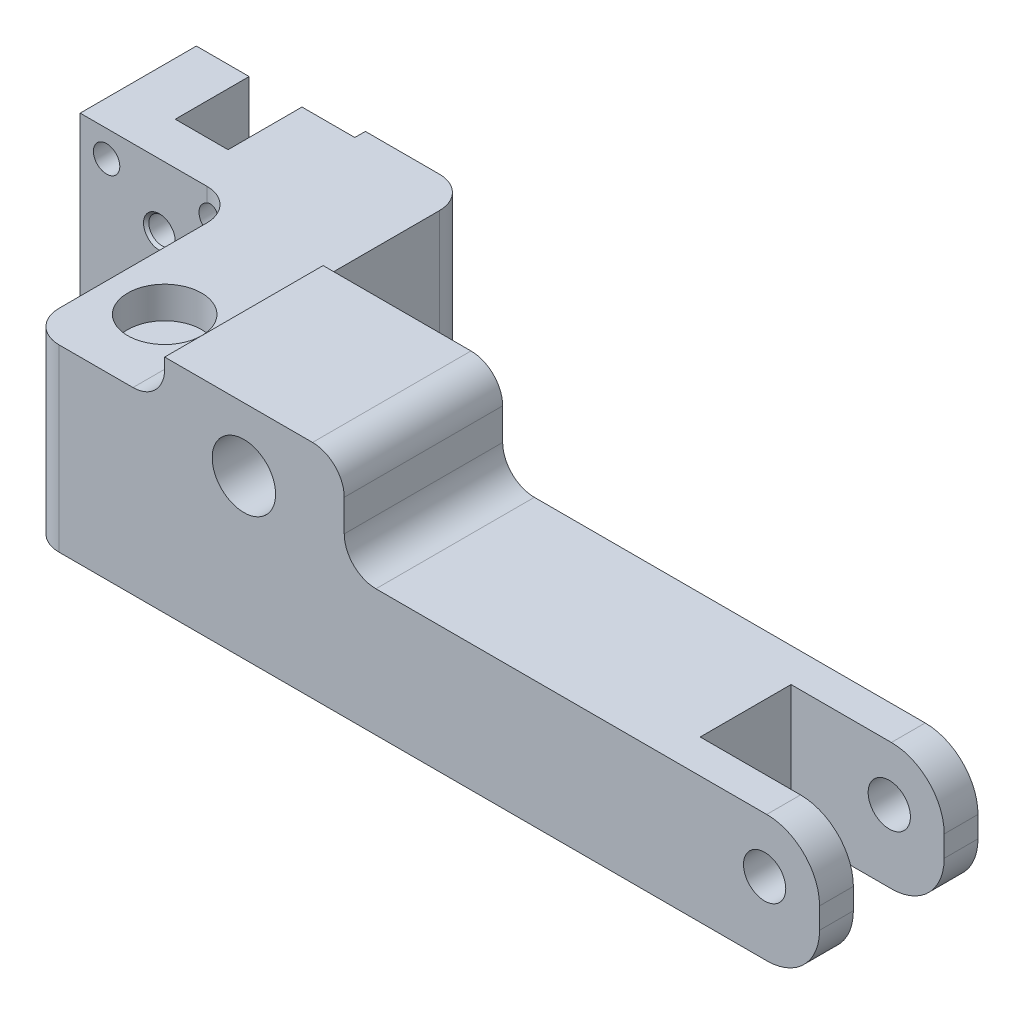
ISO-10303-21;
HEADER;
FILE_DESCRIPTION(('STEP AP214'),'2;1');
FILE_NAME('part.step','',(''),(''),'','','');
FILE_SCHEMA(('AUTOMOTIVE_DESIGN { 1 0 10303 214 1 1 1 1 }'));
ENDSEC;
DATA;
#1=APPLICATION_CONTEXT('core data for automotive mechanical design processes');
#2=APPLICATION_PROTOCOL_DEFINITION('international standard','automotive_design',2000,#1);
#3=PRODUCT_CONTEXT('',#1,'mechanical');
#4=PRODUCT('Part','Part','',(#3));
#5=PRODUCT_RELATED_PRODUCT_CATEGORY('part','',(#4));
#6=PRODUCT_DEFINITION_FORMATION('','',#4);
#7=PRODUCT_DEFINITION_CONTEXT('part definition',#1,'design');
#8=PRODUCT_DEFINITION('design','',#6,#7);
#9=PRODUCT_DEFINITION_SHAPE('','',#8);
#10=(LENGTH_UNIT() NAMED_UNIT(*) SI_UNIT(.MILLI.,.METRE.));
#11=(NAMED_UNIT(*) PLANE_ANGLE_UNIT() SI_UNIT($,.RADIAN.));
#12=(NAMED_UNIT(*) SI_UNIT($,.STERADIAN.) SOLID_ANGLE_UNIT());
#13=UNCERTAINTY_MEASURE_WITH_UNIT(LENGTH_MEASURE(1.E-05),#10,'distance_accuracy_value','');
#14=(GEOMETRIC_REPRESENTATION_CONTEXT(3) GLOBAL_UNCERTAINTY_ASSIGNED_CONTEXT((#13)) GLOBAL_UNIT_ASSIGNED_CONTEXT((#10,
#11,#12)) REPRESENTATION_CONTEXT('',''));
#15=CARTESIAN_POINT('',(0.,0.,0.));
#16=DIRECTION('',(0.,0.,1.));
#17=DIRECTION('',(1.,0.,0.));
#18=AXIS2_PLACEMENT_3D('',#15,#16,#17);
#19=CARTESIAN_POINT('',(-35.5,36.,16.));
#20=DIRECTION('',(1.,0.,0.));
#21=DIRECTION('',(0.,0.,-0.999999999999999));
#22=AXIS2_PLACEMENT_3D('',#19,#20,#21);
#23=PLANE('',#22);
#24=DIRECTION('',(0.,0.,-0.999999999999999));
#25=VECTOR('',#24,1.);
#26=CARTESIAN_POINT('',(-35.5,15.,16.));
#27=LINE('',#26,#25);
#28=CARTESIAN_POINT('',(-35.5,15.,-4.));
#29=VERTEX_POINT('',#28);
#30=CARTESIAN_POINT('',(-35.5,15.,-15.));
#31=VERTEX_POINT('',#30);
#32=EDGE_CURVE('E364',#29,#31,#27,.T.);
#33=ORIENTED_EDGE('',*,*,#32,.F.);
#34=DIRECTION('',(0.,-1.,0.));
#35=VECTOR('',#34,1.);
#36=CARTESIAN_POINT('',(-35.5,36.,-4.));
#37=LINE('',#36,#35);
#38=CARTESIAN_POINT('',(-35.5,32.,-4.));
#39=VERTEX_POINT('',#38);
#40=EDGE_CURVE('E307',#39,#29,#37,.T.);
#41=ORIENTED_EDGE('',*,*,#40,.F.);
#42=DIRECTION('',(0.,0.,0.999999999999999));
#43=VECTOR('',#42,1.);
#44=CARTESIAN_POINT('',(-35.5,32.,-16.));
#45=LINE('',#44,#43);
#46=CARTESIAN_POINT('',(-35.5,32.,-15.));
#47=VERTEX_POINT('',#46);
#48=EDGE_CURVE('E341',#47,#39,#45,.T.);
#49=ORIENTED_EDGE('',*,*,#48,.F.);
#50=DIRECTION('',(0.,-1.,0.));
#51=VECTOR('',#50,1.);
#52=CARTESIAN_POINT('',(-35.5,36.,-15.));
#53=LINE('',#52,#51);
#54=EDGE_CURVE('E619',#47,#31,#53,.T.);
#55=ORIENTED_EDGE('',*,*,#54,.T.);
#56=EDGE_LOOP('',(#33,#41,#49,#55));
#57=FACE_BOUND('',#56,.T.);
#58=CARTESIAN_POINT('',(-35.5,26.,-11.5));
#59=DIRECTION('',(1.,0.,0.));
#60=DIRECTION('',(0.,0.,0.999999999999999));
#61=AXIS2_PLACEMENT_3D('',#58,#59,#60);
#62=CIRCLE('',#61,1.5);
#63=CARTESIAN_POINT('',(-35.5,26.,-9.99999999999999));
#64=VERTEX_POINT('',#63);
#65=EDGE_CURVE('E520',#64,#64,#62,.T.);
#66=ORIENTED_EDGE('',*,*,#65,.T.);
#67=EDGE_LOOP('',(#66));
#68=FACE_BOUND('',#67,.T.);
#69=ADVANCED_FACE('F48',(#57,#68),#23,.F.);
#70=CARTESIAN_POINT('',(54.5,36.,16.));
#71=DIRECTION('',(-1.,0.,0.));
#72=DIRECTION('',(0.,0.,0.999999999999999));
#73=AXIS2_PLACEMENT_3D('',#70,#71,#72);
#74=PLANE('',#73);
#75=DIRECTION('',(0.,1.,0.));
#76=VECTOR('',#75,1.);
#77=CARTESIAN_POINT('',(54.5,-128.501022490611,12.8));
#78=LINE('',#77,#76);
#79=CARTESIAN_POINT('',(54.5,20.,12.8));
#80=VERTEX_POINT('',#79);
#81=CARTESIAN_POINT('',(54.5,22.,12.8));
#82=VERTEX_POINT('',#81);
#83=EDGE_CURVE('E632',#80,#82,#78,.T.);
#84=ORIENTED_EDGE('',*,*,#83,.T.);
#85=DIRECTION('',(0.,0.,0.999999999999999));
#86=VECTOR('',#85,1.);
#87=CARTESIAN_POINT('',(54.5,22.,16.));
#88=LINE('',#87,#86);
#89=CARTESIAN_POINT('',(54.5,22.,16.));
#90=VERTEX_POINT('',#89);
#91=EDGE_CURVE('E380',#90,#82,#88,.F.);
#92=ORIENTED_EDGE('',*,*,#91,.F.);
#93=DIRECTION('',(0.,-0.999999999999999,0.));
#94=VECTOR('',#93,1.);
#95=CARTESIAN_POINT('',(54.5,36.,16.));
#96=LINE('',#95,#94);
#97=CARTESIAN_POINT('',(54.5,20.,16.));
#98=VERTEX_POINT('',#97);
#99=EDGE_CURVE('E358',#90,#98,#96,.T.);
#100=ORIENTED_EDGE('',*,*,#99,.T.);
#101=DIRECTION('',(0.,0.,-0.999999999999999));
#102=VECTOR('',#101,1.);
#103=CARTESIAN_POINT('',(54.5,20.,16.));
#104=LINE('',#103,#102);
#105=EDGE_CURVE('E375',#80,#98,#104,.F.);
#106=ORIENTED_EDGE('',*,*,#105,.F.);
#107=EDGE_LOOP('',(#84,#92,#100,#106));
#108=FACE_BOUND('',#107,.T.);
#109=ADVANCED_FACE('F506',(#108),#74,.F.);
#110=DIRECTION('',(0.,1.,0.));
#111=VECTOR('',#110,1.);
#112=CARTESIAN_POINT('',(54.5,-128.501022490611,4.19999999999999));
#113=LINE('',#112,#111);
#114=CARTESIAN_POINT('',(54.5,20.,4.19999999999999));
#115=VERTEX_POINT('',#114);
#116=CARTESIAN_POINT('',(54.5,22.,4.19999999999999));
#117=VERTEX_POINT('',#116);
#118=EDGE_CURVE('E622',#115,#117,#113,.T.);
#119=ORIENTED_EDGE('',*,*,#118,.F.);
#120=CARTESIAN_POINT('',(54.5,20.,1.));
#121=VERTEX_POINT('',#120);
#122=EDGE_CURVE('E376',#121,#115,#104,.F.);
#123=ORIENTED_EDGE('',*,*,#122,.F.);
#124=DIRECTION('',(0.,-1.,0.));
#125=VECTOR('',#124,1.);
#126=CARTESIAN_POINT('',(54.5,36.,1.));
#127=LINE('',#126,#125);
#128=CARTESIAN_POINT('',(54.5,22.,1.));
#129=VERTEX_POINT('',#128);
#130=EDGE_CURVE('E674',#129,#121,#127,.T.);
#131=ORIENTED_EDGE('',*,*,#130,.F.);
#132=EDGE_CURVE('E379',#117,#129,#88,.F.);
#133=ORIENTED_EDGE('',*,*,#132,.F.);
#134=EDGE_LOOP('',(#119,#123,#131,#133));
#135=FACE_BOUND('',#134,.T.);
#136=ADVANCED_FACE('F511',(#135),#74,.F.);
#137=CARTESIAN_POINT('',(-35.5,15.,16.));
#138=DIRECTION('',(0.,1.,0.));
#139=DIRECTION('',(0.,0.,-0.999999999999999));
#140=AXIS2_PLACEMENT_3D('',#137,#138,#139);
#141=PLANE('',#140);
#142=CARTESIAN_POINT('',(-28.,15.,-11.5));
#143=DIRECTION('',(0.,1.,0.));
#144=DIRECTION('',(0.,0.,0.999999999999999));
#145=AXIS2_PLACEMENT_3D('',#142,#143,#144);
#146=CIRCLE('',#145,1.5);
#147=CARTESIAN_POINT('',(-28.,15.,-9.99999999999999));
#148=VERTEX_POINT('',#147);
#149=EDGE_CURVE('E534',#148,#148,#146,.T.);
#150=ORIENTED_EDGE('',*,*,#149,.T.);
#151=EDGE_LOOP('',(#150));
#152=FACE_BOUND('',#151,.T.);
#153=DIRECTION('',(-0.999999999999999,0.,0.));
#154=VECTOR('',#153,1.);
#155=CARTESIAN_POINT('',(-35.5,15.,-16.));
#156=LINE('',#155,#154);
#157=CARTESIAN_POINT('',(-13.5,15.,-16.));
#158=VERTEX_POINT('',#157);
#159=CARTESIAN_POINT('',(-20.5,15.,-16.));
#160=VERTEX_POINT('',#159);
#161=EDGE_CURVE('E344',#158,#160,#156,.T.);
#162=ORIENTED_EDGE('',*,*,#161,.F.);
#163=CARTESIAN_POINT('',(-13.5,15.,-13.));
#164=DIRECTION('',(0.,-1.,0.));
#165=DIRECTION('',(0.,0.,-0.999999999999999));
#166=AXIS2_PLACEMENT_3D('',#163,#164,#165);
#167=CIRCLE('',#166,3.);
#168=CARTESIAN_POINT('',(-10.5,15.,-13.));
#169=VERTEX_POINT('',#168);
#170=EDGE_CURVE('E401',#169,#158,#167,.F.);
#171=ORIENTED_EDGE('',*,*,#170,.F.);
#172=DIRECTION('',(0.,0.,0.999999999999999));
#173=VECTOR('',#172,1.);
#174=CARTESIAN_POINT('',(-10.5,15.,-16.));
#175=LINE('',#174,#173);
#176=CARTESIAN_POINT('',(-10.5,15.,-2.));
#177=VERTEX_POINT('',#176);
#178=EDGE_CURVE('E433',#169,#177,#175,.T.);
#179=ORIENTED_EDGE('',*,*,#178,.T.);
#180=CARTESIAN_POINT('',(-7.49999999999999,15.,-2.));
#181=DIRECTION('',(0.,1.,0.));
#182=DIRECTION('',(0.,0.,-0.999999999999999));
#183=AXIS2_PLACEMENT_3D('',#180,#181,#182);
#184=CIRCLE('',#183,3.);
#185=CARTESIAN_POINT('',(-7.49999999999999,15.,1.));
#186=VERTEX_POINT('',#185);
#187=EDGE_CURVE('E664',#177,#186,#184,.T.);
#188=ORIENTED_EDGE('',*,*,#187,.T.);
#189=DIRECTION('',(1.,0.,0.));
#190=VECTOR('',#189,1.);
#191=CARTESIAN_POINT('',(54.5,15.,1.));
#192=LINE('',#191,#190);
#193=CARTESIAN_POINT('',(49.5,15.,1.));
#194=VERTEX_POINT('',#193);
#195=EDGE_CURVE('E667',#186,#194,#192,.T.);
#196=ORIENTED_EDGE('',*,*,#195,.T.);
#197=DIRECTION('',(0.,0.,-0.999999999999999));
#198=VECTOR('',#197,1.);
#199=CARTESIAN_POINT('',(49.5,15.,16.));
#200=LINE('',#199,#198);
#201=CARTESIAN_POINT('',(49.5,15.,4.2));
#202=VERTEX_POINT('',#201);
#203=EDGE_CURVE('E383',#202,#194,#200,.T.);
#204=ORIENTED_EDGE('',*,*,#203,.F.);
#205=DIRECTION('',(-1.,0.,0.));
#206=VECTOR('',#205,1.);
#207=CARTESIAN_POINT('',(-35.5,15.,4.20000000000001));
#208=LINE('',#207,#206);
#209=CARTESIAN_POINT('',(40.,15.,4.2));
#210=VERTEX_POINT('',#209);
#211=EDGE_CURVE('E637',#202,#210,#208,.T.);
#212=ORIENTED_EDGE('',*,*,#211,.T.);
#213=DIRECTION('',(0.,0.,0.999999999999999));
#214=VECTOR('',#213,1.);
#215=CARTESIAN_POINT('',(40.,15.,16.));
#216=LINE('',#215,#214);
#217=CARTESIAN_POINT('',(40.,15.,12.8));
#218=VERTEX_POINT('',#217);
#219=EDGE_CURVE('E655',#210,#218,#216,.T.);
#220=ORIENTED_EDGE('',*,*,#219,.T.);
#221=DIRECTION('',(1.,0.,0.));
#222=VECTOR('',#221,1.);
#223=CARTESIAN_POINT('',(-35.5,15.,12.8));
#224=LINE('',#223,#222);
#225=CARTESIAN_POINT('',(49.5,15.,12.8));
#226=VERTEX_POINT('',#225);
#227=EDGE_CURVE('E647',#218,#226,#224,.T.);
#228=ORIENTED_EDGE('',*,*,#227,.T.);
#229=CARTESIAN_POINT('',(49.4999999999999,15.,16.));
#230=VERTEX_POINT('',#229);
#231=EDGE_CURVE('E384',#230,#226,#200,.T.);
#232=ORIENTED_EDGE('',*,*,#231,.F.);
#233=DIRECTION('',(-0.999999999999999,0.,0.));
#234=VECTOR('',#233,1.);
#235=CARTESIAN_POINT('',(-35.5,15.,16.));
#236=LINE('',#235,#234);
#237=CARTESIAN_POINT('',(-17.5,15.,16.));
#238=VERTEX_POINT('',#237);
#239=EDGE_CURVE('E361',#230,#238,#236,.T.);
#240=ORIENTED_EDGE('',*,*,#239,.T.);
#241=CARTESIAN_POINT('',(-17.5,15.,13.));
#242=DIRECTION('',(0.,-1.,0.));
#243=DIRECTION('',(0.,0.,-0.999999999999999));
#244=AXIS2_PLACEMENT_3D('',#241,#242,#243);
#245=CIRCLE('',#244,3.);
#246=CARTESIAN_POINT('',(-20.5,15.,13.));
#247=VERTEX_POINT('',#246);
#248=EDGE_CURVE('E398',#247,#238,#245,.F.);
#249=ORIENTED_EDGE('',*,*,#248,.F.);
#250=DIRECTION('',(0.,0.,-0.999999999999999));
#251=VECTOR('',#250,1.);
#252=CARTESIAN_POINT('',(-20.5,15.,16.));
#253=LINE('',#252,#251);
#254=CARTESIAN_POINT('',(-20.5,15.,-1.));
#255=VERTEX_POINT('',#254);
#256=EDGE_CURVE('E700',#247,#255,#253,.T.);
#257=ORIENTED_EDGE('',*,*,#256,.T.);
#258=CARTESIAN_POINT('',(-23.5,15.,-1.));
#259=DIRECTION('',(0.,1.,0.));
#260=DIRECTION('',(0.,0.,-0.999999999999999));
#261=AXIS2_PLACEMENT_3D('',#258,#259,#260);
#262=CIRCLE('',#261,3.);
#263=CARTESIAN_POINT('',(-23.5,15.,-4.));
#264=VERTEX_POINT('',#263);
#265=EDGE_CURVE('E1272',#255,#264,#262,.T.);
#266=ORIENTED_EDGE('',*,*,#265,.T.);
#267=DIRECTION('',(-1.,0.,0.));
#268=VECTOR('',#267,1.);
#269=CARTESIAN_POINT('',(-35.5,15.,-4.));
#270=LINE('',#269,#268);
#271=EDGE_CURVE('E313',#264,#29,#270,.T.);
#272=ORIENTED_EDGE('',*,*,#271,.T.);
#273=ORIENTED_EDGE('',*,*,#32,.T.);
#274=DIRECTION('',(1.,0.,0.));
#275=VECTOR('',#274,1.);
#276=CARTESIAN_POINT('',(-35.5,15.,-15.));
#277=LINE('',#276,#275);
#278=CARTESIAN_POINT('',(-20.5,15.,-15.));
#279=VERTEX_POINT('',#278);
#280=EDGE_CURVE('E598',#31,#279,#277,.T.);
#281=ORIENTED_EDGE('',*,*,#280,.T.);
#282=DIRECTION('',(0.,0.,-0.999999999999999));
#283=VECTOR('',#282,1.);
#284=CARTESIAN_POINT('',(-20.5,15.,-16.));
#285=LINE('',#284,#283);
#286=EDGE_CURVE('E616',#279,#160,#285,.T.);
#287=ORIENTED_EDGE('',*,*,#286,.T.);
#288=EDGE_LOOP('',(#162,#171,#179,#188,#196,#204,#212,#220,#228,#232,#240,#249,#257,#266,#272,
#273,#281,#287));
#289=FACE_BOUND('',#288,.T.);
#290=ADVANCED_FACE('F727',(#152,#289),#141,.F.);
#291=CARTESIAN_POINT('',(54.5,27.,-16.));
#292=DIRECTION('',(0.,-1.,0.));
#293=DIRECTION('',(-1.,0.,0.));
#294=AXIS2_PLACEMENT_3D('',#291,#292,#293);
#295=PLANE('',#294);
#296=DIRECTION('',(-1.,0.,0.));
#297=VECTOR('',#296,1.);
#298=CARTESIAN_POINT('',(54.5,27.,12.8));
#299=LINE('',#298,#297);
#300=CARTESIAN_POINT('',(49.5,27.,12.8));
#301=VERTEX_POINT('',#300);
#302=CARTESIAN_POINT('',(40.,27.,12.8));
#303=VERTEX_POINT('',#302);
#304=EDGE_CURVE('E652',#301,#303,#299,.T.);
#305=ORIENTED_EDGE('',*,*,#304,.T.);
#306=DIRECTION('',(0.,0.,-0.999999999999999));
#307=VECTOR('',#306,1.);
#308=CARTESIAN_POINT('',(40.,27.,-16.));
#309=LINE('',#308,#307);
#310=CARTESIAN_POINT('',(40.,27.,4.2));
#311=VERTEX_POINT('',#310);
#312=EDGE_CURVE('E444',#303,#311,#309,.T.);
#313=ORIENTED_EDGE('',*,*,#312,.T.);
#314=DIRECTION('',(1.,0.,0.));
#315=VECTOR('',#314,1.);
#316=CARTESIAN_POINT('',(54.5,27.,4.19999999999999));
#317=LINE('',#316,#315);
#318=CARTESIAN_POINT('',(49.5,27.,4.19999999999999));
#319=VERTEX_POINT('',#318);
#320=EDGE_CURVE('E642',#311,#319,#317,.T.);
#321=ORIENTED_EDGE('',*,*,#320,.T.);
#322=DIRECTION('',(0.,0.,0.999999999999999));
#323=VECTOR('',#322,1.);
#324=CARTESIAN_POINT('',(49.5,27.,-16.));
#325=LINE('',#324,#323);
#326=CARTESIAN_POINT('',(49.5,27.,1.));
#327=VERTEX_POINT('',#326);
#328=EDGE_CURVE('E368',#327,#319,#325,.T.);
#329=ORIENTED_EDGE('',*,*,#328,.F.);
#330=DIRECTION('',(1.,0.,0.));
#331=VECTOR('',#330,1.);
#332=CARTESIAN_POINT('',(54.5,27.,1.));
#333=LINE('',#332,#331);
#334=CARTESIAN_POINT('',(12.5,27.,1.));
#335=VERTEX_POINT('',#334);
#336=EDGE_CURVE('E684',#335,#327,#333,.T.);
#337=ORIENTED_EDGE('',*,*,#336,.F.);
#338=DIRECTION('',(0.,0.,0.999999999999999));
#339=VECTOR('',#338,1.);
#340=CARTESIAN_POINT('',(12.5,27.,-16.));
#341=LINE('',#340,#339);
#342=CARTESIAN_POINT('',(12.5,27.,16.));
#343=VERTEX_POINT('',#342);
#344=EDGE_CURVE('E323',#335,#343,#341,.T.);
#345=ORIENTED_EDGE('',*,*,#344,.T.);
#346=DIRECTION('',(-1.,0.,0.));
#347=VECTOR('',#346,1.);
#348=CARTESIAN_POINT('',(54.5,27.,16.));
#349=LINE('',#348,#347);
#350=CARTESIAN_POINT('',(49.5,27.,16.));
#351=VERTEX_POINT('',#350);
#352=EDGE_CURVE('E314',#351,#343,#349,.T.);
#353=ORIENTED_EDGE('',*,*,#352,.F.);
#354=EDGE_CURVE('E367',#301,#351,#325,.T.);
#355=ORIENTED_EDGE('',*,*,#354,.F.);
#356=EDGE_LOOP('',(#305,#313,#321,#329,#337,#345,#353,#355));
#357=FACE_BOUND('',#356,.T.);
#358=ADVANCED_FACE('F729',(#357),#295,.F.);
#359=CARTESIAN_POINT('',(49.5,22.,-16.));
#360=DIRECTION('',(0.,0.,0.999999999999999));
#361=DIRECTION('',(1.,0.,0.));
#362=AXIS2_PLACEMENT_3D('',#359,#360,#361);
#363=CYLINDRICAL_SURFACE('',#362,5.);
#364=ORIENTED_EDGE('',*,*,#354,.T.);
#365=CARTESIAN_POINT('',(49.5,22.,16.));
#366=DIRECTION('',(0.,0.,0.999999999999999));
#367=DIRECTION('',(-1.,0.,0.));
#368=AXIS2_PLACEMENT_3D('',#365,#366,#367);
#369=CIRCLE('',#368,5.);
#370=EDGE_CURVE('E373',#351,#90,#369,.F.);
#371=ORIENTED_EDGE('',*,*,#370,.T.);
#372=ORIENTED_EDGE('',*,*,#91,.T.);
#373=CARTESIAN_POINT('',(49.5,22.,12.8));
#374=DIRECTION('',(0.,0.,0.999999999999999));
#375=DIRECTION('',(-1.,0.,0.));
#376=AXIS2_PLACEMENT_3D('',#373,#374,#375);
#377=CIRCLE('',#376,5.);
#378=EDGE_CURVE('E650',#301,#82,#377,.F.);
#379=ORIENTED_EDGE('',*,*,#378,.F.);
#380=EDGE_LOOP('',(#364,#371,#372,#379));
#381=FACE_BOUND('',#380,.T.);
#382=ADVANCED_FACE('F806',(#381),#363,.T.);
#383=ORIENTED_EDGE('',*,*,#132,.T.);
#384=CARTESIAN_POINT('',(49.5,22.,1.));
#385=DIRECTION('',(0.,0.,-0.999999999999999));
#386=DIRECTION('',(1.,0.,0.));
#387=AXIS2_PLACEMENT_3D('',#384,#385,#386);
#388=CIRCLE('',#387,5.);
#389=EDGE_CURVE('E677',#129,#327,#388,.F.);
#390=ORIENTED_EDGE('',*,*,#389,.T.);
#391=ORIENTED_EDGE('',*,*,#328,.T.);
#392=CARTESIAN_POINT('',(49.5,22.,4.19999999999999));
#393=DIRECTION('',(0.,0.,-0.999999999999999));
#394=DIRECTION('',(1.,0.,0.));
#395=AXIS2_PLACEMENT_3D('',#392,#393,#394);
#396=CIRCLE('',#395,5.);
#397=EDGE_CURVE('E640',#117,#319,#396,.F.);
#398=ORIENTED_EDGE('',*,*,#397,.F.);
#399=EDGE_LOOP('',(#383,#390,#391,#398));
#400=FACE_BOUND('',#399,.T.);
#401=ADVANCED_FACE('F766',(#400),#363,.T.);
#402=CARTESIAN_POINT('',(49.5,20.,16.));
#403=DIRECTION('',(0.,0.,-0.999999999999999));
#404=DIRECTION('',(-1.,0.,0.));
#405=AXIS2_PLACEMENT_3D('',#402,#403,#404);
#406=CYLINDRICAL_SURFACE('',#405,5.);
#407=ORIENTED_EDGE('',*,*,#105,.T.);
#408=CARTESIAN_POINT('',(49.5,20.,16.));
#409=DIRECTION('',(0.,0.,0.999999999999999));
#410=DIRECTION('',(-1.,0.,0.));
#411=AXIS2_PLACEMENT_3D('',#408,#409,#410);
#412=CIRCLE('',#411,5.);
#413=EDGE_CURVE('E371',#98,#230,#412,.F.);
#414=ORIENTED_EDGE('',*,*,#413,.T.);
#415=ORIENTED_EDGE('',*,*,#231,.T.);
#416=CARTESIAN_POINT('',(49.5,20.,12.8));
#417=DIRECTION('',(0.,0.,0.999999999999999));
#418=DIRECTION('',(-1.,0.,0.));
#419=AXIS2_PLACEMENT_3D('',#416,#417,#418);
#420=CIRCLE('',#419,5.);
#421=EDGE_CURVE('E645',#80,#226,#420,.F.);
#422=ORIENTED_EDGE('',*,*,#421,.F.);
#423=EDGE_LOOP('',(#407,#414,#415,#422));
#424=FACE_BOUND('',#423,.T.);
#425=ADVANCED_FACE('F802',(#424),#406,.T.);
#426=ORIENTED_EDGE('',*,*,#203,.T.);
#427=CARTESIAN_POINT('',(49.5,20.,1.));
#428=DIRECTION('',(0.,0.,-0.999999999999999));
#429=DIRECTION('',(1.,0.,0.));
#430=AXIS2_PLACEMENT_3D('',#427,#428,#429);
#431=CIRCLE('',#430,5.);
#432=EDGE_CURVE('E394',#194,#121,#431,.F.);
#433=ORIENTED_EDGE('',*,*,#432,.T.);
#434=ORIENTED_EDGE('',*,*,#122,.T.);
#435=CARTESIAN_POINT('',(49.5,20.,4.2));
#436=DIRECTION('',(0.,0.,-0.999999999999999));
#437=DIRECTION('',(1.,0.,0.));
#438=AXIS2_PLACEMENT_3D('',#435,#436,#437);
#439=CIRCLE('',#438,5.);
#440=EDGE_CURVE('E635',#202,#115,#439,.F.);
#441=ORIENTED_EDGE('',*,*,#440,.F.);
#442=EDGE_LOOP('',(#426,#433,#434,#441));
#443=FACE_BOUND('',#442,.T.);
#444=ADVANCED_FACE('F774',(#443),#406,.T.);
#445=CARTESIAN_POINT('',(49.3,21.8,-16.));
#446=DIRECTION('',(0.,0.,0.999999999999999));
#447=DIRECTION('',(1.,0.,0.));
#448=AXIS2_PLACEMENT_3D('',#445,#446,#447);
#449=CYLINDRICAL_SURFACE('',#448,2.);
#450=CARTESIAN_POINT('',(49.3,21.8,16.));
#451=DIRECTION('',(0.,0.,-0.999999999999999));
#452=DIRECTION('',(1.,0.,0.));
#453=AXIS2_PLACEMENT_3D('',#450,#451,#452);
#454=CIRCLE('',#453,2.);
#455=CARTESIAN_POINT('',(51.3,21.8,16.));
#456=VERTEX_POINT('',#455);
#457=EDGE_CURVE('E438',#456,#456,#454,.T.);
#458=CARTESIAN_POINT('',(49.3,21.8,12.8));
#459=DIRECTION('',(0.,0.,0.999999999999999));
#460=DIRECTION('',(-1.,0.,0.));
#461=AXIS2_PLACEMENT_3D('',#458,#459,#460);
#462=CIRCLE('',#461,2.);
#463=CARTESIAN_POINT('',(51.3,21.8,12.8));
#464=VERTEX_POINT('',#463);
#465=EDGE_CURVE('E441',#464,#464,#462,.F.);
#466=CARTESIAN_POINT('',(51.3,21.8,16.));
#467=CARTESIAN_POINT('',(51.3,21.8,15.9666666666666));
#468=CARTESIAN_POINT('',(51.3,21.8,15.9333333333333));
#469=CARTESIAN_POINT('',(51.3,21.8,15.8666666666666));
#470=CARTESIAN_POINT('',(51.3,21.8,15.8333333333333));
#471=CARTESIAN_POINT('',(51.3,21.8,15.7666666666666));
#472=CARTESIAN_POINT('',(51.3,21.8,15.7333333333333));
#473=CARTESIAN_POINT('',(51.3,21.8,15.6666666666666));
#474=CARTESIAN_POINT('',(51.3,21.8,15.6333333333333));
#475=CARTESIAN_POINT('',(51.3,21.8,15.5666666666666));
#476=CARTESIAN_POINT('',(51.3,21.8,15.5333333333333));
#477=CARTESIAN_POINT('',(51.3,21.8,15.4666666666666));
#478=CARTESIAN_POINT('',(51.3,21.8,15.4333333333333));
#479=CARTESIAN_POINT('',(51.3,21.8,15.3666666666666));
#480=CARTESIAN_POINT('',(51.3,21.8,15.3333333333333));
#481=CARTESIAN_POINT('',(51.3,21.8,15.2666666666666));
#482=CARTESIAN_POINT('',(51.3,21.8,15.2333333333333));
#483=CARTESIAN_POINT('',(51.3,21.8,15.1666666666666));
#484=CARTESIAN_POINT('',(51.3,21.8,15.1333333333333));
#485=CARTESIAN_POINT('',(51.3,21.8,15.0666666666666));
#486=CARTESIAN_POINT('',(51.3,21.8,15.0333333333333));
#487=CARTESIAN_POINT('',(51.3,21.8,14.9666666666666));
#488=CARTESIAN_POINT('',(51.3,21.8,14.9333333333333));
#489=CARTESIAN_POINT('',(51.3,21.8,14.8666666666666));
#490=CARTESIAN_POINT('',(51.3,21.8,14.8333333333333));
#491=CARTESIAN_POINT('',(51.3,21.8,14.7666666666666));
#492=CARTESIAN_POINT('',(51.3,21.8,14.7333333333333));
#493=CARTESIAN_POINT('',(51.3,21.8,14.6666666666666));
#494=CARTESIAN_POINT('',(51.3,21.8,14.6333333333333));
#495=CARTESIAN_POINT('',(51.3,21.8,14.5666666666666));
#496=CARTESIAN_POINT('',(51.3,21.8,14.5333333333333));
#497=CARTESIAN_POINT('',(51.3,21.8,14.4666666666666));
#498=CARTESIAN_POINT('',(51.3,21.8,14.4333333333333));
#499=CARTESIAN_POINT('',(51.3,21.8,14.3666666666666));
#500=CARTESIAN_POINT('',(51.3,21.8,14.3333333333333));
#501=CARTESIAN_POINT('',(51.3,21.8,14.2666666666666));
#502=CARTESIAN_POINT('',(51.3,21.8,14.2333333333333));
#503=CARTESIAN_POINT('',(51.3,21.8,14.1666666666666));
#504=CARTESIAN_POINT('',(51.3,21.8,14.1333333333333));
#505=CARTESIAN_POINT('',(51.3,21.8,14.0666666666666));
#506=CARTESIAN_POINT('',(51.3,21.8,14.0333333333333));
#507=CARTESIAN_POINT('',(51.3,21.8,13.9666666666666));
#508=CARTESIAN_POINT('',(51.3,21.8,13.9333333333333));
#509=CARTESIAN_POINT('',(51.3,21.8,13.8666666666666));
#510=CARTESIAN_POINT('',(51.3,21.8,13.8333333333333));
#511=CARTESIAN_POINT('',(51.3,21.8,13.7666666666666));
#512=CARTESIAN_POINT('',(51.3,21.8,13.7333333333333));
#513=CARTESIAN_POINT('',(51.3,21.8,13.6666666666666));
#514=CARTESIAN_POINT('',(51.3,21.8,13.6333333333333));
#515=CARTESIAN_POINT('',(51.3,21.8,13.5666666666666));
#516=CARTESIAN_POINT('',(51.3,21.8,13.5333333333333));
#517=CARTESIAN_POINT('',(51.3,21.8,13.4666666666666));
#518=CARTESIAN_POINT('',(51.3,21.8,13.4333333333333));
#519=CARTESIAN_POINT('',(51.3,21.8,13.3666666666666));
#520=CARTESIAN_POINT('',(51.3,21.8,13.3333333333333));
#521=CARTESIAN_POINT('',(51.3,21.8,13.2666666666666));
#522=CARTESIAN_POINT('',(51.3,21.8,13.2333333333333));
#523=CARTESIAN_POINT('',(51.3,21.8,13.1666666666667));
#524=CARTESIAN_POINT('',(51.3,21.8,13.1333333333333));
#525=CARTESIAN_POINT('',(51.3,21.8,13.0666666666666));
#526=CARTESIAN_POINT('',(51.3,21.8,13.0333333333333));
#527=CARTESIAN_POINT('',(51.3,21.8,12.9666666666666));
#528=CARTESIAN_POINT('',(51.3,21.8,12.9333333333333));
#529=CARTESIAN_POINT('',(51.3,21.8,12.8666666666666));
#530=CARTESIAN_POINT('',(51.3,21.8,12.8333333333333));
#531=CARTESIAN_POINT('',(51.3,21.8,12.8));
#532=B_SPLINE_CURVE_WITH_KNOTS('',3,(#466,#467,#468,#469,#470,#471,#472,#473,#474,#475,#476,
#477,#478,#479,#480,#481,#482,#483,#484,#485,#486,#487,#488,#489,#490,#491,#492,#493,#494,#495,
#496,#497,#498,#499,#500,#501,#502,#503,#504,#505,#506,#507,#508,#509,#510,#511,#512,#513,#514,
#515,#516,#517,#518,#519,#520,#521,#522,#523,#524,#525,#526,#527,#528,#529,#530,#531),
.UNSPECIFIED.,.F.,.F.,(4,2,2,2,2,2,2,2,2,2,2,2,2,2,2,2,2,2,2,2,2,2,2,2,2,2,2,2,2,2,2,2,4),(0.,
0.100000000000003,0.199999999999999,0.300000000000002,0.399999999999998,0.5,0.600000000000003,
0.699999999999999,0.800000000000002,0.900000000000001,1.,1.1,1.2,1.3,1.4,1.5,1.6,1.7,1.8,1.9,2.,
2.1,2.2,2.3,2.4,2.5,2.6,2.7,2.8,2.9,3.,3.1,3.2),.UNSPECIFIED.);
#533=EDGE_CURVE('BSEAM737',#456,#464,#532,.T.);
#534=ORIENTED_EDGE('',*,*,#457,.F.);
#535=ORIENTED_EDGE('',*,*,#465,.T.);
#536=ORIENTED_EDGE('',*,*,#533,.T.);
#537=ORIENTED_EDGE('',*,*,#533,.F.);
#538=EDGE_LOOP('',(#534,#536,#535,#537));
#539=FACE_BOUND('',#538,.T.);
#540=ADVANCED_FACE('F737',(#539),#449,.F.);
#541=CARTESIAN_POINT('',(49.3,21.8,1.));
#542=DIRECTION('',(0.,0.,-0.999999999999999));
#543=DIRECTION('',(1.,0.,0.));
#544=AXIS2_PLACEMENT_3D('',#541,#542,#543);
#545=CIRCLE('',#544,2.);
#546=CARTESIAN_POINT('',(51.3,21.8,1.));
#547=VERTEX_POINT('',#546);
#548=EDGE_CURVE('E435',#547,#547,#545,.T.);
#549=CARTESIAN_POINT('',(49.3,21.8,4.19999999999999));
#550=DIRECTION('',(0.,0.,-0.999999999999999));
#551=DIRECTION('',(1.,0.,0.));
#552=AXIS2_PLACEMENT_3D('',#549,#550,#551);
#553=CIRCLE('',#552,2.);
#554=CARTESIAN_POINT('',(51.3,21.8,4.19999999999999));
#555=VERTEX_POINT('',#554);
#556=EDGE_CURVE('E429',#555,#555,#553,.F.);
#557=CARTESIAN_POINT('',(51.3,21.8,1.));
#558=CARTESIAN_POINT('',(51.3,21.8,1.03333333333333));
#559=CARTESIAN_POINT('',(51.3,21.8,1.06666666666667));
#560=CARTESIAN_POINT('',(51.3,21.8,1.13333333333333));
#561=CARTESIAN_POINT('',(51.3,21.8,1.16666666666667));
#562=CARTESIAN_POINT('',(51.3,21.8,1.23333333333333));
#563=CARTESIAN_POINT('',(51.3,21.8,1.26666666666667));
#564=CARTESIAN_POINT('',(51.3,21.8,1.33333333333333));
#565=CARTESIAN_POINT('',(51.3,21.8,1.36666666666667));
#566=CARTESIAN_POINT('',(51.3,21.8,1.43333333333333));
#567=CARTESIAN_POINT('',(51.3,21.8,1.46666666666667));
#568=CARTESIAN_POINT('',(51.3,21.8,1.53333333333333));
#569=CARTESIAN_POINT('',(51.3,21.8,1.56666666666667));
#570=CARTESIAN_POINT('',(51.3,21.8,1.63333333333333));
#571=CARTESIAN_POINT('',(51.3,21.8,1.66666666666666));
#572=CARTESIAN_POINT('',(51.3,21.8,1.73333333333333));
#573=CARTESIAN_POINT('',(51.3,21.8,1.76666666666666));
#574=CARTESIAN_POINT('',(51.3,21.8,1.83333333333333));
#575=CARTESIAN_POINT('',(51.3,21.8,1.86666666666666));
#576=CARTESIAN_POINT('',(51.3,21.8,1.93333333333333));
#577=CARTESIAN_POINT('',(51.3,21.8,1.96666666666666));
#578=CARTESIAN_POINT('',(51.3,21.8,2.03333333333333));
#579=CARTESIAN_POINT('',(51.3,21.8,2.06666666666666));
#580=CARTESIAN_POINT('',(51.3,21.8,2.13333333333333));
#581=CARTESIAN_POINT('',(51.3,21.8,2.16666666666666));
#582=CARTESIAN_POINT('',(51.3,21.8,2.23333333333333));
#583=CARTESIAN_POINT('',(51.3,21.8,2.26666666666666));
#584=CARTESIAN_POINT('',(51.3,21.8,2.33333333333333));
#585=CARTESIAN_POINT('',(51.3,21.8,2.36666666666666));
#586=CARTESIAN_POINT('',(51.3,21.8,2.43333333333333));
#587=CARTESIAN_POINT('',(51.3,21.8,2.46666666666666));
#588=CARTESIAN_POINT('',(51.3,21.8,2.53333333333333));
#589=CARTESIAN_POINT('',(51.3,21.8,2.56666666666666));
#590=CARTESIAN_POINT('',(51.3,21.8,2.63333333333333));
#591=CARTESIAN_POINT('',(51.3,21.8,2.66666666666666));
#592=CARTESIAN_POINT('',(51.3,21.8,2.73333333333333));
#593=CARTESIAN_POINT('',(51.3,21.8,2.76666666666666));
#594=CARTESIAN_POINT('',(51.3,21.8,2.83333333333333));
#595=CARTESIAN_POINT('',(51.3,21.8,2.86666666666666));
#596=CARTESIAN_POINT('',(51.3,21.8,2.93333333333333));
#597=CARTESIAN_POINT('',(51.3,21.8,2.96666666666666));
#598=CARTESIAN_POINT('',(51.3,21.8,3.03333333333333));
#599=CARTESIAN_POINT('',(51.3,21.8,3.06666666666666));
#600=CARTESIAN_POINT('',(51.3,21.8,3.13333333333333));
#601=CARTESIAN_POINT('',(51.3,21.8,3.16666666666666));
#602=CARTESIAN_POINT('',(51.3,21.8,3.23333333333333));
#603=CARTESIAN_POINT('',(51.3,21.8,3.26666666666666));
#604=CARTESIAN_POINT('',(51.3,21.8,3.33333333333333));
#605=CARTESIAN_POINT('',(51.3,21.8,3.36666666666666));
#606=CARTESIAN_POINT('',(51.3,21.8,3.43333333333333));
#607=CARTESIAN_POINT('',(51.3,21.8,3.46666666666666));
#608=CARTESIAN_POINT('',(51.3,21.8,3.53333333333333));
#609=CARTESIAN_POINT('',(51.3,21.8,3.56666666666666));
#610=CARTESIAN_POINT('',(51.3,21.8,3.63333333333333));
#611=CARTESIAN_POINT('',(51.3,21.8,3.66666666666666));
#612=CARTESIAN_POINT('',(51.3,21.8,3.73333333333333));
#613=CARTESIAN_POINT('',(51.3,21.8,3.76666666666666));
#614=CARTESIAN_POINT('',(51.3,21.8,3.83333333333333));
#615=CARTESIAN_POINT('',(51.3,21.8,3.86666666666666));
#616=CARTESIAN_POINT('',(51.3,21.8,3.93333333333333));
#617=CARTESIAN_POINT('',(51.3,21.8,3.96666666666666));
#618=CARTESIAN_POINT('',(51.3,21.8,4.03333333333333));
#619=CARTESIAN_POINT('',(51.3,21.8,4.06666666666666));
#620=CARTESIAN_POINT('',(51.3,21.8,4.13333333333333));
#621=CARTESIAN_POINT('',(51.3,21.8,4.16666666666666));
#622=CARTESIAN_POINT('',(51.3,21.8,4.19999999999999));
#623=B_SPLINE_CURVE_WITH_KNOTS('',3,(#557,#558,#559,#560,#561,#562,#563,#564,#565,#566,#567,
#568,#569,#570,#571,#572,#573,#574,#575,#576,#577,#578,#579,#580,#581,#582,#583,#584,#585,#586,
#587,#588,#589,#590,#591,#592,#593,#594,#595,#596,#597,#598,#599,#600,#601,#602,#603,#604,#605,
#606,#607,#608,#609,#610,#611,#612,#613,#614,#615,#616,#617,#618,#619,#620,#621,#622),
.UNSPECIFIED.,.F.,.F.,(4,2,2,2,2,2,2,2,2,2,2,2,2,2,2,2,2,2,2,2,2,2,2,2,2,2,2,2,2,2,2,2,4),(0.,
0.0999999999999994,0.199999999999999,0.299999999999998,0.399999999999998,0.5,0.599999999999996,
0.699999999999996,0.799999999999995,0.899999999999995,0.999999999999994,1.09999999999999,1.2,
1.3,1.4,1.49999999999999,1.59999999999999,1.69999999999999,1.79999999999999,1.89999999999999,
1.99999999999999,2.09999999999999,2.19999999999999,2.29999999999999,2.39999999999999,
2.49999999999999,2.59999999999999,2.69999999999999,2.79999999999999,2.89999999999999,
2.99999999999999,3.09999999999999,3.19999999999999),.UNSPECIFIED.);
#624=EDGE_CURVE('BSEAM732',#547,#555,#623,.T.);
#625=ORIENTED_EDGE('',*,*,#548,.T.);
#626=ORIENTED_EDGE('',*,*,#556,.T.);
#627=ORIENTED_EDGE('',*,*,#624,.T.);
#628=ORIENTED_EDGE('',*,*,#624,.F.);
#629=EDGE_LOOP('',(#625,#627,#626,#628));
#630=FACE_BOUND('',#629,.T.);
#631=ADVANCED_FACE('F732',(#630),#449,.F.);
#632=CARTESIAN_POINT('',(-35.5,36.,16.));
#633=DIRECTION('',(0.,-1.,0.));
#634=DIRECTION('',(0.,0.,0.999999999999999));
#635=AXIS2_PLACEMENT_3D('',#632,#633,#634);
#636=PLANE('',#635);
#637=DIRECTION('',(1.,0.,0.));
#638=VECTOR('',#637,1.);
#639=CARTESIAN_POINT('',(54.5,36.,1.));
#640=LINE('',#639,#638);
#641=CARTESIAN_POINT('',(-7.49999999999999,36.,1.));
#642=VERTEX_POINT('',#641);
#643=CARTESIAN_POINT('',(6.49999999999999,36.,1.));
#644=VERTEX_POINT('',#643);
#645=EDGE_CURVE('E670',#642,#644,#640,.T.);
#646=ORIENTED_EDGE('',*,*,#645,.F.);
#647=DIRECTION('',(0.,0.,0.999999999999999));
#648=VECTOR('',#647,1.);
#649=CARTESIAN_POINT('',(-7.49999999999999,36.,-16.));
#650=LINE('',#649,#648);
#651=CARTESIAN_POINT('',(-7.49999999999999,36.,16.));
#652=VERTEX_POINT('',#651);
#653=EDGE_CURVE('E340',#642,#652,#650,.T.);
#654=ORIENTED_EDGE('',*,*,#653,.T.);
#655=DIRECTION('',(0.999999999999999,0.,0.));
#656=VECTOR('',#655,1.);
#657=CARTESIAN_POINT('',(-35.5,36.,16.));
#658=LINE('',#657,#656);
#659=CARTESIAN_POINT('',(6.49999999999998,36.,16.));
#660=VERTEX_POINT('',#659);
#661=EDGE_CURVE('E355',#652,#660,#658,.T.);
#662=ORIENTED_EDGE('',*,*,#661,.T.);
#663=DIRECTION('',(0.,0.,0.999999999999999));
#664=VECTOR('',#663,1.);
#665=CARTESIAN_POINT('',(6.49999999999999,36.,16.));
#666=LINE('',#665,#664);
#667=EDGE_CURVE('E418',#644,#660,#666,.T.);
#668=ORIENTED_EDGE('',*,*,#667,.F.);
#669=EDGE_LOOP('',(#646,#654,#662,#668));
#670=FACE_BOUND('',#669,.T.);
#671=ADVANCED_FACE('F725',(#670),#636,.F.);
#672=CARTESIAN_POINT('',(-35.5,15.,16.));
#673=DIRECTION('',(0.,0.,-0.999999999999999));
#674=DIRECTION('',(-1.,0.,0.));
#675=AXIS2_PLACEMENT_3D('',#672,#673,#674);
#676=PLANE('',#675);
#677=ORIENTED_EDGE('',*,*,#457,.T.);
#678=EDGE_LOOP('',(#677));
#679=FACE_BOUND('',#678,.T.);
#680=CARTESIAN_POINT('',(0.,30.,16.));
#681=DIRECTION('',(0.,0.,-0.999999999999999));
#682=DIRECTION('',(1.,0.,0.));
#683=AXIS2_PLACEMENT_3D('',#680,#681,#682);
#684=CIRCLE('',#683,3.);
#685=CARTESIAN_POINT('',(3.,30.,16.));
#686=VERTEX_POINT('',#685);
#687=EDGE_CURVE('E434',#686,#686,#684,.T.);
#688=ORIENTED_EDGE('',*,*,#687,.T.);
#689=EDGE_LOOP('',(#688));
#690=FACE_BOUND('',#689,.T.);
#691=ORIENTED_EDGE('',*,*,#661,.F.);
#692=DIRECTION('',(0.,-1.,0.));
#693=VECTOR('',#692,1.);
#694=CARTESIAN_POINT('',(-7.49999999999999,36.,16.));
#695=LINE('',#694,#693);
#696=CARTESIAN_POINT('',(-7.49999999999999,35.,16.));
#697=VERTEX_POINT('',#696);
#698=EDGE_CURVE('E326',#652,#697,#695,.T.);
#699=ORIENTED_EDGE('',*,*,#698,.T.);
#700=CARTESIAN_POINT('',(-10.5,35.,16.));
#701=DIRECTION('',(0.,0.,-0.999999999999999));
#702=DIRECTION('',(-1.,0.,0.));
#703=AXIS2_PLACEMENT_3D('',#700,#701,#702);
#704=CIRCLE('',#703,3.);
#705=CARTESIAN_POINT('',(-10.5,32.,16.));
#706=VERTEX_POINT('',#705);
#707=EDGE_CURVE('E331',#697,#706,#704,.T.);
#708=ORIENTED_EDGE('',*,*,#707,.T.);
#709=DIRECTION('',(-1.,0.,0.));
#710=VECTOR('',#709,1.);
#711=CARTESIAN_POINT('',(-35.5,32.,16.));
#712=LINE('',#711,#710);
#713=CARTESIAN_POINT('',(-17.5,32.,16.));
#714=VERTEX_POINT('',#713);
#715=EDGE_CURVE('E334',#706,#714,#712,.T.);
#716=ORIENTED_EDGE('',*,*,#715,.T.);
#717=DIRECTION('',(0.,-1.,0.));
#718=VECTOR('',#717,1.);
#719=CARTESIAN_POINT('',(-17.5,15.,16.));
#720=LINE('',#719,#718);
#721=EDGE_CURVE('E415',#238,#714,#720,.F.);
#722=ORIENTED_EDGE('',*,*,#721,.F.);
#723=ORIENTED_EDGE('',*,*,#239,.F.);
#724=ORIENTED_EDGE('',*,*,#413,.F.);
#725=ORIENTED_EDGE('',*,*,#99,.F.);
#726=ORIENTED_EDGE('',*,*,#370,.F.);
#727=ORIENTED_EDGE('',*,*,#352,.T.);
#728=CARTESIAN_POINT('',(12.5,30.,16.));
#729=DIRECTION('',(0.,0.,-0.999999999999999));
#730=DIRECTION('',(1.,0.,0.));
#731=AXIS2_PLACEMENT_3D('',#728,#729,#730);
#732=CIRCLE('',#731,3.);
#733=CARTESIAN_POINT('',(9.49999999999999,30.,16.));
#734=VERTEX_POINT('',#733);
#735=EDGE_CURVE('E317',#343,#734,#732,.T.);
#736=ORIENTED_EDGE('',*,*,#735,.T.);
#737=DIRECTION('',(0.,1.,0.));
#738=VECTOR('',#737,1.);
#739=CARTESIAN_POINT('',(9.49999999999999,36.,16.));
#740=LINE('',#739,#738);
#741=CARTESIAN_POINT('',(9.49999999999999,33.,16.));
#742=VERTEX_POINT('',#741);
#743=EDGE_CURVE('E320',#734,#742,#740,.T.);
#744=ORIENTED_EDGE('',*,*,#743,.T.);
#745=CARTESIAN_POINT('',(6.49999999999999,33.,16.));
#746=DIRECTION('',(0.,0.,0.999999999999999));
#747=DIRECTION('',(-1.,0.,0.));
#748=AXIS2_PLACEMENT_3D('',#745,#746,#747);
#749=CIRCLE('',#748,3.);
#750=EDGE_CURVE('E421',#660,#742,#749,.F.);
#751=ORIENTED_EDGE('',*,*,#750,.F.);
#752=EDGE_LOOP('',(#691,#699,#708,#716,#722,#723,#724,#725,#726,#727,#736,#744,#751));
#753=FACE_BOUND('',#752,.T.);
#754=ADVANCED_FACE('F721',(#679,#690,#753),#676,.F.);
#755=CARTESIAN_POINT('',(-35.5,15.,-16.));
#756=DIRECTION('',(0.,0.,-0.999999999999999));
#757=DIRECTION('',(-1.,0.,0.));
#758=AXIS2_PLACEMENT_3D('',#755,#756,#757);
#759=PLANE('',#758);
#760=DIRECTION('',(0.,-1.,0.));
#761=VECTOR('',#760,1.);
#762=CARTESIAN_POINT('',(-20.5,36.,-16.));
#763=LINE('',#762,#761);
#764=CARTESIAN_POINT('',(-20.5,32.,-16.));
#765=VERTEX_POINT('',#764);
#766=EDGE_CURVE('E620',#765,#160,#763,.T.);
#767=ORIENTED_EDGE('',*,*,#766,.F.);
#768=DIRECTION('',(-1.,0.,0.));
#769=VECTOR('',#768,1.);
#770=CARTESIAN_POINT('',(-35.5,32.,-16.));
#771=LINE('',#770,#769);
#772=CARTESIAN_POINT('',(-13.5,32.,-16.));
#773=VERTEX_POINT('',#772);
#774=EDGE_CURVE('E337',#773,#765,#771,.T.);
#775=ORIENTED_EDGE('',*,*,#774,.F.);
#776=DIRECTION('',(0.,-1.,0.));
#777=VECTOR('',#776,1.);
#778=CARTESIAN_POINT('',(-13.5,32.,-16.));
#779=LINE('',#778,#777);
#780=EDGE_CURVE('E404',#158,#773,#779,.F.);
#781=ORIENTED_EDGE('',*,*,#780,.F.);
#782=ORIENTED_EDGE('',*,*,#161,.T.);
#783=EDGE_LOOP('',(#767,#775,#781,#782));
#784=FACE_BOUND('',#783,.T.);
#785=ADVANCED_FACE('F718',(#784),#759,.T.);
#786=CARTESIAN_POINT('',(-35.5,32.,-16.));
#787=DIRECTION('',(0.,-1.,0.));
#788=DIRECTION('',(0.,0.,0.999999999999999));
#789=AXIS2_PLACEMENT_3D('',#786,#787,#788);
#790=PLANE('',#789);
#791=CARTESIAN_POINT('',(-15.,32.,8.49999999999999));
#792=DIRECTION('',(0.,-1.,0.));
#793=DIRECTION('',(0.,0.,-0.999999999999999));
#794=AXIS2_PLACEMENT_3D('',#791,#792,#793);
#795=CIRCLE('',#794,3.5);
#796=CARTESIAN_POINT('',(-15.,32.,5.));
#797=VERTEX_POINT('',#796);
#798=EDGE_CURVE('E1082',#797,#797,#795,.T.);
#799=ORIENTED_EDGE('',*,*,#798,.T.);
#800=EDGE_LOOP('',(#799));
#801=FACE_BOUND('',#800,.T.);
#802=DIRECTION('',(1.,0.,0.));
#803=VECTOR('',#802,1.);
#804=CARTESIAN_POINT('',(-35.5,32.,-15.));
#805=LINE('',#804,#803);
#806=CARTESIAN_POINT('',(-30.5,32.,-15.));
#807=VERTEX_POINT('',#806);
#808=EDGE_CURVE('E448',#47,#807,#805,.T.);
#809=ORIENTED_EDGE('',*,*,#808,.F.);
#810=ORIENTED_EDGE('',*,*,#48,.T.);
#811=DIRECTION('',(-1.,0.,0.));
#812=VECTOR('',#811,1.);
#813=CARTESIAN_POINT('',(-35.5,32.,-4.));
#814=LINE('',#813,#812);
#815=CARTESIAN_POINT('',(-23.5,32.,-4.));
#816=VERTEX_POINT('',#815);
#817=EDGE_CURVE('E392',#816,#39,#814,.T.);
#818=ORIENTED_EDGE('',*,*,#817,.F.);
#819=CARTESIAN_POINT('',(-23.5,32.,-1.));
#820=DIRECTION('',(0.,1.,0.));
#821=DIRECTION('',(0.,0.,0.999999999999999));
#822=AXIS2_PLACEMENT_3D('',#819,#820,#821);
#823=CIRCLE('',#822,3.);
#824=CARTESIAN_POINT('',(-20.5,32.,-1.));
#825=VERTEX_POINT('',#824);
#826=EDGE_CURVE('E390',#825,#816,#823,.T.);
#827=ORIENTED_EDGE('',*,*,#826,.F.);
#828=DIRECTION('',(0.,0.,-0.999999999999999));
#829=VECTOR('',#828,1.);
#830=CARTESIAN_POINT('',(-20.5,32.,-16.));
#831=LINE('',#830,#829);
#832=CARTESIAN_POINT('',(-20.5,32.,13.));
#833=VERTEX_POINT('',#832);
#834=EDGE_CURVE('E387',#833,#825,#831,.T.);
#835=ORIENTED_EDGE('',*,*,#834,.F.);
#836=CARTESIAN_POINT('',(-17.5,32.,13.));
#837=DIRECTION('',(0.,1.,0.));
#838=DIRECTION('',(0.,0.,0.999999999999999));
#839=AXIS2_PLACEMENT_3D('',#836,#837,#838);
#840=CIRCLE('',#839,3.);
#841=EDGE_CURVE('E407',#714,#833,#840,.F.);
#842=ORIENTED_EDGE('',*,*,#841,.F.);
#843=ORIENTED_EDGE('',*,*,#715,.F.);
#844=DIRECTION('',(0.,0.,0.999999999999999));
#845=VECTOR('',#844,1.);
#846=CARTESIAN_POINT('',(-10.5,32.,-16.));
#847=LINE('',#846,#845);
#848=CARTESIAN_POINT('',(-10.5,32.,-2.));
#849=VERTEX_POINT('',#848);
#850=EDGE_CURVE('E348',#849,#706,#847,.T.);
#851=ORIENTED_EDGE('',*,*,#850,.F.);
#852=CARTESIAN_POINT('',(-10.5,32.,-13.));
#853=VERTEX_POINT('',#852);
#854=EDGE_CURVE('E345',#853,#849,#847,.T.);
#855=ORIENTED_EDGE('',*,*,#854,.F.);
#856=CARTESIAN_POINT('',(-13.5,32.,-13.));
#857=DIRECTION('',(0.,1.,0.));
#858=DIRECTION('',(0.,0.,0.999999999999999));
#859=AXIS2_PLACEMENT_3D('',#856,#857,#858);
#860=CIRCLE('',#859,3.);
#861=EDGE_CURVE('E410',#773,#853,#860,.F.);
#862=ORIENTED_EDGE('',*,*,#861,.F.);
#863=ORIENTED_EDGE('',*,*,#774,.T.);
#864=DIRECTION('',(0.,0.,-0.999999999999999));
#865=VECTOR('',#864,1.);
#866=CARTESIAN_POINT('',(-20.5,32.,-16.));
#867=LINE('',#866,#865);
#868=CARTESIAN_POINT('',(-20.5,32.,-15.));
#869=VERTEX_POINT('',#868);
#870=EDGE_CURVE('E451',#869,#765,#867,.T.);
#871=ORIENTED_EDGE('',*,*,#870,.F.);
#872=CARTESIAN_POINT('',(-25.5,32.,-15.));
#873=VERTEX_POINT('',#872);
#874=EDGE_CURVE('E447',#873,#869,#805,.T.);
#875=ORIENTED_EDGE('',*,*,#874,.F.);
#876=DIRECTION('',(0.,0.,-0.999999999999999));
#877=VECTOR('',#876,1.);
#878=CARTESIAN_POINT('',(-25.5,32.,-7.99999999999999));
#879=LINE('',#878,#877);
#880=CARTESIAN_POINT('',(-25.5,32.,-7.99999999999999));
#881=VERTEX_POINT('',#880);
#882=EDGE_CURVE('E608',#881,#873,#879,.T.);
#883=ORIENTED_EDGE('',*,*,#882,.F.);
#884=DIRECTION('',(-1.,0.,0.));
#885=VECTOR('',#884,1.);
#886=CARTESIAN_POINT('',(-25.5,32.,-7.99999999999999));
#887=LINE('',#886,#885);
#888=CARTESIAN_POINT('',(-30.5,32.,-7.99999999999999));
#889=VERTEX_POINT('',#888);
#890=EDGE_CURVE('E584',#881,#889,#887,.T.);
#891=ORIENTED_EDGE('',*,*,#890,.T.);
#892=DIRECTION('',(0.,0.,-0.999999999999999));
#893=VECTOR('',#892,1.);
#894=CARTESIAN_POINT('',(-30.5,32.,-7.99999999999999));
#895=LINE('',#894,#893);
#896=EDGE_CURVE('E605',#889,#807,#895,.T.);
#897=ORIENTED_EDGE('',*,*,#896,.T.);
#898=EDGE_LOOP('',(#809,#810,#818,#827,#835,#842,#843,#851,#855,#862,#863,#871,#875,#883,#891,#897));
#899=FACE_BOUND('',#898,.T.);
#900=ADVANCED_FACE('F711',(#801,#899),#790,.F.);
#901=CARTESIAN_POINT('',(-10.5,35.,-16.));
#902=DIRECTION('',(0.,0.,0.999999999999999));
#903=DIRECTION('',(1.,0.,0.));
#904=AXIS2_PLACEMENT_3D('',#901,#902,#903);
#905=CYLINDRICAL_SURFACE('',#904,3.);
#906=ORIENTED_EDGE('',*,*,#850,.T.);
#907=ORIENTED_EDGE('',*,*,#707,.F.);
#908=DIRECTION('',(0.,0.,0.999999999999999));
#909=VECTOR('',#908,1.);
#910=CARTESIAN_POINT('',(-7.49999999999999,35.,-16.));
#911=LINE('',#910,#909);
#912=CARTESIAN_POINT('',(-7.49999999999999,35.,1.));
#913=VERTEX_POINT('',#912);
#914=EDGE_CURVE('E349',#913,#697,#911,.T.);
#915=ORIENTED_EDGE('',*,*,#914,.F.);
#916=CARTESIAN_POINT('',(-10.5,32.,-2.));
#917=CARTESIAN_POINT('',(-10.5000087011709,32.0000257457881,-1.91648721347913));
#918=CARTESIAN_POINT('',(-10.4965131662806,32.0000008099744,-1.83297564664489));
#919=CARTESIAN_POINT('',(-10.4825762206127,32.0000356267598,-1.66653448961));
#920=CARTESIAN_POINT('',(-10.4721348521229,32.0000953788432,-1.58360489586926));
#921=CARTESIAN_POINT('',(-10.4443444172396,32.0004859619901,-1.41876135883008));
#922=CARTESIAN_POINT('',(-10.4269832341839,32.0008172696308,-1.33684945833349));
#923=CARTESIAN_POINT('',(-10.3854789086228,32.0021143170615,-1.17476758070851));
#924=CARTESIAN_POINT('',(-10.3613358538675,32.003080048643,-1.09459758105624));
#925=CARTESIAN_POINT('',(-10.3064184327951,32.0061259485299,-0.936503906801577));
#926=CARTESIAN_POINT('',(-10.2756383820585,32.0082070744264,-0.858582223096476));
#927=CARTESIAN_POINT('',(-10.2076797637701,32.0140810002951,-0.70559715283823));
#928=CARTESIAN_POINT('',(-10.1704980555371,32.0178746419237,-0.630535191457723));
#929=CARTESIAN_POINT('',(-10.0900928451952,32.0278601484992,-0.483952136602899));
#930=CARTESIAN_POINT('',(-10.0468737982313,32.0340502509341,-0.412428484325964));
#931=CARTESIAN_POINT('',(-9.95482208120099,32.0495835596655,-0.273504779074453));
#932=CARTESIAN_POINT('',(-9.90599295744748,32.0589247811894,-0.206102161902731));
#933=CARTESIAN_POINT('',(-9.80523394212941,32.0811206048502,-0.0784771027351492));
#934=CARTESIAN_POINT('',(-9.75349498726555,32.0938266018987,-0.0180783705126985));
#935=CARTESIAN_POINT('',(-9.64600238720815,32.123579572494,0.0978360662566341));
#936=CARTESIAN_POINT('',(-9.59025097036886,32.140624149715,0.153354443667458));
#937=CARTESIAN_POINT('',(-9.47558385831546,32.1796747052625,0.259013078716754));
#938=CARTESIAN_POINT('',(-9.41667140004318,32.2016756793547,0.309158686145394));
#939=CARTESIAN_POINT('',(-9.29661830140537,32.25116684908,0.403746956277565));
#940=CARTESIAN_POINT('',(-9.23547805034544,32.2786560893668,0.448190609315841));
#941=CARTESIAN_POINT('',(-9.12051280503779,32.3353153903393,0.525482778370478));
#942=CARTESIAN_POINT('',(-9.06682783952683,32.3637444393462,0.559085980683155));
#943=CARTESIAN_POINT('',(-8.95937621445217,32.4250620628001,0.62184916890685));
#944=CARTESIAN_POINT('',(-8.90560953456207,32.4579520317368,0.651007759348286));
#945=CARTESIAN_POINT('',(-8.79880101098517,32.5281582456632,0.704938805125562));
#946=CARTESIAN_POINT('',(-8.74575892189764,32.5654729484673,0.729712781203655));
#947=CARTESIAN_POINT('',(-8.64110386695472,32.6444081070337,0.775092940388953));
#948=CARTESIAN_POINT('',(-8.58949146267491,32.6860302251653,0.795697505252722));
#949=CARTESIAN_POINT('',(-8.44373700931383,32.8119544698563,0.849497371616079));
#950=CARTESIAN_POINT('',(-8.35223485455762,32.9015211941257,0.877768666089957));
#951=CARTESIAN_POINT('',(-8.18039656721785,33.0931550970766,0.923183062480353));
#952=CARTESIAN_POINT('',(-8.10006312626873,33.1952252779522,0.940323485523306));
#953=CARTESIAN_POINT('',(-7.94565473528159,33.4202138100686,0.967851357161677));
#954=CARTESIAN_POINT('',(-7.8729839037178,33.5441956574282,0.97740355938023));
#955=CARTESIAN_POINT('',(-7.74599483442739,33.8016358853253,0.990583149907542));
#956=CARTESIAN_POINT('',(-7.69169192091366,33.9351020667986,0.994205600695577));
#957=CARTESIAN_POINT('',(-7.62289273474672,34.1465013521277,0.99757800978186));
#958=CARTESIAN_POINT('',(-7.60150066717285,34.2222501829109,0.998338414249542));
#959=CARTESIAN_POINT('',(-7.56472635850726,34.3752189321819,0.999358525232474));
#960=CARTESIAN_POINT('',(-7.54934465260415,34.4524389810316,0.999618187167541));
#961=CARTESIAN_POINT('',(-7.52470681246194,34.6078089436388,0.999924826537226));
#962=CARTESIAN_POINT('',(-7.51544778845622,34.685958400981,0.99997190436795));
#963=CARTESIAN_POINT('',(-7.50309146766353,34.8427376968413,0.999999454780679));
#964=CARTESIAN_POINT('',(-7.49999376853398,34.9213675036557,0.999979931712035));
#965=CARTESIAN_POINT('',(-7.49999999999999,35.,1.));
#966=B_SPLINE_CURVE_WITH_KNOTS('',3,(#916,#917,#918,#919,#920,#921,#922,#923,#924,#925,#926,
#927,#928,#929,#930,#931,#932,#933,#934,#935,#936,#937,#938,#939,#940,#941,#942,#943,#944,#945,
#946,#947,#948,#949,#950,#951,#952,#953,#954,#955,#956,#957,#958,#959,#960,#961,#962,#963,#964,
#965),.UNSPECIFIED.,.F.,.F.,(4,2,2,2,2,2,2,2,2,2,2,2,2,2,2,2,2,2,2,2,2,2,2,2,4),(0.,
0.25046350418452,0.500925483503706,0.751827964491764,1.00272719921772,1.25384218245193,
1.50508071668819,1.75613482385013,2.00703109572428,2.24829786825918,2.48943167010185,
2.73032309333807,2.97117262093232,3.17916209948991,3.38721674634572,3.59519909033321,
3.80326200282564,4.1948386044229,4.58650941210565,5.01690577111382,5.44766032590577,
5.68359780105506,5.91955628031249,6.15540331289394,6.39123494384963),.UNSPECIFIED.);
#967=EDGE_CURVE('E692',#849,#913,#966,.T.);
#968=ORIENTED_EDGE('',*,*,#967,.F.);
#969=EDGE_LOOP('',(#906,#907,#915,#968));
#970=FACE_BOUND('',#969,.T.);
#971=ADVANCED_FACE('F705',(#970),#905,.F.);
#972=CARTESIAN_POINT('',(-7.49999999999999,36.,-16.));
#973=DIRECTION('',(1.,0.,0.));
#974=DIRECTION('',(0.,0.,-0.999999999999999));
#975=AXIS2_PLACEMENT_3D('',#972,#973,#974);
#976=PLANE('',#975);
#977=ORIENTED_EDGE('',*,*,#914,.T.);
#978=ORIENTED_EDGE('',*,*,#698,.F.);
#979=ORIENTED_EDGE('',*,*,#653,.F.);
#980=DIRECTION('',(0.,-1.,0.));
#981=VECTOR('',#980,1.);
#982=CARTESIAN_POINT('',(-7.49999999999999,36.,1.));
#983=LINE('',#982,#981);
#984=EDGE_CURVE('E678',#642,#913,#983,.T.);
#985=ORIENTED_EDGE('',*,*,#984,.T.);
#986=EDGE_LOOP('',(#977,#978,#979,#985));
#987=FACE_BOUND('',#986,.T.);
#988=ADVANCED_FACE('F710',(#987),#976,.F.);
#989=CARTESIAN_POINT('',(9.49999999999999,36.,-16.));
#990=DIRECTION('',(-1.,0.,0.));
#991=DIRECTION('',(0.,0.,0.999999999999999));
#992=AXIS2_PLACEMENT_3D('',#989,#990,#991);
#993=PLANE('',#992);
#994=ORIENTED_EDGE('',*,*,#743,.F.);
#995=DIRECTION('',(0.,0.,0.999999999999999));
#996=VECTOR('',#995,1.);
#997=CARTESIAN_POINT('',(9.49999999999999,30.,-16.));
#998=LINE('',#997,#996);
#999=CARTESIAN_POINT('',(9.49999999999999,30.,1.));
#1000=VERTEX_POINT('',#999);
#1001=EDGE_CURVE('E324',#1000,#734,#998,.T.);
#1002=ORIENTED_EDGE('',*,*,#1001,.F.);
#1003=DIRECTION('',(0.,-1.,0.));
#1004=VECTOR('',#1003,1.);
#1005=CARTESIAN_POINT('',(9.49999999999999,36.,1.));
#1006=LINE('',#1005,#1004);
#1007=CARTESIAN_POINT('',(9.49999999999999,33.,1.));
#1008=VERTEX_POINT('',#1007);
#1009=EDGE_CURVE('E689',#1008,#1000,#1006,.T.);
#1010=ORIENTED_EDGE('',*,*,#1009,.F.);
#1011=DIRECTION('',(0.,0.,0.999999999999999));
#1012=VECTOR('',#1011,1.);
#1013=CARTESIAN_POINT('',(9.49999999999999,33.,-16.));
#1014=LINE('',#1013,#1012);
#1015=EDGE_CURVE('E424',#742,#1008,#1014,.F.);
#1016=ORIENTED_EDGE('',*,*,#1015,.F.);
#1017=EDGE_LOOP('',(#994,#1002,#1010,#1016));
#1018=FACE_BOUND('',#1017,.T.);
#1019=ADVANCED_FACE('F716',(#1018),#993,.F.);
#1020=CARTESIAN_POINT('',(12.5,30.,-16.));
#1021=DIRECTION('',(0.,0.,0.999999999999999));
#1022=DIRECTION('',(1.,0.,0.));
#1023=AXIS2_PLACEMENT_3D('',#1020,#1021,#1022);
#1024=CYLINDRICAL_SURFACE('',#1023,3.);
#1025=ORIENTED_EDGE('',*,*,#1001,.T.);
#1026=ORIENTED_EDGE('',*,*,#735,.F.);
#1027=ORIENTED_EDGE('',*,*,#344,.F.);
#1028=CARTESIAN_POINT('',(12.5,30.,1.));
#1029=DIRECTION('',(0.,0.,-0.999999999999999));
#1030=DIRECTION('',(1.,0.,0.));
#1031=AXIS2_PLACEMENT_3D('',#1028,#1029,#1030);
#1032=CIRCLE('',#1031,3.);
#1033=EDGE_CURVE('E687',#1000,#335,#1032,.F.);
#1034=ORIENTED_EDGE('',*,*,#1033,.F.);
#1035=EDGE_LOOP('',(#1025,#1026,#1027,#1034));
#1036=FACE_BOUND('',#1035,.T.);
#1037=ADVANCED_FACE('F760',(#1036),#1024,.F.);
#1038=CARTESIAN_POINT('',(-35.5,36.,-4.));
#1039=DIRECTION('',(0.,0.,-0.999999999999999));
#1040=DIRECTION('',(-1.,0.,0.));
#1041=AXIS2_PLACEMENT_3D('',#1038,#1039,#1040);
#1042=PLANE('',#1041);
#1043=CARTESIAN_POINT('',(-28.,26.,-4.));
#1044=DIRECTION('',(0.,0.,-0.999999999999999));
#1045=DIRECTION('',(1.,0.,0.));
#1046=AXIS2_PLACEMENT_3D('',#1043,#1044,#1045);
#1047=CIRCLE('',#1046,1.5);
#1048=CARTESIAN_POINT('',(-26.5,26.,-4.));
#1049=VERTEX_POINT('',#1048);
#1050=EDGE_CURVE('E1085',#1049,#1049,#1047,.T.);
#1051=ORIENTED_EDGE('',*,*,#1050,.T.);
#1052=EDGE_LOOP('',(#1051));
#1053=FACE_BOUND('',#1052,.T.);
#1054=CARTESIAN_POINT('',(-33.,29.5,-4.));
#1055=DIRECTION('',(0.,0.,0.999999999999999));
#1056=DIRECTION('',(-1.,0.,0.));
#1057=AXIS2_PLACEMENT_3D('',#1054,#1055,#1056);
#1058=CIRCLE('',#1057,1.25);
#1059=CARTESIAN_POINT('',(-34.25,29.5,-4.));
#1060=VERTEX_POINT('',#1059);
#1061=EDGE_CURVE('E464',#1060,#1060,#1058,.T.);
#1062=ORIENTED_EDGE('',*,*,#1061,.F.);
#1063=EDGE_LOOP('',(#1062));
#1064=FACE_BOUND('',#1063,.T.);
#1065=CARTESIAN_POINT('',(-33.,17.5,-4.));
#1066=DIRECTION('',(0.,0.,0.999999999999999));
#1067=DIRECTION('',(-1.,0.,0.));
#1068=AXIS2_PLACEMENT_3D('',#1065,#1066,#1067);
#1069=CIRCLE('',#1068,1.25);
#1070=CARTESIAN_POINT('',(-34.25,17.5,-4.));
#1071=VERTEX_POINT('',#1070);
#1072=EDGE_CURVE('E453',#1071,#1071,#1069,.T.);
#1073=ORIENTED_EDGE('',*,*,#1072,.F.);
#1074=EDGE_LOOP('',(#1073));
#1075=FACE_BOUND('',#1074,.T.);
#1076=DIRECTION('',(0.,-1.,0.));
#1077=VECTOR('',#1076,1.);
#1078=CARTESIAN_POINT('',(-23.5,36.,-4.));
#1079=LINE('',#1078,#1077);
#1080=CARTESIAN_POINT('',(-23.5,30.6456439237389,-4.));
#1081=VERTEX_POINT('',#1080);
#1082=EDGE_CURVE('E295',#816,#1081,#1079,.T.);
#1083=ORIENTED_EDGE('',*,*,#1082,.F.);
#1084=ORIENTED_EDGE('',*,*,#817,.T.);
#1085=ORIENTED_EDGE('',*,*,#40,.T.);
#1086=ORIENTED_EDGE('',*,*,#271,.F.);
#1087=CARTESIAN_POINT('',(-23.5,16.354356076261,-4.));
#1088=VERTEX_POINT('',#1087);
#1089=EDGE_CURVE('E305',#1088,#264,#1079,.T.);
#1090=ORIENTED_EDGE('',*,*,#1089,.F.);
#1091=CARTESIAN_POINT('',(-23.,17.5,-4.));
#1092=DIRECTION('',(0.,0.,0.999999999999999));
#1093=DIRECTION('',(-1.,0.,0.));
#1094=AXIS2_PLACEMENT_3D('',#1091,#1092,#1093);
#1095=CIRCLE('',#1094,1.25);
#1096=CARTESIAN_POINT('',(-23.5,18.6456439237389,-4.));
#1097=VERTEX_POINT('',#1096);
#1098=EDGE_CURVE('E304',#1097,#1088,#1095,.T.);
#1099=ORIENTED_EDGE('',*,*,#1098,.F.);
#1100=CARTESIAN_POINT('',(-23.5,28.354356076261,-4.));
#1101=VERTEX_POINT('',#1100);
#1102=EDGE_CURVE('E292',#1101,#1097,#1079,.T.);
#1103=ORIENTED_EDGE('',*,*,#1102,.F.);
#1104=CARTESIAN_POINT('',(-23.,29.5,-4.));
#1105=DIRECTION('',(0.,0.,0.999999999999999));
#1106=DIRECTION('',(-1.,0.,0.));
#1107=AXIS2_PLACEMENT_3D('',#1104,#1105,#1106);
#1108=CIRCLE('',#1107,1.25);
#1109=EDGE_CURVE('E296',#1081,#1101,#1108,.T.);
#1110=ORIENTED_EDGE('',*,*,#1109,.F.);
#1111=EDGE_LOOP('',(#1083,#1084,#1085,#1086,#1090,#1099,#1103,#1110));
#1112=FACE_BOUND('',#1111,.T.);
#1113=ADVANCED_FACE('F302',(#1053,#1064,#1075,#1112),#1042,.F.);
#1114=CARTESIAN_POINT('',(-23.5,36.,-1.));
#1115=DIRECTION('',(0.,-1.,0.));
#1116=DIRECTION('',(0.,0.,0.999999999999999));
#1117=AXIS2_PLACEMENT_3D('',#1114,#1115,#1116);
#1118=CYLINDRICAL_SURFACE('',#1117,3.);
#1119=ORIENTED_EDGE('',*,*,#1102,.T.);
#1120=CARTESIAN_POINT('',(-23.5,16.354356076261,-4.));
#1121=CARTESIAN_POINT('',(-23.4697146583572,16.3411376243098,-4.00000181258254));
#1122=CARTESIAN_POINT('',(-23.4389170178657,16.32912806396,-3.99954070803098));
#1123=CARTESIAN_POINT('',(-23.3764974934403,16.3075904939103,-3.99761930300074));
#1124=CARTESIAN_POINT('',(-23.3448756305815,16.2980624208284,-3.9961590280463));
#1125=CARTESIAN_POINT('',(-23.2492963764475,16.2733531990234,-3.99018341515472));
#1126=CARTESIAN_POINT('',(-23.1844095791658,16.2619532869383,-3.98407430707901));
#1127=CARTESIAN_POINT('',(-23.0542193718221,16.2494615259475,-3.96742249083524));
#1128=CARTESIAN_POINT('',(-22.9889157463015,16.2483755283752,-3.95687726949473));
#1129=CARTESIAN_POINT('',(-22.8597339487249,16.2562100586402,-3.93161935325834));
#1130=CARTESIAN_POINT('',(-22.7958560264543,16.2651323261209,-3.91690593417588));
#1131=CARTESIAN_POINT('',(-22.6698709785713,16.2926240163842,-3.88361198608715));
#1132=CARTESIAN_POINT('',(-22.6078241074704,16.3113812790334,-3.8649605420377));
#1133=CARTESIAN_POINT('',(-22.4881123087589,16.3578100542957,-3.82490253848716));
#1134=CARTESIAN_POINT('',(-22.4304494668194,16.3854857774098,-3.80349468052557));
#1135=CARTESIAN_POINT('',(-22.3151714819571,16.4519762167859,-3.75688365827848));
#1136=CARTESIAN_POINT('',(-22.2580940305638,16.4916061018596,-3.73151348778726));
#1137=CARTESIAN_POINT('',(-22.1513012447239,16.5796698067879,-3.68039626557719));
#1138=CARTESIAN_POINT('',(-22.1015933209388,16.6281123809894,-3.65464886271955));
#1139=CARTESIAN_POINT('',(-22.0069592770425,16.7371226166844,-3.60268391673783));
#1140=CARTESIAN_POINT('',(-21.9627126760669,16.7983428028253,-3.57658751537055));
#1141=CARTESIAN_POINT('',(-21.8854374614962,16.9290448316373,-3.5288842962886));
#1142=CARTESIAN_POINT('',(-21.8523908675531,16.9985131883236,-3.5072703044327));
#1143=CARTESIAN_POINT('',(-21.8057858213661,17.1261444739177,-3.47592912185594));
#1144=CARTESIAN_POINT('',(-21.7894342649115,17.1828925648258,-3.46458621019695));
#1145=CARTESIAN_POINT('',(-21.7648619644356,17.2989056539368,-3.44735083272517));
#1146=CARTESIAN_POINT('',(-21.7566321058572,17.3581677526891,-3.44145225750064));
#1147=CARTESIAN_POINT('',(-21.7487590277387,17.4777388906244,-3.4358122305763));
#1148=CARTESIAN_POINT('',(-21.7491412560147,17.5380505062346,-3.43608902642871));
#1149=CARTESIAN_POINT('',(-21.7585308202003,17.6576572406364,-3.44280897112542));
#1150=CARTESIAN_POINT('',(-21.7675416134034,17.7169519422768,-3.44925459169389));
#1151=CARTESIAN_POINT('',(-21.7931611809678,17.8306189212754,-3.46717048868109));
#1152=CARTESIAN_POINT('',(-21.8094682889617,17.8850926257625,-3.47844056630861));
#1153=CARTESIAN_POINT('',(-21.8488798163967,17.9905022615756,-3.50486783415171));
#1154=CARTESIAN_POINT('',(-21.8719865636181,18.0414369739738,-3.520026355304));
#1155=CARTESIAN_POINT('',(-21.9276962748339,18.1454312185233,-3.55520617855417));
#1156=CARTESIAN_POINT('',(-21.9611418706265,18.1979105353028,-3.57560309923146));
#1157=CARTESIAN_POINT('',(-22.0349645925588,18.2968839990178,-3.61829944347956));
#1158=CARTESIAN_POINT('',(-22.0753465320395,18.3433739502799,-3.64060018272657));
#1159=CARTESIAN_POINT('',(-22.1696006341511,18.4370454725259,-3.68947943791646));
#1160=CARTESIAN_POINT('',(-22.2245994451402,18.4830516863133,-3.71615161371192));
#1161=CARTESIAN_POINT('',(-22.3420600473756,18.5652488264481,-3.76826758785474));
#1162=CARTESIAN_POINT('',(-22.4045250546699,18.6014355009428,-3.79371085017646));
#1163=CARTESIAN_POINT('',(-22.5380811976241,18.663939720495,-3.84252341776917));
#1164=CARTESIAN_POINT('',(-22.6094014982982,18.6898563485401,-3.8657854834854));
#1165=CARTESIAN_POINT('',(-22.7568701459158,18.7284877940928,-3.90750921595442));
#1166=CARTESIAN_POINT('',(-22.8330148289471,18.7412125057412,-3.9259744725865));
#1167=CARTESIAN_POINT('',(-22.980323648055,18.7518194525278,-3.95551224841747));
#1168=CARTESIAN_POINT('',(-23.0512912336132,18.7509735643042,-3.96711308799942));
#1169=CARTESIAN_POINT('',(-23.19266636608,18.7370949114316,-3.98506297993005));
#1170=CARTESIAN_POINT('',(-23.2630745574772,18.7240791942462,-3.99141935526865));
#1171=CARTESIAN_POINT('',(-23.3605756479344,18.6972373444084,-3.99689799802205));
#1172=CARTESIAN_POINT('',(-23.3889880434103,18.6883085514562,-3.99807727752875));
#1173=CARTESIAN_POINT('',(-23.4450694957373,18.6684578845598,-3.99962754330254));
#1174=CARTESIAN_POINT('',(-23.4727398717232,18.6575398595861,-4.00000007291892));
#1175=CARTESIAN_POINT('',(-23.5,18.645643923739,-4.00000000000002));
#1176=B_SPLINE_CURVE_WITH_KNOTS('',3,(#1120,#1121,#1122,#1123,#1124,#1125,#1126,#1127,#1128,
#1129,#1130,#1131,#1132,#1133,#1134,#1135,#1136,#1137,#1138,#1139,#1140,#1141,#1142,#1143,#1144,
#1145,#1146,#1147,#1148,#1149,#1150,#1151,#1152,#1153,#1154,#1155,#1156,#1157,#1158,#1159,#1160,
#1161,#1162,#1163,#1164,#1165,#1166,#1167,#1168,#1169,#1170,#1171,#1172,#1173,#1174,#1175),
.UNSPECIFIED.,.F.,.F.,(4,2,2,2,2,2,2,2,2,2,2,2,2,2,2,2,2,2,2,2,2,2,2,2,2,2,2,4),(0.,
0.0990748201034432,0.198147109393,0.395595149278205,0.593155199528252,0.79074959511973,
0.992263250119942,1.19387218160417,1.41486621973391,1.63608099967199,1.87462305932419,
2.1127803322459,2.29243402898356,2.47188587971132,2.65186806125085,2.83192238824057,
3.00513613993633,3.17840925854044,3.3741398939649,3.57000690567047,3.79850835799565,
4.02710859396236,4.26391516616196,4.50054400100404,4.71513633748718,4.92942852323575,
5.01877538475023,5.10795117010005),.UNSPECIFIED.);
#1177=EDGE_CURVE('E56',#1088,#1097,#1176,.T.);
#1178=ORIENTED_EDGE('',*,*,#1177,.F.);
#1179=ORIENTED_EDGE('',*,*,#1089,.T.);
#1180=ORIENTED_EDGE('',*,*,#265,.F.);
#1181=DIRECTION('',(0.,-1.,0.));
#1182=VECTOR('',#1181,1.);
#1183=CARTESIAN_POINT('',(-20.5,36.,-1.));
#1184=LINE('',#1183,#1182);
#1185=EDGE_CURVE('E308',#825,#255,#1184,.T.);
#1186=ORIENTED_EDGE('',*,*,#1185,.F.);
#1187=ORIENTED_EDGE('',*,*,#826,.T.);
#1188=ORIENTED_EDGE('',*,*,#1082,.T.);
#1189=CARTESIAN_POINT('',(-23.5,28.354356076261,-4.));
#1190=CARTESIAN_POINT('',(-23.4697146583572,28.3411376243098,-4.00000181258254));
#1191=CARTESIAN_POINT('',(-23.4389170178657,28.32912806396,-3.99954070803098));
#1192=CARTESIAN_POINT('',(-23.3764974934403,28.3075904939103,-3.99761930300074));
#1193=CARTESIAN_POINT('',(-23.3448756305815,28.2980624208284,-3.9961590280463));
#1194=CARTESIAN_POINT('',(-23.2492963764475,28.2733531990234,-3.99018341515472));
#1195=CARTESIAN_POINT('',(-23.1844095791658,28.2619532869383,-3.98407430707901));
#1196=CARTESIAN_POINT('',(-23.0542193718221,28.2494615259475,-3.96742249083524));
#1197=CARTESIAN_POINT('',(-22.9889157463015,28.2483755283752,-3.95687726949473));
#1198=CARTESIAN_POINT('',(-22.8597339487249,28.2562100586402,-3.93161935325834));
#1199=CARTESIAN_POINT('',(-22.7958560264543,28.2651323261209,-3.91690593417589));
#1200=CARTESIAN_POINT('',(-22.6698709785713,28.2926240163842,-3.88361198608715));
#1201=CARTESIAN_POINT('',(-22.6078241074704,28.3113812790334,-3.8649605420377));
#1202=CARTESIAN_POINT('',(-22.4881123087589,28.3578100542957,-3.82490253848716));
#1203=CARTESIAN_POINT('',(-22.4304494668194,28.3854857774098,-3.80349468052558));
#1204=CARTESIAN_POINT('',(-22.3151714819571,28.4519762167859,-3.75688365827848));
#1205=CARTESIAN_POINT('',(-22.2580940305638,28.4916061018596,-3.73151348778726));
#1206=CARTESIAN_POINT('',(-22.1513012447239,28.5796698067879,-3.68039626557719));
#1207=CARTESIAN_POINT('',(-22.1015933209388,28.6281123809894,-3.65464886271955));
#1208=CARTESIAN_POINT('',(-22.0069592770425,28.7371226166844,-3.60268391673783));
#1209=CARTESIAN_POINT('',(-21.9627126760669,28.7983428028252,-3.57658751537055));
#1210=CARTESIAN_POINT('',(-21.8854374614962,28.9290448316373,-3.5288842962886));
#1211=CARTESIAN_POINT('',(-21.8523908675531,28.9985131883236,-3.5072703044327));
#1212=CARTESIAN_POINT('',(-21.8057858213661,29.1261444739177,-3.47592912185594));
#1213=CARTESIAN_POINT('',(-21.7894342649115,29.1828925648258,-3.46458621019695));
#1214=CARTESIAN_POINT('',(-21.7648619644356,29.2989056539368,-3.44735083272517));
#1215=CARTESIAN_POINT('',(-21.7566321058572,29.3581677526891,-3.44145225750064));
#1216=CARTESIAN_POINT('',(-21.7487590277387,29.4777388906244,-3.4358122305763));
#1217=CARTESIAN_POINT('',(-21.7491412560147,29.5380505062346,-3.43608902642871));
#1218=CARTESIAN_POINT('',(-21.7585308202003,29.6576572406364,-3.44280897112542));
#1219=CARTESIAN_POINT('',(-21.7675416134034,29.7169519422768,-3.44925459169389));
#1220=CARTESIAN_POINT('',(-21.7931611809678,29.8306189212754,-3.46717048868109));
#1221=CARTESIAN_POINT('',(-21.8094682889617,29.8850926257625,-3.47844056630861));
#1222=CARTESIAN_POINT('',(-21.8488798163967,29.9905022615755,-3.50486783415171));
#1223=CARTESIAN_POINT('',(-21.8719865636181,30.0414369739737,-3.52002635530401));
#1224=CARTESIAN_POINT('',(-21.9276962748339,30.1454312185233,-3.55520617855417));
#1225=CARTESIAN_POINT('',(-21.9611418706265,30.1979105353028,-3.57560309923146));
#1226=CARTESIAN_POINT('',(-22.0349645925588,30.2968839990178,-3.61829944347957));
#1227=CARTESIAN_POINT('',(-22.0753465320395,30.3433739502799,-3.64060018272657));
#1228=CARTESIAN_POINT('',(-22.1696006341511,30.4370454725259,-3.68947943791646));
#1229=CARTESIAN_POINT('',(-22.2245994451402,30.4830516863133,-3.71615161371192));
#1230=CARTESIAN_POINT('',(-22.3420600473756,30.5652488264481,-3.76826758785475));
#1231=CARTESIAN_POINT('',(-22.4045250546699,30.6014355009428,-3.79371085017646));
#1232=CARTESIAN_POINT('',(-22.5380811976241,30.663939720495,-3.84252341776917));
#1233=CARTESIAN_POINT('',(-22.6094014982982,30.6898563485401,-3.8657854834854));
#1234=CARTESIAN_POINT('',(-22.7568701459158,30.7284877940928,-3.90750921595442));
#1235=CARTESIAN_POINT('',(-22.8330148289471,30.7412125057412,-3.9259744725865));
#1236=CARTESIAN_POINT('',(-22.980323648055,30.7518194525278,-3.95551224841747));
#1237=CARTESIAN_POINT('',(-23.0512912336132,30.7509735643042,-3.96711308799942));
#1238=CARTESIAN_POINT('',(-23.19266636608,30.7370949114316,-3.98506297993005));
#1239=CARTESIAN_POINT('',(-23.2630745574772,30.7240791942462,-3.99141935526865));
#1240=CARTESIAN_POINT('',(-23.3605756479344,30.6972373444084,-3.99689799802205));
#1241=CARTESIAN_POINT('',(-23.3889880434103,30.6883085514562,-3.99807727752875));
#1242=CARTESIAN_POINT('',(-23.4450694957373,30.6684578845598,-3.99962754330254));
#1243=CARTESIAN_POINT('',(-23.4727398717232,30.6575398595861,-4.00000007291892));
#1244=CARTESIAN_POINT('',(-23.5,30.645643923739,-4.00000000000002));
#1245=B_SPLINE_CURVE_WITH_KNOTS('',3,(#1189,#1190,#1191,#1192,#1193,#1194,#1195,#1196,#1197,
#1198,#1199,#1200,#1201,#1202,#1203,#1204,#1205,#1206,#1207,#1208,#1209,#1210,#1211,#1212,#1213,
#1214,#1215,#1216,#1217,#1218,#1219,#1220,#1221,#1222,#1223,#1224,#1225,#1226,#1227,#1228,#1229,
#1230,#1231,#1232,#1233,#1234,#1235,#1236,#1237,#1238,#1239,#1240,#1241,#1242,#1243,#1244),
.UNSPECIFIED.,.F.,.F.,(4,2,2,2,2,2,2,2,2,2,2,2,2,2,2,2,2,2,2,2,2,2,2,2,2,2,2,4),(0.,
0.0990748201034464,0.198147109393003,0.395595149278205,0.593155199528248,0.790749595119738,
0.992263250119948,1.19387218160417,1.41486621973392,1.63608099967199,1.8746230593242,
2.1127803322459,2.29243402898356,2.47188587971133,2.65186806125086,2.83192238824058,
3.00513613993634,3.17840925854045,3.37413989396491,3.57000690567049,3.79850835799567,
4.02710859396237,4.26391516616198,4.50054400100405,4.71513633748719,4.92942852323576,
5.01877538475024,5.10795117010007),.UNSPECIFIED.);
#1246=EDGE_CURVE('E13',#1101,#1081,#1245,.T.);
#1247=ORIENTED_EDGE('',*,*,#1246,.F.);
#1248=EDGE_LOOP('',(#1119,#1178,#1179,#1180,#1186,#1187,#1188,#1247));
#1249=FACE_BOUND('',#1248,.T.);
#1250=ADVANCED_FACE('F290',(#1249),#1118,.F.);
#1251=CARTESIAN_POINT('',(-20.5,36.,16.));
#1252=DIRECTION('',(1.,0.,0.));
#1253=DIRECTION('',(0.,0.,-0.999999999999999));
#1254=AXIS2_PLACEMENT_3D('',#1251,#1252,#1253);
#1255=PLANE('',#1254);
#1256=ORIENTED_EDGE('',*,*,#834,.T.);
#1257=ORIENTED_EDGE('',*,*,#1185,.T.);
#1258=ORIENTED_EDGE('',*,*,#256,.F.);
#1259=DIRECTION('',(0.,-1.,0.));
#1260=VECTOR('',#1259,1.);
#1261=CARTESIAN_POINT('',(-20.5,36.,13.));
#1262=LINE('',#1261,#1260);
#1263=EDGE_CURVE('E413',#833,#247,#1262,.T.);
#1264=ORIENTED_EDGE('',*,*,#1263,.F.);
#1265=EDGE_LOOP('',(#1256,#1257,#1258,#1264));
#1266=FACE_BOUND('',#1265,.T.);
#1267=ADVANCED_FACE('F473',(#1266),#1255,.F.);
#1268=CARTESIAN_POINT('',(-10.5,36.,-16.));
#1269=DIRECTION('',(-1.,0.,0.));
#1270=DIRECTION('',(0.,0.,0.999999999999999));
#1271=AXIS2_PLACEMENT_3D('',#1268,#1269,#1270);
#1272=PLANE('',#1271);
#1273=ORIENTED_EDGE('',*,*,#854,.T.);
#1274=DIRECTION('',(0.,-1.,0.));
#1275=VECTOR('',#1274,1.);
#1276=CARTESIAN_POINT('',(-10.5,36.,-2.));
#1277=LINE('',#1276,#1275);
#1278=EDGE_CURVE('E673',#849,#177,#1277,.T.);
#1279=ORIENTED_EDGE('',*,*,#1278,.T.);
#1280=ORIENTED_EDGE('',*,*,#178,.F.);
#1281=DIRECTION('',(0.,-1.,0.));
#1282=VECTOR('',#1281,1.);
#1283=CARTESIAN_POINT('',(-10.5,15.,-13.));
#1284=LINE('',#1283,#1282);
#1285=EDGE_CURVE('E396',#853,#169,#1284,.T.);
#1286=ORIENTED_EDGE('',*,*,#1285,.F.);
#1287=EDGE_LOOP('',(#1273,#1279,#1280,#1286));
#1288=FACE_BOUND('',#1287,.T.);
#1289=ADVANCED_FACE('F854',(#1288),#1272,.F.);
#1290=CARTESIAN_POINT('',(-7.49999999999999,36.,-2.));
#1291=DIRECTION('',(0.,-1.,0.));
#1292=DIRECTION('',(0.,0.,0.999999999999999));
#1293=AXIS2_PLACEMENT_3D('',#1290,#1291,#1292);
#1294=CYLINDRICAL_SURFACE('',#1293,3.);
#1295=ORIENTED_EDGE('',*,*,#1278,.F.);
#1296=ORIENTED_EDGE('',*,*,#967,.T.);
#1297=EDGE_CURVE('E681',#913,#186,#983,.T.);
#1298=ORIENTED_EDGE('',*,*,#1297,.T.);
#1299=ORIENTED_EDGE('',*,*,#187,.F.);
#1300=EDGE_LOOP('',(#1295,#1296,#1298,#1299));
#1301=FACE_BOUND('',#1300,.T.);
#1302=ADVANCED_FACE('F702',(#1301),#1294,.F.);
#1303=CARTESIAN_POINT('',(54.5,36.,1.));
#1304=DIRECTION('',(0.,0.,0.999999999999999));
#1305=DIRECTION('',(1.,0.,0.));
#1306=AXIS2_PLACEMENT_3D('',#1303,#1304,#1305);
#1307=PLANE('',#1306);
#1308=ORIENTED_EDGE('',*,*,#548,.F.);
#1309=EDGE_LOOP('',(#1308));
#1310=FACE_BOUND('',#1309,.T.);
#1311=CARTESIAN_POINT('',(0.,30.,1.));
#1312=DIRECTION('',(0.,0.,-0.999999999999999));
#1313=DIRECTION('',(1.,0.,0.));
#1314=AXIS2_PLACEMENT_3D('',#1311,#1312,#1313);
#1315=CIRCLE('',#1314,3.);
#1316=CARTESIAN_POINT('',(3.,30.,1.));
#1317=VERTEX_POINT('',#1316);
#1318=EDGE_CURVE('E430',#1317,#1317,#1315,.T.);
#1319=ORIENTED_EDGE('',*,*,#1318,.F.);
#1320=EDGE_LOOP('',(#1319));
#1321=FACE_BOUND('',#1320,.T.);
#1322=ORIENTED_EDGE('',*,*,#1009,.T.);
#1323=ORIENTED_EDGE('',*,*,#1033,.T.);
#1324=ORIENTED_EDGE('',*,*,#336,.T.);
#1325=ORIENTED_EDGE('',*,*,#389,.F.);
#1326=ORIENTED_EDGE('',*,*,#130,.T.);
#1327=ORIENTED_EDGE('',*,*,#432,.F.);
#1328=ORIENTED_EDGE('',*,*,#195,.F.);
#1329=ORIENTED_EDGE('',*,*,#1297,.F.);
#1330=ORIENTED_EDGE('',*,*,#984,.F.);
#1331=ORIENTED_EDGE('',*,*,#645,.T.);
#1332=CARTESIAN_POINT('',(6.49999999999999,33.,1.));
#1333=DIRECTION('',(0.,0.,-0.999999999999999));
#1334=DIRECTION('',(1.,0.,0.));
#1335=AXIS2_PLACEMENT_3D('',#1332,#1333,#1334);
#1336=CIRCLE('',#1335,3.);
#1337=EDGE_CURVE('E427',#1008,#644,#1336,.F.);
#1338=ORIENTED_EDGE('',*,*,#1337,.F.);
#1339=EDGE_LOOP('',(#1322,#1323,#1324,#1325,#1326,#1327,#1328,#1329,#1330,#1331,#1338));
#1340=FACE_BOUND('',#1339,.T.);
#1341=ADVANCED_FACE('F744',(#1310,#1321,#1340),#1307,.F.);
#1342=CARTESIAN_POINT('',(-13.5,36.,-13.));
#1343=DIRECTION('',(0.,1.,0.));
#1344=DIRECTION('',(0.,0.,-0.999999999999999));
#1345=AXIS2_PLACEMENT_3D('',#1342,#1343,#1344);
#1346=CYLINDRICAL_SURFACE('',#1345,3.);
#1347=ORIENTED_EDGE('',*,*,#861,.T.);
#1348=ORIENTED_EDGE('',*,*,#1285,.T.);
#1349=ORIENTED_EDGE('',*,*,#170,.T.);
#1350=ORIENTED_EDGE('',*,*,#780,.T.);
#1351=EDGE_LOOP('',(#1347,#1348,#1349,#1350));
#1352=FACE_BOUND('',#1351,.T.);
#1353=ADVANCED_FACE('F846',(#1352),#1346,.T.);
#1354=CARTESIAN_POINT('',(-17.5,36.,13.));
#1355=DIRECTION('',(0.,-1.,0.));
#1356=DIRECTION('',(0.,0.,0.999999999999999));
#1357=AXIS2_PLACEMENT_3D('',#1354,#1355,#1356);
#1358=CYLINDRICAL_SURFACE('',#1357,3.);
#1359=ORIENTED_EDGE('',*,*,#841,.T.);
#1360=ORIENTED_EDGE('',*,*,#1263,.T.);
#1361=ORIENTED_EDGE('',*,*,#248,.T.);
#1362=ORIENTED_EDGE('',*,*,#721,.T.);
#1363=EDGE_LOOP('',(#1359,#1360,#1361,#1362));
#1364=FACE_BOUND('',#1363,.T.);
#1365=ADVANCED_FACE('F792',(#1364),#1358,.T.);
#1366=CARTESIAN_POINT('',(6.49999999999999,33.,16.));
#1367=DIRECTION('',(0.,0.,0.999999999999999));
#1368=DIRECTION('',(1.,0.,0.));
#1369=AXIS2_PLACEMENT_3D('',#1366,#1367,#1368);
#1370=CYLINDRICAL_SURFACE('',#1369,3.);
#1371=ORIENTED_EDGE('',*,*,#1337,.T.);
#1372=ORIENTED_EDGE('',*,*,#667,.T.);
#1373=ORIENTED_EDGE('',*,*,#750,.T.);
#1374=ORIENTED_EDGE('',*,*,#1015,.T.);
#1375=EDGE_LOOP('',(#1371,#1372,#1373,#1374));
#1376=FACE_BOUND('',#1375,.T.);
#1377=ADVANCED_FACE('F752',(#1376),#1370,.T.);
#1378=CARTESIAN_POINT('',(0.,30.,-16.));
#1379=DIRECTION('',(0.,0.,0.999999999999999));
#1380=DIRECTION('',(1.,0.,0.));
#1381=AXIS2_PLACEMENT_3D('',#1378,#1379,#1380);
#1382=CYLINDRICAL_SURFACE('',#1381,3.);
#1383=CARTESIAN_POINT('',(3.,30.,16.));
#1384=CARTESIAN_POINT('',(3.,30.,15.84375));
#1385=CARTESIAN_POINT('',(3.,30.,15.6875));
#1386=CARTESIAN_POINT('',(3.,30.,15.375));
#1387=CARTESIAN_POINT('',(3.,30.,15.21875));
#1388=CARTESIAN_POINT('',(3.,30.,14.90625));
#1389=CARTESIAN_POINT('',(3.,30.,14.75));
#1390=CARTESIAN_POINT('',(3.,30.,14.4375));
#1391=CARTESIAN_POINT('',(3.,30.,14.28125));
#1392=CARTESIAN_POINT('',(3.,30.,13.96875));
#1393=CARTESIAN_POINT('',(3.,30.,13.8125));
#1394=CARTESIAN_POINT('',(3.,30.,13.5));
#1395=CARTESIAN_POINT('',(3.,30.,13.34375));
#1396=CARTESIAN_POINT('',(3.,30.,13.03125));
#1397=CARTESIAN_POINT('',(3.,30.,12.875));
#1398=CARTESIAN_POINT('',(3.,30.,12.5625));
#1399=CARTESIAN_POINT('',(3.,30.,12.40625));
#1400=CARTESIAN_POINT('',(3.,30.,12.09375));
#1401=CARTESIAN_POINT('',(3.,30.,11.9375));
#1402=CARTESIAN_POINT('',(3.,30.,11.625));
#1403=CARTESIAN_POINT('',(3.,30.,11.46875));
#1404=CARTESIAN_POINT('',(3.,30.,11.15625));
#1405=CARTESIAN_POINT('',(3.,30.,11.));
#1406=CARTESIAN_POINT('',(3.,30.,10.6875));
#1407=CARTESIAN_POINT('',(3.,30.,10.53125));
#1408=CARTESIAN_POINT('',(3.,30.,10.21875));
#1409=CARTESIAN_POINT('',(3.,30.,10.0625));
#1410=CARTESIAN_POINT('',(3.,30.,9.74999999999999));
#1411=CARTESIAN_POINT('',(3.,30.,9.59374999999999));
#1412=CARTESIAN_POINT('',(3.,30.,9.28124999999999));
#1413=CARTESIAN_POINT('',(3.,30.,9.12499999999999));
#1414=CARTESIAN_POINT('',(3.,30.,8.81249999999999));
#1415=CARTESIAN_POINT('',(3.,30.,8.65624999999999));
#1416=CARTESIAN_POINT('',(3.,30.,8.34374999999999));
#1417=CARTESIAN_POINT('',(3.,30.,8.18749999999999));
#1418=CARTESIAN_POINT('',(3.,30.,7.87499999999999));
#1419=CARTESIAN_POINT('',(3.,30.,7.71874999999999));
#1420=CARTESIAN_POINT('',(3.,30.,7.40624999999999));
#1421=CARTESIAN_POINT('',(3.,30.,7.25));
#1422=CARTESIAN_POINT('',(3.,30.,6.93749999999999));
#1423=CARTESIAN_POINT('',(3.,30.,6.78124999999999));
#1424=CARTESIAN_POINT('',(3.,30.,6.46874999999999));
#1425=CARTESIAN_POINT('',(3.,30.,6.31249999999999));
#1426=CARTESIAN_POINT('',(3.,30.,5.99999999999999));
#1427=CARTESIAN_POINT('',(3.,30.,5.84374999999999));
#1428=CARTESIAN_POINT('',(3.,30.,5.53125));
#1429=CARTESIAN_POINT('',(3.,30.,5.375));
#1430=CARTESIAN_POINT('',(3.,30.,5.0625));
#1431=CARTESIAN_POINT('',(3.,30.,4.90625));
#1432=CARTESIAN_POINT('',(3.,30.,4.59375));
#1433=CARTESIAN_POINT('',(3.,30.,4.4375));
#1434=CARTESIAN_POINT('',(3.,30.,4.125));
#1435=CARTESIAN_POINT('',(3.,30.,3.96875));
#1436=CARTESIAN_POINT('',(3.,30.,3.65625));
#1437=CARTESIAN_POINT('',(3.,30.,3.5));
#1438=CARTESIAN_POINT('',(3.,30.,3.1875));
#1439=CARTESIAN_POINT('',(3.,30.,3.03125));
#1440=CARTESIAN_POINT('',(3.,30.,2.71875));
#1441=CARTESIAN_POINT('',(3.,30.,2.5625));
#1442=CARTESIAN_POINT('',(3.,30.,2.25));
#1443=CARTESIAN_POINT('',(3.,30.,2.09375));
#1444=CARTESIAN_POINT('',(3.,30.,1.78125));
#1445=CARTESIAN_POINT('',(3.,30.,1.625));
#1446=CARTESIAN_POINT('',(3.,30.,1.3125));
#1447=CARTESIAN_POINT('',(3.,30.,1.15625));
#1448=CARTESIAN_POINT('',(3.,30.,1.));
#1449=B_SPLINE_CURVE_WITH_KNOTS('',3,(#1383,#1384,#1385,#1386,#1387,#1388,#1389,#1390,#1391,
#1392,#1393,#1394,#1395,#1396,#1397,#1398,#1399,#1400,#1401,#1402,#1403,#1404,#1405,#1406,#1407,
#1408,#1409,#1410,#1411,#1412,#1413,#1414,#1415,#1416,#1417,#1418,#1419,#1420,#1421,#1422,#1423,
#1424,#1425,#1426,#1427,#1428,#1429,#1430,#1431,#1432,#1433,#1434,#1435,#1436,#1437,#1438,#1439,
#1440,#1441,#1442,#1443,#1444,#1445,#1446,#1447,#1448),.UNSPECIFIED.,.F.,.F.,(4,2,2,2,2,2,2,2,2,
2,2,2,2,2,2,2,2,2,2,2,2,2,2,2,2,2,2,2,2,2,2,2,4),(0.,0.468749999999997,0.937500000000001,
1.40625,1.875,2.34375,2.8125,3.28125,3.75,4.21875,4.6875,5.15625,5.62499999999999,6.09375,
6.5625,7.03124999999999,7.49999999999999,7.96874999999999,8.43749999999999,8.90624999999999,
9.37499999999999,9.84374999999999,10.3125,10.78125,11.25,11.71875,12.1875,12.65625,13.125,
13.59375,14.0625,14.53125,15.),.UNSPECIFIED.);
#1450=EDGE_CURVE('BSEAM835',#686,#1317,#1449,.T.);
#1451=ORIENTED_EDGE('',*,*,#687,.F.);
#1452=ORIENTED_EDGE('',*,*,#1318,.T.);
#1453=ORIENTED_EDGE('',*,*,#1450,.T.);
#1454=ORIENTED_EDGE('',*,*,#1450,.F.);
#1455=EDGE_LOOP('',(#1451,#1453,#1452,#1454));
#1456=FACE_BOUND('',#1455,.T.);
#1457=ADVANCED_FACE('F835',(#1456),#1382,.F.);
#1458=CARTESIAN_POINT('',(40.,-128.501022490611,12.8));
#1459=DIRECTION('',(1.,0.,0.));
#1460=DIRECTION('',(0.,0.,-0.999999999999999));
#1461=AXIS2_PLACEMENT_3D('',#1458,#1459,#1460);
#1462=PLANE('',#1461);
#1463=DIRECTION('',(0.,1.,0.));
#1464=VECTOR('',#1463,1.);
#1465=CARTESIAN_POINT('',(40.,-128.501022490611,4.2));
#1466=LINE('',#1465,#1464);
#1467=EDGE_CURVE('E628',#210,#311,#1466,.T.);
#1468=ORIENTED_EDGE('',*,*,#1467,.T.);
#1469=ORIENTED_EDGE('',*,*,#312,.F.);
#1470=DIRECTION('',(0.,1.,0.));
#1471=VECTOR('',#1470,1.);
#1472=CARTESIAN_POINT('',(40.,-128.501022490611,12.8));
#1473=LINE('',#1472,#1471);
#1474=EDGE_CURVE('E630',#218,#303,#1473,.T.);
#1475=ORIENTED_EDGE('',*,*,#1474,.F.);
#1476=ORIENTED_EDGE('',*,*,#219,.F.);
#1477=EDGE_LOOP('',(#1468,#1469,#1475,#1476));
#1478=FACE_BOUND('',#1477,.T.);
#1479=ADVANCED_FACE('F815',(#1478),#1462,.T.);
#1480=CARTESIAN_POINT('',(54.5,-128.501022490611,12.8));
#1481=DIRECTION('',(0.,0.,-0.999999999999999));
#1482=DIRECTION('',(-1.,0.,0.));
#1483=AXIS2_PLACEMENT_3D('',#1480,#1481,#1482);
#1484=PLANE('',#1483);
#1485=ORIENTED_EDGE('',*,*,#465,.F.);
#1486=EDGE_LOOP('',(#1485));
#1487=FACE_BOUND('',#1486,.T.);
#1488=ORIENTED_EDGE('',*,*,#378,.T.);
#1489=ORIENTED_EDGE('',*,*,#83,.F.);
#1490=ORIENTED_EDGE('',*,*,#421,.T.);
#1491=ORIENTED_EDGE('',*,*,#227,.F.);
#1492=ORIENTED_EDGE('',*,*,#1474,.T.);
#1493=ORIENTED_EDGE('',*,*,#304,.F.);
#1494=EDGE_LOOP('',(#1488,#1489,#1490,#1491,#1492,#1493));
#1495=FACE_BOUND('',#1494,.T.);
#1496=ADVANCED_FACE('F810',(#1487,#1495),#1484,.T.);
#1497=CARTESIAN_POINT('',(54.5,-128.501022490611,4.19999999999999));
#1498=DIRECTION('',(0.,0.,0.999999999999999));
#1499=DIRECTION('',(1.,0.,0.));
#1500=AXIS2_PLACEMENT_3D('',#1497,#1498,#1499);
#1501=PLANE('',#1500);
#1502=ORIENTED_EDGE('',*,*,#556,.F.);
#1503=EDGE_LOOP('',(#1502));
#1504=FACE_BOUND('',#1503,.T.);
#1505=ORIENTED_EDGE('',*,*,#1467,.F.);
#1506=ORIENTED_EDGE('',*,*,#211,.F.);
#1507=ORIENTED_EDGE('',*,*,#440,.T.);
#1508=ORIENTED_EDGE('',*,*,#118,.T.);
#1509=ORIENTED_EDGE('',*,*,#397,.T.);
#1510=ORIENTED_EDGE('',*,*,#320,.F.);
#1511=EDGE_LOOP('',(#1505,#1506,#1507,#1508,#1509,#1510));
#1512=FACE_BOUND('',#1511,.T.);
#1513=ADVANCED_FACE('F817',(#1504,#1512),#1501,.T.);
#1514=CARTESIAN_POINT('',(-20.5,36.,-16.));
#1515=DIRECTION('',(1.,0.,0.));
#1516=DIRECTION('',(0.,0.,-0.999999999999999));
#1517=AXIS2_PLACEMENT_3D('',#1514,#1515,#1516);
#1518=PLANE('',#1517);
#1519=DIRECTION('',(0.,-1.,0.));
#1520=VECTOR('',#1519,1.);
#1521=CARTESIAN_POINT('',(-20.5,36.,-15.));
#1522=LINE('',#1521,#1520);
#1523=EDGE_CURVE('E623',#869,#279,#1522,.T.);
#1524=ORIENTED_EDGE('',*,*,#1523,.F.);
#1525=ORIENTED_EDGE('',*,*,#870,.T.);
#1526=ORIENTED_EDGE('',*,*,#766,.T.);
#1527=ORIENTED_EDGE('',*,*,#286,.F.);
#1528=EDGE_LOOP('',(#1524,#1525,#1526,#1527));
#1529=FACE_BOUND('',#1528,.T.);
#1530=ADVANCED_FACE('F819',(#1529),#1518,.F.);
#1531=CARTESIAN_POINT('',(-35.5,36.,-15.));
#1532=DIRECTION('',(0.,0.,0.999999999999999));
#1533=DIRECTION('',(1.,0.,0.));
#1534=AXIS2_PLACEMENT_3D('',#1531,#1532,#1533);
#1535=PLANE('',#1534);
#1536=CARTESIAN_POINT('',(-23.,29.5,-15.));
#1537=DIRECTION('',(0.,0.,0.999999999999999));
#1538=DIRECTION('',(-1.,0.,0.));
#1539=AXIS2_PLACEMENT_3D('',#1536,#1537,#1538);
#1540=CIRCLE('',#1539,1.5);
#1541=CARTESIAN_POINT('',(-24.5,29.5,-15.));
#1542=VERTEX_POINT('',#1541);
#1543=EDGE_CURVE('E300',#1542,#1542,#1540,.T.);
#1544=ORIENTED_EDGE('',*,*,#1543,.T.);
#1545=EDGE_LOOP('',(#1544));
#1546=FACE_BOUND('',#1545,.T.);
#1547=CARTESIAN_POINT('',(-33.,29.5,-15.));
#1548=DIRECTION('',(0.,0.,0.999999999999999));
#1549=DIRECTION('',(-1.,0.,0.));
#1550=AXIS2_PLACEMENT_3D('',#1547,#1548,#1549);
#1551=CIRCLE('',#1550,1.5);
#1552=CARTESIAN_POINT('',(-34.5,29.5,-15.));
#1553=VERTEX_POINT('',#1552);
#1554=EDGE_CURVE('E543',#1553,#1553,#1551,.T.);
#1555=ORIENTED_EDGE('',*,*,#1554,.T.);
#1556=EDGE_LOOP('',(#1555));
#1557=FACE_BOUND('',#1556,.T.);
#1558=CARTESIAN_POINT('',(-23.,17.5,-15.));
#1559=DIRECTION('',(0.,0.,0.999999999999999));
#1560=DIRECTION('',(-1.,0.,0.));
#1561=AXIS2_PLACEMENT_3D('',#1558,#1559,#1560);
#1562=CIRCLE('',#1561,1.5);
#1563=CARTESIAN_POINT('',(-24.5,17.5,-15.));
#1564=VERTEX_POINT('',#1563);
#1565=EDGE_CURVE('E549',#1564,#1564,#1562,.T.);
#1566=ORIENTED_EDGE('',*,*,#1565,.T.);
#1567=EDGE_LOOP('',(#1566));
#1568=FACE_BOUND('',#1567,.T.);
#1569=CARTESIAN_POINT('',(-33.,17.5,-15.));
#1570=DIRECTION('',(0.,0.,0.999999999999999));
#1571=DIRECTION('',(-1.,0.,0.));
#1572=AXIS2_PLACEMENT_3D('',#1569,#1570,#1571);
#1573=CIRCLE('',#1572,1.5);
#1574=CARTESIAN_POINT('',(-34.5,17.5,-15.));
#1575=VERTEX_POINT('',#1574);
#1576=EDGE_CURVE('E457',#1575,#1575,#1573,.T.);
#1577=ORIENTED_EDGE('',*,*,#1576,.T.);
#1578=EDGE_LOOP('',(#1577));
#1579=FACE_BOUND('',#1578,.T.);
#1580=DIRECTION('',(-1.,0.,0.));
#1581=VECTOR('',#1580,1.);
#1582=CARTESIAN_POINT('',(-30.5,24.5,-15.));
#1583=LINE('',#1582,#1581);
#1584=CARTESIAN_POINT('',(-30.5,24.5,-15.));
#1585=VERTEX_POINT('',#1584);
#1586=CARTESIAN_POINT('',(-31.,24.5,-15.));
#1587=VERTEX_POINT('',#1586);
#1588=EDGE_CURVE('E568',#1585,#1587,#1583,.T.);
#1589=ORIENTED_EDGE('',*,*,#1588,.T.);
#1590=CARTESIAN_POINT('',(-31.,22.,-15.));
#1591=DIRECTION('',(0.,0.,0.999999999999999));
#1592=DIRECTION('',(1.,0.,0.));
#1593=AXIS2_PLACEMENT_3D('',#1590,#1591,#1592);
#1594=CIRCLE('',#1593,2.5);
#1595=CARTESIAN_POINT('',(-31.,19.5,-15.));
#1596=VERTEX_POINT('',#1595);
#1597=EDGE_CURVE('E571',#1587,#1596,#1594,.T.);
#1598=ORIENTED_EDGE('',*,*,#1597,.T.);
#1599=DIRECTION('',(1.,0.,0.));
#1600=VECTOR('',#1599,1.);
#1601=CARTESIAN_POINT('',(-31.,19.5,-15.));
#1602=LINE('',#1601,#1600);
#1603=CARTESIAN_POINT('',(-25.,19.5,-15.));
#1604=VERTEX_POINT('',#1603);
#1605=EDGE_CURVE('E574',#1596,#1604,#1602,.T.);
#1606=ORIENTED_EDGE('',*,*,#1605,.T.);
#1607=CARTESIAN_POINT('',(-25.,22.,-15.));
#1608=DIRECTION('',(0.,0.,0.999999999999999));
#1609=DIRECTION('',(-1.,0.,0.));
#1610=AXIS2_PLACEMENT_3D('',#1607,#1608,#1609);
#1611=CIRCLE('',#1610,2.5);
#1612=CARTESIAN_POINT('',(-25.,24.5,-15.));
#1613=VERTEX_POINT('',#1612);
#1614=EDGE_CURVE('E456',#1604,#1613,#1611,.T.);
#1615=ORIENTED_EDGE('',*,*,#1614,.T.);
#1616=DIRECTION('',(-1.,0.,0.));
#1617=VECTOR('',#1616,1.);
#1618=CARTESIAN_POINT('',(-25.5,24.5,-15.));
#1619=LINE('',#1618,#1617);
#1620=CARTESIAN_POINT('',(-25.5,24.5,-15.));
#1621=VERTEX_POINT('',#1620);
#1622=EDGE_CURVE('E560',#1613,#1621,#1619,.T.);
#1623=ORIENTED_EDGE('',*,*,#1622,.T.);
#1624=DIRECTION('',(0.,1.,0.));
#1625=VECTOR('',#1624,1.);
#1626=CARTESIAN_POINT('',(-25.5,24.5,-15.));
#1627=LINE('',#1626,#1625);
#1628=EDGE_CURVE('E563',#1621,#873,#1627,.T.);
#1629=ORIENTED_EDGE('',*,*,#1628,.T.);
#1630=ORIENTED_EDGE('',*,*,#874,.T.);
#1631=ORIENTED_EDGE('',*,*,#1523,.T.);
#1632=ORIENTED_EDGE('',*,*,#280,.F.);
#1633=ORIENTED_EDGE('',*,*,#54,.F.);
#1634=ORIENTED_EDGE('',*,*,#808,.T.);
#1635=DIRECTION('',(0.,-1.,0.));
#1636=VECTOR('',#1635,1.);
#1637=CARTESIAN_POINT('',(-30.5,24.5,-15.));
#1638=LINE('',#1637,#1636);
#1639=EDGE_CURVE('E565',#807,#1585,#1638,.T.);
#1640=ORIENTED_EDGE('',*,*,#1639,.T.);
#1641=EDGE_LOOP('',(#1589,#1598,#1606,#1615,#1623,#1629,#1630,#1631,#1632,#1633,#1634,#1640));
#1642=FACE_BOUND('',#1641,.T.);
#1643=ADVANCED_FACE('F826',(#1546,#1557,#1568,#1579,#1642),#1535,.F.);
#1644=CARTESIAN_POINT('',(-25.,22.,-7.99999999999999));
#1645=DIRECTION('',(0.,0.,-0.999999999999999));
#1646=DIRECTION('',(-1.,0.,0.));
#1647=AXIS2_PLACEMENT_3D('',#1644,#1645,#1646);
#1648=CYLINDRICAL_SURFACE('',#1647,2.5);
#1649=ORIENTED_EDGE('',*,*,#1614,.F.);
#1650=DIRECTION('',(0.,0.,-0.999999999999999));
#1651=VECTOR('',#1650,1.);
#1652=CARTESIAN_POINT('',(-25.,19.5,-7.99999999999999));
#1653=LINE('',#1652,#1651);
#1654=CARTESIAN_POINT('',(-25.,19.5,-7.99999999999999));
#1655=VERTEX_POINT('',#1654);
#1656=EDGE_CURVE('E596',#1655,#1604,#1653,.T.);
#1657=ORIENTED_EDGE('',*,*,#1656,.F.);
#1658=CARTESIAN_POINT('',(-25.,22.,-7.99999999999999));
#1659=DIRECTION('',(0.,0.,0.999999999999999));
#1660=DIRECTION('',(-1.,0.,0.));
#1661=AXIS2_PLACEMENT_3D('',#1658,#1659,#1660);
#1662=CIRCLE('',#1661,2.5);
#1663=CARTESIAN_POINT('',(-25.,24.5,-7.99999999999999));
#1664=VERTEX_POINT('',#1663);
#1665=EDGE_CURVE('E577',#1655,#1664,#1662,.T.);
#1666=ORIENTED_EDGE('',*,*,#1665,.T.);
#1667=DIRECTION('',(0.,0.,-0.999999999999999));
#1668=VECTOR('',#1667,1.);
#1669=CARTESIAN_POINT('',(-25.,24.5,-7.99999999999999));
#1670=LINE('',#1669,#1668);
#1671=EDGE_CURVE('E595',#1664,#1613,#1670,.T.);
#1672=ORIENTED_EDGE('',*,*,#1671,.T.);
#1673=EDGE_LOOP('',(#1649,#1657,#1666,#1672));
#1674=FACE_BOUND('',#1673,.T.);
#1675=ADVANCED_FACE('F899',(#1674),#1648,.F.);
#1676=CARTESIAN_POINT('',(-31.,19.5,-7.99999999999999));
#1677=DIRECTION('',(0.,-1.,0.));
#1678=DIRECTION('',(0.,0.,0.999999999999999));
#1679=AXIS2_PLACEMENT_3D('',#1676,#1677,#1678);
#1680=PLANE('',#1679);
#1681=CARTESIAN_POINT('',(-28.,19.5,-11.5));
#1682=DIRECTION('',(0.,1.,0.));
#1683=DIRECTION('',(0.,0.,0.999999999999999));
#1684=AXIS2_PLACEMENT_3D('',#1681,#1682,#1683);
#1685=CIRCLE('',#1684,1.25);
#1686=CARTESIAN_POINT('',(-28.,19.5,-10.25));
#1687=VERTEX_POINT('',#1686);
#1688=EDGE_CURVE('E481',#1687,#1687,#1685,.T.);
#1689=ORIENTED_EDGE('',*,*,#1688,.F.);
#1690=EDGE_LOOP('',(#1689));
#1691=FACE_BOUND('',#1690,.T.);
#1692=ORIENTED_EDGE('',*,*,#1605,.F.);
#1693=DIRECTION('',(0.,0.,-0.999999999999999));
#1694=VECTOR('',#1693,1.);
#1695=CARTESIAN_POINT('',(-31.,19.5,-7.99999999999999));
#1696=LINE('',#1695,#1694);
#1697=CARTESIAN_POINT('',(-31.,19.5,-7.99999999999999));
#1698=VERTEX_POINT('',#1697);
#1699=EDGE_CURVE('E599',#1698,#1596,#1696,.T.);
#1700=ORIENTED_EDGE('',*,*,#1699,.F.);
#1701=DIRECTION('',(1.,0.,0.));
#1702=VECTOR('',#1701,1.);
#1703=CARTESIAN_POINT('',(-31.,19.5,-7.99999999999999));
#1704=LINE('',#1703,#1702);
#1705=EDGE_CURVE('E593',#1698,#1655,#1704,.T.);
#1706=ORIENTED_EDGE('',*,*,#1705,.T.);
#1707=ORIENTED_EDGE('',*,*,#1656,.T.);
#1708=EDGE_LOOP('',(#1692,#1700,#1706,#1707));
#1709=FACE_BOUND('',#1708,.T.);
#1710=ADVANCED_FACE('F894',(#1691,#1709),#1680,.F.);
#1711=CARTESIAN_POINT('',(-31.,22.,-7.99999999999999));
#1712=DIRECTION('',(0.,0.,-0.999999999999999));
#1713=DIRECTION('',(-1.,0.,0.));
#1714=AXIS2_PLACEMENT_3D('',#1711,#1712,#1713);
#1715=CYLINDRICAL_SURFACE('',#1714,2.5);
#1716=ORIENTED_EDGE('',*,*,#1597,.F.);
#1717=DIRECTION('',(0.,0.,-0.999999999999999));
#1718=VECTOR('',#1717,1.);
#1719=CARTESIAN_POINT('',(-31.,24.5,-7.99999999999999));
#1720=LINE('',#1719,#1718);
#1721=CARTESIAN_POINT('',(-31.,24.5,-7.99999999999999));
#1722=VERTEX_POINT('',#1721);
#1723=EDGE_CURVE('E601',#1722,#1587,#1720,.T.);
#1724=ORIENTED_EDGE('',*,*,#1723,.F.);
#1725=CARTESIAN_POINT('',(-31.,22.,-7.99999999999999));
#1726=DIRECTION('',(0.,0.,0.999999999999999));
#1727=DIRECTION('',(1.,0.,0.));
#1728=AXIS2_PLACEMENT_3D('',#1725,#1726,#1727);
#1729=CIRCLE('',#1728,2.5);
#1730=EDGE_CURVE('E591',#1722,#1698,#1729,.T.);
#1731=ORIENTED_EDGE('',*,*,#1730,.T.);
#1732=ORIENTED_EDGE('',*,*,#1699,.T.);
#1733=EDGE_LOOP('',(#1716,#1724,#1731,#1732));
#1734=FACE_BOUND('',#1733,.T.);
#1735=ADVANCED_FACE('F889',(#1734),#1715,.F.);
#1736=CARTESIAN_POINT('',(-30.5,24.5,-7.99999999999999));
#1737=DIRECTION('',(0.,1.,0.));
#1738=DIRECTION('',(1.,0.,0.));
#1739=AXIS2_PLACEMENT_3D('',#1736,#1737,#1738);
#1740=PLANE('',#1739);
#1741=ORIENTED_EDGE('',*,*,#1588,.F.);
#1742=DIRECTION('',(0.,0.,-0.999999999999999));
#1743=VECTOR('',#1742,1.);
#1744=CARTESIAN_POINT('',(-30.5,24.5,-7.99999999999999));
#1745=LINE('',#1744,#1743);
#1746=CARTESIAN_POINT('',(-30.5,24.5,-7.99999999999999));
#1747=VERTEX_POINT('',#1746);
#1748=EDGE_CURVE('E603',#1747,#1585,#1745,.T.);
#1749=ORIENTED_EDGE('',*,*,#1748,.F.);
#1750=DIRECTION('',(-1.,0.,0.));
#1751=VECTOR('',#1750,1.);
#1752=CARTESIAN_POINT('',(-30.5,24.5,-7.99999999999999));
#1753=LINE('',#1752,#1751);
#1754=EDGE_CURVE('E589',#1747,#1722,#1753,.T.);
#1755=ORIENTED_EDGE('',*,*,#1754,.T.);
#1756=ORIENTED_EDGE('',*,*,#1723,.T.);
#1757=EDGE_LOOP('',(#1741,#1749,#1755,#1756));
#1758=FACE_BOUND('',#1757,.T.);
#1759=ADVANCED_FACE('F883',(#1758),#1740,.F.);
#1760=CARTESIAN_POINT('',(-30.5,24.5,-7.99999999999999));
#1761=DIRECTION('',(-1.,0.,0.));
#1762=DIRECTION('',(0.,0.,0.999999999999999));
#1763=AXIS2_PLACEMENT_3D('',#1760,#1761,#1762);
#1764=PLANE('',#1763);
#1765=CARTESIAN_POINT('',(-30.5,26.,-11.5));
#1766=DIRECTION('',(1.,0.,0.));
#1767=DIRECTION('',(0.,0.,0.999999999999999));
#1768=AXIS2_PLACEMENT_3D('',#1765,#1766,#1767);
#1769=CIRCLE('',#1768,1.24999999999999);
#1770=CARTESIAN_POINT('',(-30.5,26.,-10.25));
#1771=VERTEX_POINT('',#1770);
#1772=EDGE_CURVE('E522',#1771,#1771,#1769,.T.);
#1773=ORIENTED_EDGE('',*,*,#1772,.F.);
#1774=EDGE_LOOP('',(#1773));
#1775=FACE_BOUND('',#1774,.T.);
#1776=ORIENTED_EDGE('',*,*,#1639,.F.);
#1777=ORIENTED_EDGE('',*,*,#896,.F.);
#1778=DIRECTION('',(0.,-1.,0.));
#1779=VECTOR('',#1778,1.);
#1780=CARTESIAN_POINT('',(-30.5,24.5,-7.99999999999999));
#1781=LINE('',#1780,#1779);
#1782=EDGE_CURVE('E587',#889,#1747,#1781,.T.);
#1783=ORIENTED_EDGE('',*,*,#1782,.T.);
#1784=ORIENTED_EDGE('',*,*,#1748,.T.);
#1785=EDGE_LOOP('',(#1776,#1777,#1783,#1784));
#1786=FACE_BOUND('',#1785,.T.);
#1787=ADVANCED_FACE('F914',(#1775,#1786),#1764,.F.);
#1788=CARTESIAN_POINT('',(-25.5,24.5,-7.99999999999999));
#1789=DIRECTION('',(1.,0.,0.));
#1790=DIRECTION('',(0.,0.,-0.999999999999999));
#1791=AXIS2_PLACEMENT_3D('',#1788,#1789,#1790);
#1792=PLANE('',#1791);
#1793=ORIENTED_EDGE('',*,*,#1628,.F.);
#1794=DIRECTION('',(0.,0.,-0.999999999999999));
#1795=VECTOR('',#1794,1.);
#1796=CARTESIAN_POINT('',(-25.5,24.5,-7.99999999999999));
#1797=LINE('',#1796,#1795);
#1798=CARTESIAN_POINT('',(-25.5,24.5,-7.99999999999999));
#1799=VERTEX_POINT('',#1798);
#1800=EDGE_CURVE('E611',#1799,#1621,#1797,.T.);
#1801=ORIENTED_EDGE('',*,*,#1800,.F.);
#1802=DIRECTION('',(0.,1.,0.));
#1803=VECTOR('',#1802,1.);
#1804=CARTESIAN_POINT('',(-25.5,24.5,-7.99999999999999));
#1805=LINE('',#1804,#1803);
#1806=EDGE_CURVE('E582',#1799,#881,#1805,.T.);
#1807=ORIENTED_EDGE('',*,*,#1806,.T.);
#1808=ORIENTED_EDGE('',*,*,#882,.T.);
#1809=EDGE_LOOP('',(#1793,#1801,#1807,#1808));
#1810=FACE_BOUND('',#1809,.T.);
#1811=ADVANCED_FACE('F909',(#1810),#1792,.F.);
#1812=CARTESIAN_POINT('',(-25.5,24.5,-7.99999999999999));
#1813=DIRECTION('',(0.,1.,0.));
#1814=DIRECTION('',(1.,0.,0.));
#1815=AXIS2_PLACEMENT_3D('',#1812,#1813,#1814);
#1816=PLANE('',#1815);
#1817=ORIENTED_EDGE('',*,*,#1622,.F.);
#1818=ORIENTED_EDGE('',*,*,#1671,.F.);
#1819=DIRECTION('',(-1.,0.,0.));
#1820=VECTOR('',#1819,1.);
#1821=CARTESIAN_POINT('',(-25.5,24.5,-7.99999999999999));
#1822=LINE('',#1821,#1820);
#1823=EDGE_CURVE('E580',#1664,#1799,#1822,.T.);
#1824=ORIENTED_EDGE('',*,*,#1823,.T.);
#1825=ORIENTED_EDGE('',*,*,#1800,.T.);
#1826=EDGE_LOOP('',(#1817,#1818,#1824,#1825));
#1827=FACE_BOUND('',#1826,.T.);
#1828=ADVANCED_FACE('F903',(#1827),#1816,.F.);
#1829=CARTESIAN_POINT('',(-25.,22.,-7.99999999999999));
#1830=DIRECTION('',(0.,0.,-0.999999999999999));
#1831=DIRECTION('',(-1.,0.,0.));
#1832=AXIS2_PLACEMENT_3D('',#1829,#1830,#1831);
#1833=PLANE('',#1832);
#1834=CARTESIAN_POINT('',(-28.,26.,-7.99999999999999));
#1835=DIRECTION('',(0.,0.,0.999999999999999));
#1836=DIRECTION('',(-1.,0.,0.));
#1837=AXIS2_PLACEMENT_3D('',#1834,#1835,#1836);
#1838=CIRCLE('',#1837,1.24999999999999);
#1839=CARTESIAN_POINT('',(-26.75,26.,-7.99999999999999));
#1840=VERTEX_POINT('',#1839);
#1841=EDGE_CURVE('E51',#1840,#1840,#1838,.T.);
#1842=ORIENTED_EDGE('',*,*,#1841,.T.);
#1843=EDGE_LOOP('',(#1842));
#1844=FACE_BOUND('',#1843,.T.);
#1845=ORIENTED_EDGE('',*,*,#1665,.F.);
#1846=ORIENTED_EDGE('',*,*,#1705,.F.);
#1847=ORIENTED_EDGE('',*,*,#1730,.F.);
#1848=ORIENTED_EDGE('',*,*,#1754,.F.);
#1849=ORIENTED_EDGE('',*,*,#1782,.F.);
#1850=ORIENTED_EDGE('',*,*,#890,.F.);
#1851=ORIENTED_EDGE('',*,*,#1806,.F.);
#1852=ORIENTED_EDGE('',*,*,#1823,.F.);
#1853=EDGE_LOOP('',(#1845,#1846,#1847,#1848,#1849,#1850,#1851,#1852));
#1854=FACE_BOUND('',#1853,.T.);
#1855=ADVANCED_FACE('F913',(#1844,#1854),#1833,.T.);
#1856=CARTESIAN_POINT('',(-33.,17.5,-15.));
#1857=DIRECTION('',(0.,0.,-0.999999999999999));
#1858=DIRECTION('',(-1.,0.,0.));
#1859=AXIS2_PLACEMENT_3D('',#1856,#1857,#1858);
#1860=CYLINDRICAL_SURFACE('',#1859,1.25);
#1861=CARTESIAN_POINT('',(-33.,17.5,-14.75));
#1862=DIRECTION('',(0.,0.,0.999999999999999));
#1863=DIRECTION('',(-1.,0.,0.));
#1864=AXIS2_PLACEMENT_3D('',#1861,#1862,#1863);
#1865=CIRCLE('',#1864,1.25);
#1866=CARTESIAN_POINT('',(-34.25,17.5,-14.75));
#1867=VERTEX_POINT('',#1866);
#1868=EDGE_CURVE('E553',#1867,#1867,#1865,.T.);
#1869=CARTESIAN_POINT('',(-34.25,17.5,-14.75));
#1870=CARTESIAN_POINT('',(-34.25,17.5,-14.6380208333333));
#1871=CARTESIAN_POINT('',(-34.25,17.5,-14.5260416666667));
#1872=CARTESIAN_POINT('',(-34.25,17.5,-14.3020833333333));
#1873=CARTESIAN_POINT('',(-34.25,17.5,-14.1901041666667));
#1874=CARTESIAN_POINT('',(-34.25,17.5,-13.9661458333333));
#1875=CARTESIAN_POINT('',(-34.25,17.5,-13.8541666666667));
#1876=CARTESIAN_POINT('',(-34.25,17.5,-13.6302083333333));
#1877=CARTESIAN_POINT('',(-34.25,17.5,-13.5182291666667));
#1878=CARTESIAN_POINT('',(-34.25,17.5,-13.2942708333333));
#1879=CARTESIAN_POINT('',(-34.25,17.5,-13.1822916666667));
#1880=CARTESIAN_POINT('',(-34.25,17.5,-12.9583333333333));
#1881=CARTESIAN_POINT('',(-34.25,17.5,-12.8463541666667));
#1882=CARTESIAN_POINT('',(-34.25,17.5,-12.6223958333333));
#1883=CARTESIAN_POINT('',(-34.25,17.5,-12.5104166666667));
#1884=CARTESIAN_POINT('',(-34.25,17.5,-12.2864583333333));
#1885=CARTESIAN_POINT('',(-34.25,17.5,-12.1744791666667));
#1886=CARTESIAN_POINT('',(-34.25,17.5,-11.9505208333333));
#1887=CARTESIAN_POINT('',(-34.25,17.5,-11.8385416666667));
#1888=CARTESIAN_POINT('',(-34.25,17.5,-11.6145833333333));
#1889=CARTESIAN_POINT('',(-34.25,17.5,-11.5026041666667));
#1890=CARTESIAN_POINT('',(-34.25,17.5,-11.2786458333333));
#1891=CARTESIAN_POINT('',(-34.25,17.5,-11.1666666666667));
#1892=CARTESIAN_POINT('',(-34.25,17.5,-10.9427083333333));
#1893=CARTESIAN_POINT('',(-34.25,17.5,-10.8307291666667));
#1894=CARTESIAN_POINT('',(-34.25,17.5,-10.6067708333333));
#1895=CARTESIAN_POINT('',(-34.25,17.5,-10.4947916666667));
#1896=CARTESIAN_POINT('',(-34.25,17.5,-10.2708333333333));
#1897=CARTESIAN_POINT('',(-34.25,17.5,-10.1588541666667));
#1898=CARTESIAN_POINT('',(-34.25,17.5,-9.93489583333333));
#1899=CARTESIAN_POINT('',(-34.25,17.5,-9.82291666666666));
#1900=CARTESIAN_POINT('',(-34.25,17.5,-9.59895833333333));
#1901=CARTESIAN_POINT('',(-34.25,17.5,-9.48697916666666));
#1902=CARTESIAN_POINT('',(-34.25,17.5,-9.26302083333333));
#1903=CARTESIAN_POINT('',(-34.25,17.5,-9.15104166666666));
#1904=CARTESIAN_POINT('',(-34.25,17.5,-8.92708333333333));
#1905=CARTESIAN_POINT('',(-34.25,17.5,-8.81510416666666));
#1906=CARTESIAN_POINT('',(-34.25,17.5,-8.59114583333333));
#1907=CARTESIAN_POINT('',(-34.25,17.5,-8.47916666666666));
#1908=CARTESIAN_POINT('',(-34.25,17.5,-8.25520833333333));
#1909=CARTESIAN_POINT('',(-34.25,17.5,-8.14322916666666));
#1910=CARTESIAN_POINT('',(-34.25,17.5,-7.91927083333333));
#1911=CARTESIAN_POINT('',(-34.25,17.5,-7.80729166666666));
#1912=CARTESIAN_POINT('',(-34.25,17.5,-7.58333333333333));
#1913=CARTESIAN_POINT('',(-34.25,17.5,-7.47135416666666));
#1914=CARTESIAN_POINT('',(-34.25,17.5,-7.24739583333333));
#1915=CARTESIAN_POINT('',(-34.25,17.5,-7.13541666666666));
#1916=CARTESIAN_POINT('',(-34.25,17.5,-6.91145833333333));
#1917=CARTESIAN_POINT('',(-34.25,17.5,-6.79947916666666));
#1918=CARTESIAN_POINT('',(-34.25,17.5,-6.57552083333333));
#1919=CARTESIAN_POINT('',(-34.25,17.5,-6.46354166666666));
#1920=CARTESIAN_POINT('',(-34.25,17.5,-6.23958333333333));
#1921=CARTESIAN_POINT('',(-34.25,17.5,-6.12760416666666));
#1922=CARTESIAN_POINT('',(-34.25,17.5,-5.90364583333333));
#1923=CARTESIAN_POINT('',(-34.25,17.5,-5.79166666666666));
#1924=CARTESIAN_POINT('',(-34.25,17.5,-5.56770833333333));
#1925=CARTESIAN_POINT('',(-34.25,17.5,-5.45572916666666));
#1926=CARTESIAN_POINT('',(-34.25,17.5,-5.23177083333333));
#1927=CARTESIAN_POINT('',(-34.25,17.5,-5.11979166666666));
#1928=CARTESIAN_POINT('',(-34.25,17.5,-4.89583333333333));
#1929=CARTESIAN_POINT('',(-34.25,17.5,-4.78385416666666));
#1930=CARTESIAN_POINT('',(-34.25,17.5,-4.55989583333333));
#1931=CARTESIAN_POINT('',(-34.25,17.5,-4.44791666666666));
#1932=CARTESIAN_POINT('',(-34.25,17.5,-4.22395833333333));
#1933=CARTESIAN_POINT('',(-34.25,17.5,-4.11197916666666));
#1934=CARTESIAN_POINT('',(-34.25,17.5,-4.));
#1935=B_SPLINE_CURVE_WITH_KNOTS('',3,(#1869,#1870,#1871,#1872,#1873,#1874,#1875,#1876,#1877,
#1878,#1879,#1880,#1881,#1882,#1883,#1884,#1885,#1886,#1887,#1888,#1889,#1890,#1891,#1892,#1893,
#1894,#1895,#1896,#1897,#1898,#1899,#1900,#1901,#1902,#1903,#1904,#1905,#1906,#1907,#1908,#1909,
#1910,#1911,#1912,#1913,#1914,#1915,#1916,#1917,#1918,#1919,#1920,#1921,#1922,#1923,#1924,#1925,
#1926,#1927,#1928,#1929,#1930,#1931,#1932,#1933,#1934),.UNSPECIFIED.,.F.,.F.,(4,2,2,2,2,2,2,2,2,
2,2,2,2,2,2,2,2,2,2,2,2,2,2,2,2,2,2,2,2,2,2,2,4),(0.,0.335937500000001,0.671875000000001,
1.0078125,1.34375,1.6796875,2.015625,2.3515625,2.6875,3.0234375,3.359375,3.6953125,4.03125,
4.3671875,4.703125,5.0390625,5.375,5.7109375,6.046875,6.38281249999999,6.71875,7.05468749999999,
7.39062499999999,7.7265625,8.06249999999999,8.3984375,8.73437499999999,9.07031249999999,
9.40624999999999,9.74218749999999,10.078125,10.4140625,10.75),.UNSPECIFIED.);
#1936=EDGE_CURVE('BSEAM949',#1867,#1071,#1935,.T.);
#1937=ORIENTED_EDGE('',*,*,#1868,.F.);
#1938=ORIENTED_EDGE('',*,*,#1072,.T.);
#1939=ORIENTED_EDGE('',*,*,#1936,.T.);
#1940=ORIENTED_EDGE('',*,*,#1936,.F.);
#1941=EDGE_LOOP('',(#1937,#1939,#1938,#1940));
#1942=FACE_BOUND('',#1941,.T.);
#1943=ADVANCED_FACE('F949',(#1942),#1860,.F.);
#1944=CARTESIAN_POINT('',(-33.,17.5,-15.));
#1945=DIRECTION('',(0.,0.,-0.999999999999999));
#1946=DIRECTION('',(-1.,0.,0.));
#1947=AXIS2_PLACEMENT_3D('',#1944,#1945,#1946);
#1948=CONICAL_SURFACE('',#1947,1.5,0.785398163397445);
#1949=CARTESIAN_POINT('',(-34.25,17.5,-14.75));
#1950=CARTESIAN_POINT('',(-34.2526041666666,17.5,-14.7526041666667));
#1951=CARTESIAN_POINT('',(-34.2552083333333,17.5,-14.7552083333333));
#1952=CARTESIAN_POINT('',(-34.2604166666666,17.5,-14.7604166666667));
#1953=CARTESIAN_POINT('',(-34.2630208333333,17.5,-14.7630208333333));
#1954=CARTESIAN_POINT('',(-34.2682291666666,17.5,-14.7682291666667));
#1955=CARTESIAN_POINT('',(-34.2708333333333,17.5,-14.7708333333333));
#1956=CARTESIAN_POINT('',(-34.2760416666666,17.5,-14.7760416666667));
#1957=CARTESIAN_POINT('',(-34.2786458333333,17.5,-14.7786458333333));
#1958=CARTESIAN_POINT('',(-34.2838541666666,17.5,-14.7838541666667));
#1959=CARTESIAN_POINT('',(-34.2864583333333,17.5,-14.7864583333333));
#1960=CARTESIAN_POINT('',(-34.2916666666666,17.5,-14.7916666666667));
#1961=CARTESIAN_POINT('',(-34.2942708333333,17.5,-14.7942708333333));
#1962=CARTESIAN_POINT('',(-34.2994791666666,17.5,-14.7994791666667));
#1963=CARTESIAN_POINT('',(-34.3020833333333,17.5,-14.8020833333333));
#1964=CARTESIAN_POINT('',(-34.3072916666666,17.5,-14.8072916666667));
#1965=CARTESIAN_POINT('',(-34.3098958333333,17.5,-14.8098958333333));
#1966=CARTESIAN_POINT('',(-34.3151041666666,17.5,-14.8151041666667));
#1967=CARTESIAN_POINT('',(-34.3177083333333,17.5,-14.8177083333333));
#1968=CARTESIAN_POINT('',(-34.3229166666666,17.5,-14.8229166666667));
#1969=CARTESIAN_POINT('',(-34.3255208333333,17.5,-14.8255208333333));
#1970=CARTESIAN_POINT('',(-34.3307291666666,17.5,-14.8307291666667));
#1971=CARTESIAN_POINT('',(-34.3333333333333,17.5,-14.8333333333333));
#1972=CARTESIAN_POINT('',(-34.3385416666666,17.5,-14.8385416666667));
#1973=CARTESIAN_POINT('',(-34.3411458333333,17.5,-14.8411458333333));
#1974=CARTESIAN_POINT('',(-34.3463541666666,17.5,-14.8463541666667));
#1975=CARTESIAN_POINT('',(-34.3489583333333,17.5,-14.8489583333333));
#1976=CARTESIAN_POINT('',(-34.3541666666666,17.5,-14.8541666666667));
#1977=CARTESIAN_POINT('',(-34.3567708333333,17.5,-14.8567708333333));
#1978=CARTESIAN_POINT('',(-34.3619791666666,17.5,-14.8619791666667));
#1979=CARTESIAN_POINT('',(-34.3645833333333,17.5,-14.8645833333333));
#1980=CARTESIAN_POINT('',(-34.3697916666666,17.5,-14.8697916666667));
#1981=CARTESIAN_POINT('',(-34.3723958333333,17.5,-14.8723958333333));
#1982=CARTESIAN_POINT('',(-34.3776041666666,17.5,-14.8776041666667));
#1983=CARTESIAN_POINT('',(-34.3802083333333,17.5,-14.8802083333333));
#1984=CARTESIAN_POINT('',(-34.3854166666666,17.5,-14.8854166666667));
#1985=CARTESIAN_POINT('',(-34.3880208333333,17.5,-14.8880208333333));
#1986=CARTESIAN_POINT('',(-34.3932291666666,17.5,-14.8932291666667));
#1987=CARTESIAN_POINT('',(-34.3958333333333,17.5,-14.8958333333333));
#1988=CARTESIAN_POINT('',(-34.4010416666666,17.5,-14.9010416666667));
#1989=CARTESIAN_POINT('',(-34.4036458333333,17.5,-14.9036458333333));
#1990=CARTESIAN_POINT('',(-34.4088541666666,17.5,-14.9088541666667));
#1991=CARTESIAN_POINT('',(-34.4114583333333,17.5,-14.9114583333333));
#1992=CARTESIAN_POINT('',(-34.4166666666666,17.5,-14.9166666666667));
#1993=CARTESIAN_POINT('',(-34.4192708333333,17.5,-14.9192708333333));
#1994=CARTESIAN_POINT('',(-34.4244791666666,17.5,-14.9244791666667));
#1995=CARTESIAN_POINT('',(-34.4270833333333,17.5,-14.9270833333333));
#1996=CARTESIAN_POINT('',(-34.4322916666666,17.5,-14.9322916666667));
#1997=CARTESIAN_POINT('',(-34.4348958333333,17.5,-14.9348958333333));
#1998=CARTESIAN_POINT('',(-34.4401041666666,17.5,-14.9401041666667));
#1999=CARTESIAN_POINT('',(-34.4427083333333,17.5,-14.9427083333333));
#2000=CARTESIAN_POINT('',(-34.4479166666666,17.5,-14.9479166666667));
#2001=CARTESIAN_POINT('',(-34.4505208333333,17.5,-14.9505208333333));
#2002=CARTESIAN_POINT('',(-34.4557291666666,17.5,-14.9557291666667));
#2003=CARTESIAN_POINT('',(-34.4583333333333,17.5,-14.9583333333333));
#2004=CARTESIAN_POINT('',(-34.4635416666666,17.5,-14.9635416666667));
#2005=CARTESIAN_POINT('',(-34.4661458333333,17.5,-14.9661458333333));
#2006=CARTESIAN_POINT('',(-34.4713541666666,17.5,-14.9713541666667));
#2007=CARTESIAN_POINT('',(-34.4739583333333,17.5,-14.9739583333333));
#2008=CARTESIAN_POINT('',(-34.4791666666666,17.5,-14.9791666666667));
#2009=CARTESIAN_POINT('',(-34.4817708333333,17.5,-14.9817708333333));
#2010=CARTESIAN_POINT('',(-34.4869791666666,17.5,-14.9869791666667));
#2011=CARTESIAN_POINT('',(-34.4895833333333,17.5,-14.9895833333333));
#2012=CARTESIAN_POINT('',(-34.4947916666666,17.5,-14.9947916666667));
#2013=CARTESIAN_POINT('',(-34.4973958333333,17.5,-14.9973958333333));
#2014=CARTESIAN_POINT('',(-34.5,17.5,-15.));
#2015=B_SPLINE_CURVE_WITH_KNOTS('',3,(#1949,#1950,#1951,#1952,#1953,#1954,#1955,#1956,#1957,
#1958,#1959,#1960,#1961,#1962,#1963,#1964,#1965,#1966,#1967,#1968,#1969,#1970,#1971,#1972,#1973,
#1974,#1975,#1976,#1977,#1978,#1979,#1980,#1981,#1982,#1983,#1984,#1985,#1986,#1987,#1988,#1989,
#1990,#1991,#1992,#1993,#1994,#1995,#1996,#1997,#1998,#1999,#2000,#2001,#2002,#2003,#2004,#2005,
#2006,#2007,#2008,#2009,#2010,#2011,#2012,#2013,#2014),.UNSPECIFIED.,.F.,.F.,(4,2,2,2,2,2,2,2,2,
2,2,2,2,2,2,2,2,2,2,2,2,2,2,2,2,2,2,2,2,2,2,2,4),(0.,0.0110485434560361,0.0220970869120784,
0.0331456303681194,0.0441941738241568,0.0552427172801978,0.0662912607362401,0.0773398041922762,
0.0883883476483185,0.0994368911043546,0.110485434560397,0.121533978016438,0.132582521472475,
0.143631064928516,0.154679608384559,0.165728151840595,0.176776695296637,0.187825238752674,
0.198873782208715,0.209922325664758,0.220970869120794,0.232019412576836,0.243067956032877,
0.254116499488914,0.265165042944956,0.276213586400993,0.287262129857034,0.298310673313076,
0.309359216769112,0.320407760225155,0.331456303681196,0.342504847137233,0.353553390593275),.UNSPECIFIED.);
#2016=EDGE_CURVE('BSEAM947',#1867,#1575,#2015,.T.);
#2017=ORIENTED_EDGE('',*,*,#1868,.T.);
#2018=ORIENTED_EDGE('',*,*,#1576,.F.);
#2019=ORIENTED_EDGE('',*,*,#2016,.T.);
#2020=ORIENTED_EDGE('',*,*,#2016,.F.);
#2021=EDGE_LOOP('',(#2017,#2019,#2018,#2020));
#2022=FACE_BOUND('',#2021,.T.);
#2023=ADVANCED_FACE('F947',(#2022),#1948,.F.);
#2024=CARTESIAN_POINT('',(-23.,17.5,-15.));
#2025=DIRECTION('',(0.,0.,-0.999999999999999));
#2026=DIRECTION('',(-1.,0.,0.));
#2027=AXIS2_PLACEMENT_3D('',#2024,#2025,#2026);
#2028=CYLINDRICAL_SURFACE('',#2027,1.25);
#2029=CARTESIAN_POINT('',(-23.,17.5,-14.75));
#2030=DIRECTION('',(0.,0.,0.999999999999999));
#2031=DIRECTION('',(-1.,0.,0.));
#2032=AXIS2_PLACEMENT_3D('',#2029,#2030,#2031);
#2033=CIRCLE('',#2032,1.25);
#2034=CARTESIAN_POINT('',(-24.25,17.5,-14.75));
#2035=VERTEX_POINT('',#2034);
#2036=EDGE_CURVE('E546',#2035,#2035,#2033,.T.);
#2037=ORIENTED_EDGE('',*,*,#2036,.F.);
#2038=EDGE_LOOP('',(#2037));
#2039=FACE_BOUND('',#2038,.T.);
#2040=ORIENTED_EDGE('',*,*,#1177,.T.);
#2041=ORIENTED_EDGE('',*,*,#1098,.T.);
#2042=EDGE_LOOP('',(#2040,#2041));
#2043=FACE_BOUND('',#2042,.T.);
#2044=ADVANCED_FACE('F465',(#2039,#2043),#2028,.F.);
#2045=CARTESIAN_POINT('',(-23.,17.5,-15.));
#2046=DIRECTION('',(0.,0.,-0.999999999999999));
#2047=DIRECTION('',(-1.,0.,0.));
#2048=AXIS2_PLACEMENT_3D('',#2045,#2046,#2047);
#2049=CONICAL_SURFACE('',#2048,1.5,0.785398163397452);
#2050=CARTESIAN_POINT('',(-24.25,17.5,-14.75));
#2051=CARTESIAN_POINT('',(-24.2526041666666,17.5,-14.7526041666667));
#2052=CARTESIAN_POINT('',(-24.2552083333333,17.5,-14.7552083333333));
#2053=CARTESIAN_POINT('',(-24.2604166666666,17.5,-14.7604166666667));
#2054=CARTESIAN_POINT('',(-24.2630208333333,17.5,-14.7630208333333));
#2055=CARTESIAN_POINT('',(-24.2682291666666,17.5,-14.7682291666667));
#2056=CARTESIAN_POINT('',(-24.2708333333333,17.5,-14.7708333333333));
#2057=CARTESIAN_POINT('',(-24.2760416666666,17.5,-14.7760416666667));
#2058=CARTESIAN_POINT('',(-24.2786458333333,17.5,-14.7786458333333));
#2059=CARTESIAN_POINT('',(-24.2838541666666,17.5,-14.7838541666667));
#2060=CARTESIAN_POINT('',(-24.2864583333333,17.5,-14.7864583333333));
#2061=CARTESIAN_POINT('',(-24.2916666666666,17.5,-14.7916666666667));
#2062=CARTESIAN_POINT('',(-24.2942708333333,17.5,-14.7942708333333));
#2063=CARTESIAN_POINT('',(-24.2994791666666,17.5,-14.7994791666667));
#2064=CARTESIAN_POINT('',(-24.3020833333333,17.5,-14.8020833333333));
#2065=CARTESIAN_POINT('',(-24.3072916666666,17.5,-14.8072916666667));
#2066=CARTESIAN_POINT('',(-24.3098958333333,17.5,-14.8098958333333));
#2067=CARTESIAN_POINT('',(-24.3151041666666,17.5,-14.8151041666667));
#2068=CARTESIAN_POINT('',(-24.3177083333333,17.5,-14.8177083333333));
#2069=CARTESIAN_POINT('',(-24.3229166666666,17.5,-14.8229166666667));
#2070=CARTESIAN_POINT('',(-24.3255208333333,17.5,-14.8255208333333));
#2071=CARTESIAN_POINT('',(-24.3307291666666,17.5,-14.8307291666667));
#2072=CARTESIAN_POINT('',(-24.3333333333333,17.5,-14.8333333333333));
#2073=CARTESIAN_POINT('',(-24.3385416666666,17.5,-14.8385416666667));
#2074=CARTESIAN_POINT('',(-24.3411458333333,17.5,-14.8411458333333));
#2075=CARTESIAN_POINT('',(-24.3463541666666,17.5,-14.8463541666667));
#2076=CARTESIAN_POINT('',(-24.3489583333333,17.5,-14.8489583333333));
#2077=CARTESIAN_POINT('',(-24.3541666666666,17.5,-14.8541666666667));
#2078=CARTESIAN_POINT('',(-24.3567708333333,17.5,-14.8567708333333));
#2079=CARTESIAN_POINT('',(-24.3619791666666,17.5,-14.8619791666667));
#2080=CARTESIAN_POINT('',(-24.3645833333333,17.5,-14.8645833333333));
#2081=CARTESIAN_POINT('',(-24.3697916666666,17.5,-14.8697916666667));
#2082=CARTESIAN_POINT('',(-24.3723958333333,17.5,-14.8723958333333));
#2083=CARTESIAN_POINT('',(-24.3776041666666,17.5,-14.8776041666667));
#2084=CARTESIAN_POINT('',(-24.3802083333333,17.5,-14.8802083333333));
#2085=CARTESIAN_POINT('',(-24.3854166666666,17.5,-14.8854166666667));
#2086=CARTESIAN_POINT('',(-24.3880208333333,17.5,-14.8880208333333));
#2087=CARTESIAN_POINT('',(-24.3932291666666,17.5,-14.8932291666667));
#2088=CARTESIAN_POINT('',(-24.3958333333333,17.5,-14.8958333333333));
#2089=CARTESIAN_POINT('',(-24.4010416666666,17.5,-14.9010416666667));
#2090=CARTESIAN_POINT('',(-24.4036458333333,17.5,-14.9036458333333));
#2091=CARTESIAN_POINT('',(-24.4088541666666,17.5,-14.9088541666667));
#2092=CARTESIAN_POINT('',(-24.4114583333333,17.5,-14.9114583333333));
#2093=CARTESIAN_POINT('',(-24.4166666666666,17.5,-14.9166666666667));
#2094=CARTESIAN_POINT('',(-24.4192708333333,17.5,-14.9192708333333));
#2095=CARTESIAN_POINT('',(-24.4244791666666,17.5,-14.9244791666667));
#2096=CARTESIAN_POINT('',(-24.4270833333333,17.5,-14.9270833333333));
#2097=CARTESIAN_POINT('',(-24.4322916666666,17.5,-14.9322916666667));
#2098=CARTESIAN_POINT('',(-24.4348958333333,17.5,-14.9348958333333));
#2099=CARTESIAN_POINT('',(-24.4401041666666,17.5,-14.9401041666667));
#2100=CARTESIAN_POINT('',(-24.4427083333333,17.5,-14.9427083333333));
#2101=CARTESIAN_POINT('',(-24.4479166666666,17.5,-14.9479166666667));
#2102=CARTESIAN_POINT('',(-24.4505208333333,17.5,-14.9505208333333));
#2103=CARTESIAN_POINT('',(-24.4557291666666,17.5,-14.9557291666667));
#2104=CARTESIAN_POINT('',(-24.4583333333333,17.5,-14.9583333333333));
#2105=CARTESIAN_POINT('',(-24.4635416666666,17.5,-14.9635416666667));
#2106=CARTESIAN_POINT('',(-24.4661458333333,17.5,-14.9661458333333));
#2107=CARTESIAN_POINT('',(-24.4713541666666,17.5,-14.9713541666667));
#2108=CARTESIAN_POINT('',(-24.4739583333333,17.5,-14.9739583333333));
#2109=CARTESIAN_POINT('',(-24.4791666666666,17.5,-14.9791666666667));
#2110=CARTESIAN_POINT('',(-24.4817708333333,17.5,-14.9817708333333));
#2111=CARTESIAN_POINT('',(-24.4869791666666,17.5,-14.9869791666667));
#2112=CARTESIAN_POINT('',(-24.4895833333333,17.5,-14.9895833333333));
#2113=CARTESIAN_POINT('',(-24.4947916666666,17.5,-14.9947916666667));
#2114=CARTESIAN_POINT('',(-24.4973958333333,17.5,-14.9973958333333));
#2115=CARTESIAN_POINT('',(-24.5,17.5,-15.));
#2116=B_SPLINE_CURVE_WITH_KNOTS('',3,(#2050,#2051,#2052,#2053,#2054,#2055,#2056,#2057,#2058,
#2059,#2060,#2061,#2062,#2063,#2064,#2065,#2066,#2067,#2068,#2069,#2070,#2071,#2072,#2073,#2074,
#2075,#2076,#2077,#2078,#2079,#2080,#2081,#2082,#2083,#2084,#2085,#2086,#2087,#2088,#2089,#2090,
#2091,#2092,#2093,#2094,#2095,#2096,#2097,#2098,#2099,#2100,#2101,#2102,#2103,#2104,#2105,#2106,
#2107,#2108,#2109,#2110,#2111,#2112,#2113,#2114,#2115),.UNSPECIFIED.,.F.,.F.,(4,2,2,2,2,2,2,2,2,
2,2,2,2,2,2,2,2,2,2,2,2,2,2,2,2,2,2,2,2,2,2,2,4),(0.,0.0110485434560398,0.0220970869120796,
0.0331456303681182,0.0441941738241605,0.0552427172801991,0.0662912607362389,0.0773398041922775,
0.0883883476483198,0.0994368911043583,0.110485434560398,0.121533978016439,0.132582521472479,
0.143631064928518,0.154679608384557,0.165728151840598,0.176776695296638,0.187825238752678,
0.198873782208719,0.209922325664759,0.220970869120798,0.232019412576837,0.243067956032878,
0.254116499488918,0.265165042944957,0.276213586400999,0.287262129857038,0.298310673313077,
0.309359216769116,0.320407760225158,0.331456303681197,0.342504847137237,0.353553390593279),.UNSPECIFIED.);
#2117=EDGE_CURVE('BSEAM497',#2035,#1564,#2116,.T.);
#2118=ORIENTED_EDGE('',*,*,#2036,.T.);
#2119=ORIENTED_EDGE('',*,*,#1565,.F.);
#2120=ORIENTED_EDGE('',*,*,#2117,.T.);
#2121=ORIENTED_EDGE('',*,*,#2117,.F.);
#2122=EDGE_LOOP('',(#2118,#2120,#2119,#2121));
#2123=FACE_BOUND('',#2122,.T.);
#2124=ADVANCED_FACE('F497',(#2123),#2049,.F.);
#2125=CARTESIAN_POINT('',(-33.,29.5,-15.));
#2126=DIRECTION('',(0.,0.,-0.999999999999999));
#2127=DIRECTION('',(-1.,0.,0.));
#2128=AXIS2_PLACEMENT_3D('',#2125,#2126,#2127);
#2129=CYLINDRICAL_SURFACE('',#2128,1.25);
#2130=CARTESIAN_POINT('',(-33.,29.5,-14.75));
#2131=DIRECTION('',(0.,0.,0.999999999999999));
#2132=DIRECTION('',(-1.,0.,0.));
#2133=AXIS2_PLACEMENT_3D('',#2130,#2131,#2132);
#2134=CIRCLE('',#2133,1.25);
#2135=CARTESIAN_POINT('',(-34.25,29.5,-14.75));
#2136=VERTEX_POINT('',#2135);
#2137=EDGE_CURVE('E299',#2136,#2136,#2134,.T.);
#2138=CARTESIAN_POINT('',(-34.25,29.5,-14.75));
#2139=CARTESIAN_POINT('',(-34.25,29.5,-14.6380208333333));
#2140=CARTESIAN_POINT('',(-34.25,29.5,-14.5260416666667));
#2141=CARTESIAN_POINT('',(-34.25,29.5,-14.3020833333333));
#2142=CARTESIAN_POINT('',(-34.25,29.5,-14.1901041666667));
#2143=CARTESIAN_POINT('',(-34.25,29.5,-13.9661458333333));
#2144=CARTESIAN_POINT('',(-34.25,29.5,-13.8541666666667));
#2145=CARTESIAN_POINT('',(-34.25,29.5,-13.6302083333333));
#2146=CARTESIAN_POINT('',(-34.25,29.5,-13.5182291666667));
#2147=CARTESIAN_POINT('',(-34.25,29.5,-13.2942708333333));
#2148=CARTESIAN_POINT('',(-34.25,29.5,-13.1822916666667));
#2149=CARTESIAN_POINT('',(-34.25,29.5,-12.9583333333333));
#2150=CARTESIAN_POINT('',(-34.25,29.5,-12.8463541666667));
#2151=CARTESIAN_POINT('',(-34.25,29.5,-12.6223958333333));
#2152=CARTESIAN_POINT('',(-34.25,29.5,-12.5104166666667));
#2153=CARTESIAN_POINT('',(-34.25,29.5,-12.2864583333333));
#2154=CARTESIAN_POINT('',(-34.25,29.5,-12.1744791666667));
#2155=CARTESIAN_POINT('',(-34.25,29.5,-11.9505208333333));
#2156=CARTESIAN_POINT('',(-34.25,29.5,-11.8385416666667));
#2157=CARTESIAN_POINT('',(-34.25,29.5,-11.6145833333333));
#2158=CARTESIAN_POINT('',(-34.25,29.5,-11.5026041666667));
#2159=CARTESIAN_POINT('',(-34.25,29.5,-11.2786458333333));
#2160=CARTESIAN_POINT('',(-34.25,29.5,-11.1666666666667));
#2161=CARTESIAN_POINT('',(-34.25,29.5,-10.9427083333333));
#2162=CARTESIAN_POINT('',(-34.25,29.5,-10.8307291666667));
#2163=CARTESIAN_POINT('',(-34.25,29.5,-10.6067708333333));
#2164=CARTESIAN_POINT('',(-34.25,29.5,-10.4947916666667));
#2165=CARTESIAN_POINT('',(-34.25,29.5,-10.2708333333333));
#2166=CARTESIAN_POINT('',(-34.25,29.5,-10.1588541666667));
#2167=CARTESIAN_POINT('',(-34.25,29.5,-9.93489583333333));
#2168=CARTESIAN_POINT('',(-34.25,29.5,-9.82291666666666));
#2169=CARTESIAN_POINT('',(-34.25,29.5,-9.59895833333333));
#2170=CARTESIAN_POINT('',(-34.25,29.5,-9.48697916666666));
#2171=CARTESIAN_POINT('',(-34.25,29.5,-9.26302083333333));
#2172=CARTESIAN_POINT('',(-34.25,29.5,-9.15104166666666));
#2173=CARTESIAN_POINT('',(-34.25,29.5,-8.92708333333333));
#2174=CARTESIAN_POINT('',(-34.25,29.5,-8.81510416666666));
#2175=CARTESIAN_POINT('',(-34.25,29.5,-8.59114583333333));
#2176=CARTESIAN_POINT('',(-34.25,29.5,-8.47916666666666));
#2177=CARTESIAN_POINT('',(-34.25,29.5,-8.25520833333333));
#2178=CARTESIAN_POINT('',(-34.25,29.5,-8.14322916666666));
#2179=CARTESIAN_POINT('',(-34.25,29.5,-7.91927083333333));
#2180=CARTESIAN_POINT('',(-34.25,29.5,-7.80729166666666));
#2181=CARTESIAN_POINT('',(-34.25,29.5,-7.58333333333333));
#2182=CARTESIAN_POINT('',(-34.25,29.5,-7.47135416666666));
#2183=CARTESIAN_POINT('',(-34.25,29.5,-7.24739583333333));
#2184=CARTESIAN_POINT('',(-34.25,29.5,-7.13541666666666));
#2185=CARTESIAN_POINT('',(-34.25,29.5,-6.91145833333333));
#2186=CARTESIAN_POINT('',(-34.25,29.5,-6.79947916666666));
#2187=CARTESIAN_POINT('',(-34.25,29.5,-6.57552083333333));
#2188=CARTESIAN_POINT('',(-34.25,29.5,-6.46354166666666));
#2189=CARTESIAN_POINT('',(-34.25,29.5,-6.23958333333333));
#2190=CARTESIAN_POINT('',(-34.25,29.5,-6.12760416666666));
#2191=CARTESIAN_POINT('',(-34.25,29.5,-5.90364583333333));
#2192=CARTESIAN_POINT('',(-34.25,29.5,-5.79166666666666));
#2193=CARTESIAN_POINT('',(-34.25,29.5,-5.56770833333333));
#2194=CARTESIAN_POINT('',(-34.25,29.5,-5.45572916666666));
#2195=CARTESIAN_POINT('',(-34.25,29.5,-5.23177083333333));
#2196=CARTESIAN_POINT('',(-34.25,29.5,-5.11979166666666));
#2197=CARTESIAN_POINT('',(-34.25,29.5,-4.89583333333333));
#2198=CARTESIAN_POINT('',(-34.25,29.5,-4.78385416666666));
#2199=CARTESIAN_POINT('',(-34.25,29.5,-4.55989583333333));
#2200=CARTESIAN_POINT('',(-34.25,29.5,-4.44791666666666));
#2201=CARTESIAN_POINT('',(-34.25,29.5,-4.22395833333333));
#2202=CARTESIAN_POINT('',(-34.25,29.5,-4.11197916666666));
#2203=CARTESIAN_POINT('',(-34.25,29.5,-4.));
#2204=B_SPLINE_CURVE_WITH_KNOTS('',3,(#2138,#2139,#2140,#2141,#2142,#2143,#2144,#2145,#2146,
#2147,#2148,#2149,#2150,#2151,#2152,#2153,#2154,#2155,#2156,#2157,#2158,#2159,#2160,#2161,#2162,
#2163,#2164,#2165,#2166,#2167,#2168,#2169,#2170,#2171,#2172,#2173,#2174,#2175,#2176,#2177,#2178,
#2179,#2180,#2181,#2182,#2183,#2184,#2185,#2186,#2187,#2188,#2189,#2190,#2191,#2192,#2193,#2194,
#2195,#2196,#2197,#2198,#2199,#2200,#2201,#2202,#2203),.UNSPECIFIED.,.F.,.F.,(4,2,2,2,2,2,2,2,2,
2,2,2,2,2,2,2,2,2,2,2,2,2,2,2,2,2,2,2,2,2,2,2,4),(0.,0.335937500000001,0.671875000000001,
1.0078125,1.34375,1.6796875,2.015625,2.3515625,2.6875,3.0234375,3.359375,3.6953125,4.03125,
4.3671875,4.703125,5.0390625,5.375,5.7109375,6.046875,6.38281249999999,6.71875,7.05468749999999,
7.39062499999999,7.7265625,8.06249999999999,8.3984375,8.73437499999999,9.07031249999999,
9.40624999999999,9.74218749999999,10.078125,10.4140625,10.75),.UNSPECIFIED.);
#2205=EDGE_CURVE('BSEAM495',#2136,#1060,#2204,.T.);
#2206=ORIENTED_EDGE('',*,*,#2137,.F.);
#2207=ORIENTED_EDGE('',*,*,#1061,.T.);
#2208=ORIENTED_EDGE('',*,*,#2205,.T.);
#2209=ORIENTED_EDGE('',*,*,#2205,.F.);
#2210=EDGE_LOOP('',(#2206,#2208,#2207,#2209));
#2211=FACE_BOUND('',#2210,.T.);
#2212=ADVANCED_FACE('F495',(#2211),#2129,.F.);
#2213=CARTESIAN_POINT('',(-33.,29.5,-15.));
#2214=DIRECTION('',(0.,0.,-0.999999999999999));
#2215=DIRECTION('',(-1.,0.,0.));
#2216=AXIS2_PLACEMENT_3D('',#2213,#2214,#2215);
#2217=CONICAL_SURFACE('',#2216,1.5,0.785398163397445);
#2218=CARTESIAN_POINT('',(-34.25,29.5,-14.75));
#2219=CARTESIAN_POINT('',(-34.2526041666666,29.5,-14.7526041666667));
#2220=CARTESIAN_POINT('',(-34.2552083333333,29.5,-14.7552083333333));
#2221=CARTESIAN_POINT('',(-34.2604166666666,29.5,-14.7604166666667));
#2222=CARTESIAN_POINT('',(-34.2630208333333,29.5,-14.7630208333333));
#2223=CARTESIAN_POINT('',(-34.2682291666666,29.5,-14.7682291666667));
#2224=CARTESIAN_POINT('',(-34.2708333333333,29.5,-14.7708333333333));
#2225=CARTESIAN_POINT('',(-34.2760416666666,29.5,-14.7760416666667));
#2226=CARTESIAN_POINT('',(-34.2786458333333,29.5,-14.7786458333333));
#2227=CARTESIAN_POINT('',(-34.2838541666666,29.5,-14.7838541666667));
#2228=CARTESIAN_POINT('',(-34.2864583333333,29.5,-14.7864583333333));
#2229=CARTESIAN_POINT('',(-34.2916666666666,29.5,-14.7916666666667));
#2230=CARTESIAN_POINT('',(-34.2942708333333,29.5,-14.7942708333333));
#2231=CARTESIAN_POINT('',(-34.2994791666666,29.5,-14.7994791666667));
#2232=CARTESIAN_POINT('',(-34.3020833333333,29.5,-14.8020833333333));
#2233=CARTESIAN_POINT('',(-34.3072916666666,29.5,-14.8072916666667));
#2234=CARTESIAN_POINT('',(-34.3098958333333,29.5,-14.8098958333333));
#2235=CARTESIAN_POINT('',(-34.3151041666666,29.5,-14.8151041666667));
#2236=CARTESIAN_POINT('',(-34.3177083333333,29.5,-14.8177083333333));
#2237=CARTESIAN_POINT('',(-34.3229166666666,29.5,-14.8229166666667));
#2238=CARTESIAN_POINT('',(-34.3255208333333,29.5,-14.8255208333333));
#2239=CARTESIAN_POINT('',(-34.3307291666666,29.5,-14.8307291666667));
#2240=CARTESIAN_POINT('',(-34.3333333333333,29.5,-14.8333333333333));
#2241=CARTESIAN_POINT('',(-34.3385416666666,29.5,-14.8385416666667));
#2242=CARTESIAN_POINT('',(-34.3411458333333,29.5,-14.8411458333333));
#2243=CARTESIAN_POINT('',(-34.3463541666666,29.5,-14.8463541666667));
#2244=CARTESIAN_POINT('',(-34.3489583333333,29.5,-14.8489583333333));
#2245=CARTESIAN_POINT('',(-34.3541666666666,29.5,-14.8541666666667));
#2246=CARTESIAN_POINT('',(-34.3567708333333,29.5,-14.8567708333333));
#2247=CARTESIAN_POINT('',(-34.3619791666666,29.5,-14.8619791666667));
#2248=CARTESIAN_POINT('',(-34.3645833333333,29.5,-14.8645833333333));
#2249=CARTESIAN_POINT('',(-34.3697916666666,29.5,-14.8697916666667));
#2250=CARTESIAN_POINT('',(-34.3723958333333,29.5,-14.8723958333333));
#2251=CARTESIAN_POINT('',(-34.3776041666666,29.5,-14.8776041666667));
#2252=CARTESIAN_POINT('',(-34.3802083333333,29.5,-14.8802083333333));
#2253=CARTESIAN_POINT('',(-34.3854166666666,29.5,-14.8854166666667));
#2254=CARTESIAN_POINT('',(-34.3880208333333,29.5,-14.8880208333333));
#2255=CARTESIAN_POINT('',(-34.3932291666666,29.5,-14.8932291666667));
#2256=CARTESIAN_POINT('',(-34.3958333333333,29.5,-14.8958333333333));
#2257=CARTESIAN_POINT('',(-34.4010416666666,29.5,-14.9010416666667));
#2258=CARTESIAN_POINT('',(-34.4036458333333,29.5,-14.9036458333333));
#2259=CARTESIAN_POINT('',(-34.4088541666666,29.5,-14.9088541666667));
#2260=CARTESIAN_POINT('',(-34.4114583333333,29.5,-14.9114583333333));
#2261=CARTESIAN_POINT('',(-34.4166666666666,29.5,-14.9166666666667));
#2262=CARTESIAN_POINT('',(-34.4192708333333,29.5,-14.9192708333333));
#2263=CARTESIAN_POINT('',(-34.4244791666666,29.5,-14.9244791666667));
#2264=CARTESIAN_POINT('',(-34.4270833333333,29.5,-14.9270833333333));
#2265=CARTESIAN_POINT('',(-34.4322916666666,29.5,-14.9322916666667));
#2266=CARTESIAN_POINT('',(-34.4348958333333,29.5,-14.9348958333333));
#2267=CARTESIAN_POINT('',(-34.4401041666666,29.5,-14.9401041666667));
#2268=CARTESIAN_POINT('',(-34.4427083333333,29.5,-14.9427083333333));
#2269=CARTESIAN_POINT('',(-34.4479166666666,29.5,-14.9479166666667));
#2270=CARTESIAN_POINT('',(-34.4505208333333,29.5,-14.9505208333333));
#2271=CARTESIAN_POINT('',(-34.4557291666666,29.5,-14.9557291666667));
#2272=CARTESIAN_POINT('',(-34.4583333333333,29.5,-14.9583333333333));
#2273=CARTESIAN_POINT('',(-34.4635416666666,29.5,-14.9635416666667));
#2274=CARTESIAN_POINT('',(-34.4661458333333,29.5,-14.9661458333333));
#2275=CARTESIAN_POINT('',(-34.4713541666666,29.5,-14.9713541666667));
#2276=CARTESIAN_POINT('',(-34.4739583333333,29.5,-14.9739583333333));
#2277=CARTESIAN_POINT('',(-34.4791666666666,29.5,-14.9791666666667));
#2278=CARTESIAN_POINT('',(-34.4817708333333,29.5,-14.9817708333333));
#2279=CARTESIAN_POINT('',(-34.4869791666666,29.5,-14.9869791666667));
#2280=CARTESIAN_POINT('',(-34.4895833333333,29.5,-14.9895833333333));
#2281=CARTESIAN_POINT('',(-34.4947916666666,29.5,-14.9947916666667));
#2282=CARTESIAN_POINT('',(-34.4973958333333,29.5,-14.9973958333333));
#2283=CARTESIAN_POINT('',(-34.5,29.5,-15.));
#2284=B_SPLINE_CURVE_WITH_KNOTS('',3,(#2218,#2219,#2220,#2221,#2222,#2223,#2224,#2225,#2226,
#2227,#2228,#2229,#2230,#2231,#2232,#2233,#2234,#2235,#2236,#2237,#2238,#2239,#2240,#2241,#2242,
#2243,#2244,#2245,#2246,#2247,#2248,#2249,#2250,#2251,#2252,#2253,#2254,#2255,#2256,#2257,#2258,
#2259,#2260,#2261,#2262,#2263,#2264,#2265,#2266,#2267,#2268,#2269,#2270,#2271,#2272,#2273,#2274,
#2275,#2276,#2277,#2278,#2279,#2280,#2281,#2282,#2283),.UNSPECIFIED.,.F.,.F.,(4,2,2,2,2,2,2,2,2,
2,2,2,2,2,2,2,2,2,2,2,2,2,2,2,2,2,2,2,2,2,2,2,4),(0.,0.0110485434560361,0.0220970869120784,
0.0331456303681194,0.0441941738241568,0.0552427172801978,0.0662912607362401,0.0773398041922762,
0.0883883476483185,0.0994368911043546,0.110485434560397,0.121533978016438,0.132582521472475,
0.143631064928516,0.154679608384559,0.165728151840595,0.176776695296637,0.187825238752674,
0.198873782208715,0.209922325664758,0.220970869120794,0.232019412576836,0.243067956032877,
0.254116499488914,0.265165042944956,0.276213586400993,0.287262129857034,0.298310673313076,
0.309359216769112,0.320407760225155,0.331456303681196,0.342504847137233,0.353553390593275),.UNSPECIFIED.);
#2285=EDGE_CURVE('BSEAM487',#2136,#1553,#2284,.T.);
#2286=ORIENTED_EDGE('',*,*,#2137,.T.);
#2287=ORIENTED_EDGE('',*,*,#1554,.F.);
#2288=ORIENTED_EDGE('',*,*,#2285,.T.);
#2289=ORIENTED_EDGE('',*,*,#2285,.F.);
#2290=EDGE_LOOP('',(#2286,#2288,#2287,#2289));
#2291=FACE_BOUND('',#2290,.T.);
#2292=ADVANCED_FACE('F487',(#2291),#2217,.F.);
#2293=CARTESIAN_POINT('',(-23.,29.5,-15.));
#2294=DIRECTION('',(0.,0.,-0.999999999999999));
#2295=DIRECTION('',(-1.,0.,0.));
#2296=AXIS2_PLACEMENT_3D('',#2293,#2294,#2295);
#2297=CYLINDRICAL_SURFACE('',#2296,1.25);
#2298=CARTESIAN_POINT('',(-23.,29.5,-14.75));
#2299=DIRECTION('',(0.,0.,0.999999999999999));
#2300=DIRECTION('',(-1.,0.,0.));
#2301=AXIS2_PLACEMENT_3D('',#2298,#2299,#2300);
#2302=CIRCLE('',#2301,1.25);
#2303=CARTESIAN_POINT('',(-24.25,29.5,-14.75));
#2304=VERTEX_POINT('',#2303);
#2305=EDGE_CURVE('E537',#2304,#2304,#2302,.T.);
#2306=ORIENTED_EDGE('',*,*,#2305,.F.);
#2307=EDGE_LOOP('',(#2306));
#2308=FACE_BOUND('',#2307,.T.);
#2309=ORIENTED_EDGE('',*,*,#1246,.T.);
#2310=ORIENTED_EDGE('',*,*,#1109,.T.);
#2311=EDGE_LOOP('',(#2309,#2310));
#2312=FACE_BOUND('',#2311,.T.);
#2313=ADVANCED_FACE('F297',(#2308,#2312),#2297,.F.);
#2314=CARTESIAN_POINT('',(-23.,29.5,-15.));
#2315=DIRECTION('',(0.,0.,-0.999999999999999));
#2316=DIRECTION('',(-1.,0.,0.));
#2317=AXIS2_PLACEMENT_3D('',#2314,#2315,#2316);
#2318=CONICAL_SURFACE('',#2317,1.5,0.785398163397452);
#2319=CARTESIAN_POINT('',(-24.25,29.5,-14.75));
#2320=CARTESIAN_POINT('',(-24.2526041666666,29.5,-14.7526041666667));
#2321=CARTESIAN_POINT('',(-24.2552083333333,29.5,-14.7552083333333));
#2322=CARTESIAN_POINT('',(-24.2604166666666,29.5,-14.7604166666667));
#2323=CARTESIAN_POINT('',(-24.2630208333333,29.5,-14.7630208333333));
#2324=CARTESIAN_POINT('',(-24.2682291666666,29.5,-14.7682291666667));
#2325=CARTESIAN_POINT('',(-24.2708333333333,29.5,-14.7708333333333));
#2326=CARTESIAN_POINT('',(-24.2760416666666,29.5,-14.7760416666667));
#2327=CARTESIAN_POINT('',(-24.2786458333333,29.5,-14.7786458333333));
#2328=CARTESIAN_POINT('',(-24.2838541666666,29.5,-14.7838541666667));
#2329=CARTESIAN_POINT('',(-24.2864583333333,29.5,-14.7864583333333));
#2330=CARTESIAN_POINT('',(-24.2916666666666,29.5,-14.7916666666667));
#2331=CARTESIAN_POINT('',(-24.2942708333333,29.5,-14.7942708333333));
#2332=CARTESIAN_POINT('',(-24.2994791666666,29.5,-14.7994791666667));
#2333=CARTESIAN_POINT('',(-24.3020833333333,29.5,-14.8020833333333));
#2334=CARTESIAN_POINT('',(-24.3072916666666,29.5,-14.8072916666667));
#2335=CARTESIAN_POINT('',(-24.3098958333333,29.5,-14.8098958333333));
#2336=CARTESIAN_POINT('',(-24.3151041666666,29.5,-14.8151041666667));
#2337=CARTESIAN_POINT('',(-24.3177083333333,29.5,-14.8177083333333));
#2338=CARTESIAN_POINT('',(-24.3229166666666,29.5,-14.8229166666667));
#2339=CARTESIAN_POINT('',(-24.3255208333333,29.5,-14.8255208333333));
#2340=CARTESIAN_POINT('',(-24.3307291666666,29.5,-14.8307291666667));
#2341=CARTESIAN_POINT('',(-24.3333333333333,29.5,-14.8333333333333));
#2342=CARTESIAN_POINT('',(-24.3385416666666,29.5,-14.8385416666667));
#2343=CARTESIAN_POINT('',(-24.3411458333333,29.5,-14.8411458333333));
#2344=CARTESIAN_POINT('',(-24.3463541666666,29.5,-14.8463541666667));
#2345=CARTESIAN_POINT('',(-24.3489583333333,29.5,-14.8489583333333));
#2346=CARTESIAN_POINT('',(-24.3541666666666,29.5,-14.8541666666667));
#2347=CARTESIAN_POINT('',(-24.3567708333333,29.5,-14.8567708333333));
#2348=CARTESIAN_POINT('',(-24.3619791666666,29.5,-14.8619791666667));
#2349=CARTESIAN_POINT('',(-24.3645833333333,29.5,-14.8645833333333));
#2350=CARTESIAN_POINT('',(-24.3697916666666,29.5,-14.8697916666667));
#2351=CARTESIAN_POINT('',(-24.3723958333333,29.5,-14.8723958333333));
#2352=CARTESIAN_POINT('',(-24.3776041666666,29.5,-14.8776041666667));
#2353=CARTESIAN_POINT('',(-24.3802083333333,29.5,-14.8802083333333));
#2354=CARTESIAN_POINT('',(-24.3854166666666,29.5,-14.8854166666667));
#2355=CARTESIAN_POINT('',(-24.3880208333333,29.5,-14.8880208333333));
#2356=CARTESIAN_POINT('',(-24.3932291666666,29.5,-14.8932291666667));
#2357=CARTESIAN_POINT('',(-24.3958333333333,29.5,-14.8958333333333));
#2358=CARTESIAN_POINT('',(-24.4010416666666,29.5,-14.9010416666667));
#2359=CARTESIAN_POINT('',(-24.4036458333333,29.5,-14.9036458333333));
#2360=CARTESIAN_POINT('',(-24.4088541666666,29.5,-14.9088541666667));
#2361=CARTESIAN_POINT('',(-24.4114583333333,29.5,-14.9114583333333));
#2362=CARTESIAN_POINT('',(-24.4166666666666,29.5,-14.9166666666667));
#2363=CARTESIAN_POINT('',(-24.4192708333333,29.5,-14.9192708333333));
#2364=CARTESIAN_POINT('',(-24.4244791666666,29.5,-14.9244791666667));
#2365=CARTESIAN_POINT('',(-24.4270833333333,29.5,-14.9270833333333));
#2366=CARTESIAN_POINT('',(-24.4322916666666,29.5,-14.9322916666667));
#2367=CARTESIAN_POINT('',(-24.4348958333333,29.5,-14.9348958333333));
#2368=CARTESIAN_POINT('',(-24.4401041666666,29.5,-14.9401041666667));
#2369=CARTESIAN_POINT('',(-24.4427083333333,29.5,-14.9427083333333));
#2370=CARTESIAN_POINT('',(-24.4479166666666,29.5,-14.9479166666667));
#2371=CARTESIAN_POINT('',(-24.4505208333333,29.5,-14.9505208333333));
#2372=CARTESIAN_POINT('',(-24.4557291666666,29.5,-14.9557291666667));
#2373=CARTESIAN_POINT('',(-24.4583333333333,29.5,-14.9583333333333));
#2374=CARTESIAN_POINT('',(-24.4635416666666,29.5,-14.9635416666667));
#2375=CARTESIAN_POINT('',(-24.4661458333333,29.5,-14.9661458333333));
#2376=CARTESIAN_POINT('',(-24.4713541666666,29.5,-14.9713541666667));
#2377=CARTESIAN_POINT('',(-24.4739583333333,29.5,-14.9739583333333));
#2378=CARTESIAN_POINT('',(-24.4791666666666,29.5,-14.9791666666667));
#2379=CARTESIAN_POINT('',(-24.4817708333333,29.5,-14.9817708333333));
#2380=CARTESIAN_POINT('',(-24.4869791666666,29.5,-14.9869791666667));
#2381=CARTESIAN_POINT('',(-24.4895833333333,29.5,-14.9895833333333));
#2382=CARTESIAN_POINT('',(-24.4947916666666,29.5,-14.9947916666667));
#2383=CARTESIAN_POINT('',(-24.4973958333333,29.5,-14.9973958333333));
#2384=CARTESIAN_POINT('',(-24.5,29.5,-15.));
#2385=B_SPLINE_CURVE_WITH_KNOTS('',3,(#2319,#2320,#2321,#2322,#2323,#2324,#2325,#2326,#2327,
#2328,#2329,#2330,#2331,#2332,#2333,#2334,#2335,#2336,#2337,#2338,#2339,#2340,#2341,#2342,#2343,
#2344,#2345,#2346,#2347,#2348,#2349,#2350,#2351,#2352,#2353,#2354,#2355,#2356,#2357,#2358,#2359,
#2360,#2361,#2362,#2363,#2364,#2365,#2366,#2367,#2368,#2369,#2370,#2371,#2372,#2373,#2374,#2375,
#2376,#2377,#2378,#2379,#2380,#2381,#2382,#2383,#2384),.UNSPECIFIED.,.F.,.F.,(4,2,2,2,2,2,2,2,2,
2,2,2,2,2,2,2,2,2,2,2,2,2,2,2,2,2,2,2,2,2,2,2,4),(0.,0.0110485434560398,0.0220970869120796,
0.0331456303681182,0.0441941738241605,0.0552427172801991,0.0662912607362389,0.0773398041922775,
0.0883883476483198,0.0994368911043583,0.110485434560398,0.121533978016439,0.132582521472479,
0.143631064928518,0.154679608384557,0.165728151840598,0.176776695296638,0.187825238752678,
0.198873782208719,0.209922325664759,0.220970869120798,0.232019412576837,0.243067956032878,
0.254116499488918,0.265165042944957,0.276213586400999,0.287262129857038,0.298310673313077,
0.309359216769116,0.320407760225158,0.331456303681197,0.342504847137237,0.353553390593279),.UNSPECIFIED.);
#2386=EDGE_CURVE('BSEAM486',#2304,#1542,#2385,.T.);
#2387=ORIENTED_EDGE('',*,*,#2305,.T.);
#2388=ORIENTED_EDGE('',*,*,#1543,.F.);
#2389=ORIENTED_EDGE('',*,*,#2386,.T.);
#2390=ORIENTED_EDGE('',*,*,#2386,.F.);
#2391=EDGE_LOOP('',(#2387,#2389,#2388,#2390));
#2392=FACE_BOUND('',#2391,.T.);
#2393=ADVANCED_FACE('F486',(#2392),#2318,.F.);
#2394=CARTESIAN_POINT('',(-28.,15.,-11.5));
#2395=DIRECTION('',(0.,-1.,0.));
#2396=DIRECTION('',(0.,0.,0.999999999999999));
#2397=AXIS2_PLACEMENT_3D('',#2394,#2395,#2396);
#2398=CYLINDRICAL_SURFACE('',#2397,1.25);
#2399=CARTESIAN_POINT('',(-28.,15.25,-11.5));
#2400=DIRECTION('',(0.,1.,0.));
#2401=DIRECTION('',(0.,0.,0.999999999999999));
#2402=AXIS2_PLACEMENT_3D('',#2399,#2400,#2401);
#2403=CIRCLE('',#2402,1.25);
#2404=CARTESIAN_POINT('',(-28.,15.25,-10.25));
#2405=VERTEX_POINT('',#2404);
#2406=EDGE_CURVE('E526',#2405,#2405,#2403,.T.);
#2407=CARTESIAN_POINT('',(-28.,15.25,-10.25));
#2408=CARTESIAN_POINT('',(-28.,15.2942708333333,-10.25));
#2409=CARTESIAN_POINT('',(-28.,15.3385416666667,-10.25));
#2410=CARTESIAN_POINT('',(-28.,15.4270833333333,-10.25));
#2411=CARTESIAN_POINT('',(-28.,15.4713541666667,-10.25));
#2412=CARTESIAN_POINT('',(-28.,15.5598958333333,-10.25));
#2413=CARTESIAN_POINT('',(-28.,15.6041666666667,-10.25));
#2414=CARTESIAN_POINT('',(-28.,15.6927083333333,-10.25));
#2415=CARTESIAN_POINT('',(-28.,15.7369791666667,-10.25));
#2416=CARTESIAN_POINT('',(-28.,15.8255208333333,-10.25));
#2417=CARTESIAN_POINT('',(-28.,15.8697916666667,-10.25));
#2418=CARTESIAN_POINT('',(-28.,15.9583333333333,-10.25));
#2419=CARTESIAN_POINT('',(-28.,16.0026041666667,-10.25));
#2420=CARTESIAN_POINT('',(-28.,16.0911458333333,-10.25));
#2421=CARTESIAN_POINT('',(-28.,16.1354166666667,-10.25));
#2422=CARTESIAN_POINT('',(-28.,16.2239583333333,-10.25));
#2423=CARTESIAN_POINT('',(-28.,16.2682291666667,-10.25));
#2424=CARTESIAN_POINT('',(-28.,16.3567708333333,-10.25));
#2425=CARTESIAN_POINT('',(-28.,16.4010416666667,-10.25));
#2426=CARTESIAN_POINT('',(-28.,16.4895833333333,-10.25));
#2427=CARTESIAN_POINT('',(-28.,16.5338541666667,-10.25));
#2428=CARTESIAN_POINT('',(-28.,16.6223958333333,-10.25));
#2429=CARTESIAN_POINT('',(-28.,16.6666666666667,-10.25));
#2430=CARTESIAN_POINT('',(-28.,16.7552083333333,-10.25));
#2431=CARTESIAN_POINT('',(-28.,16.7994791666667,-10.25));
#2432=CARTESIAN_POINT('',(-28.,16.8880208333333,-10.25));
#2433=CARTESIAN_POINT('',(-28.,16.9322916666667,-10.25));
#2434=CARTESIAN_POINT('',(-28.,17.0208333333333,-10.25));
#2435=CARTESIAN_POINT('',(-28.,17.0651041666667,-10.25));
#2436=CARTESIAN_POINT('',(-28.,17.1536458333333,-10.25));
#2437=CARTESIAN_POINT('',(-28.,17.1979166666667,-10.25));
#2438=CARTESIAN_POINT('',(-28.,17.2864583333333,-10.25));
#2439=CARTESIAN_POINT('',(-28.,17.3307291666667,-10.25));
#2440=CARTESIAN_POINT('',(-28.,17.4192708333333,-10.25));
#2441=CARTESIAN_POINT('',(-28.,17.4635416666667,-10.25));
#2442=CARTESIAN_POINT('',(-28.,17.5520833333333,-10.25));
#2443=CARTESIAN_POINT('',(-28.,17.5963541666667,-10.25));
#2444=CARTESIAN_POINT('',(-28.,17.6848958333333,-10.25));
#2445=CARTESIAN_POINT('',(-28.,17.7291666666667,-10.25));
#2446=CARTESIAN_POINT('',(-28.,17.8177083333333,-10.25));
#2447=CARTESIAN_POINT('',(-28.,17.8619791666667,-10.25));
#2448=CARTESIAN_POINT('',(-28.,17.9505208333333,-10.25));
#2449=CARTESIAN_POINT('',(-28.,17.9947916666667,-10.25));
#2450=CARTESIAN_POINT('',(-28.,18.0833333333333,-10.25));
#2451=CARTESIAN_POINT('',(-28.,18.1276041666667,-10.25));
#2452=CARTESIAN_POINT('',(-28.,18.2161458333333,-10.25));
#2453=CARTESIAN_POINT('',(-28.,18.2604166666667,-10.25));
#2454=CARTESIAN_POINT('',(-28.,18.3489583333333,-10.25));
#2455=CARTESIAN_POINT('',(-28.,18.3932291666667,-10.25));
#2456=CARTESIAN_POINT('',(-28.,18.4817708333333,-10.25));
#2457=CARTESIAN_POINT('',(-28.,18.5260416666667,-10.25));
#2458=CARTESIAN_POINT('',(-28.,18.6145833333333,-10.25));
#2459=CARTESIAN_POINT('',(-28.,18.6588541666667,-10.25));
#2460=CARTESIAN_POINT('',(-28.,18.7473958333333,-10.25));
#2461=CARTESIAN_POINT('',(-28.,18.7916666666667,-10.25));
#2462=CARTESIAN_POINT('',(-28.,18.8802083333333,-10.25));
#2463=CARTESIAN_POINT('',(-28.,18.9244791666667,-10.25));
#2464=CARTESIAN_POINT('',(-28.,19.0130208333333,-10.25));
#2465=CARTESIAN_POINT('',(-28.,19.0572916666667,-10.25));
#2466=CARTESIAN_POINT('',(-28.,19.1458333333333,-10.25));
#2467=CARTESIAN_POINT('',(-28.,19.1901041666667,-10.25));
#2468=CARTESIAN_POINT('',(-28.,19.2786458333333,-10.25));
#2469=CARTESIAN_POINT('',(-28.,19.3229166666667,-10.25));
#2470=CARTESIAN_POINT('',(-28.,19.4114583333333,-10.25));
#2471=CARTESIAN_POINT('',(-28.,19.4557291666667,-10.25));
#2472=CARTESIAN_POINT('',(-28.,19.5,-10.25));
#2473=B_SPLINE_CURVE_WITH_KNOTS('',3,(#2407,#2408,#2409,#2410,#2411,#2412,#2413,#2414,#2415,
#2416,#2417,#2418,#2419,#2420,#2421,#2422,#2423,#2424,#2425,#2426,#2427,#2428,#2429,#2430,#2431,
#2432,#2433,#2434,#2435,#2436,#2437,#2438,#2439,#2440,#2441,#2442,#2443,#2444,#2445,#2446,#2447,
#2448,#2449,#2450,#2451,#2452,#2453,#2454,#2455,#2456,#2457,#2458,#2459,#2460,#2461,#2462,#2463,
#2464,#2465,#2466,#2467,#2468,#2469,#2470,#2471,#2472),.UNSPECIFIED.,.F.,.F.,(4,2,2,2,2,2,2,2,2,
2,2,2,2,2,2,2,2,2,2,2,2,2,2,2,2,2,2,2,2,2,2,2,4),(0.,0.132812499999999,0.265624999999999,
0.398437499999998,0.531249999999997,0.6640625,0.796874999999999,0.929687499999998,1.0625,
1.1953125,1.328125,1.4609375,1.59375,1.7265625,1.859375,1.9921875,2.125,2.2578125,2.390625,
2.5234375,2.65625,2.7890625,2.921875,3.0546875,3.1875,3.3203125,3.45312499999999,
3.58593749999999,3.71875,3.8515625,3.98437499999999,4.11718749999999,4.24999999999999),.UNSPECIFIED.);
#2474=EDGE_CURVE('BSEAM493',#2405,#1687,#2473,.T.);
#2475=ORIENTED_EDGE('',*,*,#2406,.F.);
#2476=ORIENTED_EDGE('',*,*,#1688,.T.);
#2477=ORIENTED_EDGE('',*,*,#2474,.T.);
#2478=ORIENTED_EDGE('',*,*,#2474,.F.);
#2479=EDGE_LOOP('',(#2475,#2477,#2476,#2478));
#2480=FACE_BOUND('',#2479,.T.);
#2481=ADVANCED_FACE('F493',(#2480),#2398,.F.);
#2482=CARTESIAN_POINT('',(-28.,15.,-11.5));
#2483=DIRECTION('',(0.,-1.,0.));
#2484=DIRECTION('',(0.,0.,0.999999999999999));
#2485=AXIS2_PLACEMENT_3D('',#2482,#2483,#2484);
#2486=CONICAL_SURFACE('',#2485,1.5,0.785398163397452);
#2487=CARTESIAN_POINT('',(-28.,15.25,-10.25));
#2488=CARTESIAN_POINT('',(-28.,15.2473958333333,-10.2473958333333));
#2489=CARTESIAN_POINT('',(-28.,15.2447916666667,-10.2447916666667));
#2490=CARTESIAN_POINT('',(-28.,15.2395833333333,-10.2395833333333));
#2491=CARTESIAN_POINT('',(-28.,15.2369791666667,-10.2369791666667));
#2492=CARTESIAN_POINT('',(-28.,15.2317708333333,-10.2317708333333));
#2493=CARTESIAN_POINT('',(-28.,15.2291666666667,-10.2291666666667));
#2494=CARTESIAN_POINT('',(-28.,15.2239583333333,-10.2239583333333));
#2495=CARTESIAN_POINT('',(-28.,15.2213541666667,-10.2213541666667));
#2496=CARTESIAN_POINT('',(-28.,15.2161458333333,-10.2161458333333));
#2497=CARTESIAN_POINT('',(-28.,15.2135416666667,-10.2135416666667));
#2498=CARTESIAN_POINT('',(-28.,15.2083333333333,-10.2083333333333));
#2499=CARTESIAN_POINT('',(-28.,15.2057291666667,-10.2057291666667));
#2500=CARTESIAN_POINT('',(-28.,15.2005208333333,-10.2005208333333));
#2501=CARTESIAN_POINT('',(-28.,15.1979166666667,-10.1979166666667));
#2502=CARTESIAN_POINT('',(-28.,15.1927083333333,-10.1927083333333));
#2503=CARTESIAN_POINT('',(-28.,15.1901041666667,-10.1901041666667));
#2504=CARTESIAN_POINT('',(-28.,15.1848958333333,-10.1848958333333));
#2505=CARTESIAN_POINT('',(-28.,15.1822916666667,-10.1822916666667));
#2506=CARTESIAN_POINT('',(-28.,15.1770833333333,-10.1770833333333));
#2507=CARTESIAN_POINT('',(-28.,15.1744791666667,-10.1744791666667));
#2508=CARTESIAN_POINT('',(-28.,15.1692708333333,-10.1692708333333));
#2509=CARTESIAN_POINT('',(-28.,15.1666666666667,-10.1666666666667));
#2510=CARTESIAN_POINT('',(-28.,15.1614583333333,-10.1614583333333));
#2511=CARTESIAN_POINT('',(-28.,15.1588541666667,-10.1588541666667));
#2512=CARTESIAN_POINT('',(-28.,15.1536458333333,-10.1536458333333));
#2513=CARTESIAN_POINT('',(-28.,15.1510416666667,-10.1510416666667));
#2514=CARTESIAN_POINT('',(-28.,15.1458333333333,-10.1458333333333));
#2515=CARTESIAN_POINT('',(-28.,15.1432291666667,-10.1432291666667));
#2516=CARTESIAN_POINT('',(-28.,15.1380208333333,-10.1380208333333));
#2517=CARTESIAN_POINT('',(-28.,15.1354166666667,-10.1354166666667));
#2518=CARTESIAN_POINT('',(-28.,15.1302083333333,-10.1302083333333));
#2519=CARTESIAN_POINT('',(-28.,15.1276041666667,-10.1276041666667));
#2520=CARTESIAN_POINT('',(-28.,15.1223958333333,-10.1223958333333));
#2521=CARTESIAN_POINT('',(-28.,15.1197916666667,-10.1197916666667));
#2522=CARTESIAN_POINT('',(-28.,15.1145833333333,-10.1145833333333));
#2523=CARTESIAN_POINT('',(-28.,15.1119791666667,-10.1119791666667));
#2524=CARTESIAN_POINT('',(-28.,15.1067708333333,-10.1067708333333));
#2525=CARTESIAN_POINT('',(-28.,15.1041666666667,-10.1041666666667));
#2526=CARTESIAN_POINT('',(-28.,15.0989583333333,-10.0989583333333));
#2527=CARTESIAN_POINT('',(-28.,15.0963541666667,-10.0963541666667));
#2528=CARTESIAN_POINT('',(-28.,15.0911458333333,-10.0911458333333));
#2529=CARTESIAN_POINT('',(-28.,15.0885416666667,-10.0885416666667));
#2530=CARTESIAN_POINT('',(-28.,15.0833333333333,-10.0833333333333));
#2531=CARTESIAN_POINT('',(-28.,15.0807291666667,-10.0807291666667));
#2532=CARTESIAN_POINT('',(-28.,15.0755208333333,-10.0755208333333));
#2533=CARTESIAN_POINT('',(-28.,15.0729166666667,-10.0729166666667));
#2534=CARTESIAN_POINT('',(-28.,15.0677083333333,-10.0677083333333));
#2535=CARTESIAN_POINT('',(-28.,15.0651041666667,-10.0651041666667));
#2536=CARTESIAN_POINT('',(-28.,15.0598958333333,-10.0598958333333));
#2537=CARTESIAN_POINT('',(-28.,15.0572916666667,-10.0572916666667));
#2538=CARTESIAN_POINT('',(-28.,15.0520833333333,-10.0520833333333));
#2539=CARTESIAN_POINT('',(-28.,15.0494791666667,-10.0494791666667));
#2540=CARTESIAN_POINT('',(-28.,15.0442708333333,-10.0442708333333));
#2541=CARTESIAN_POINT('',(-28.,15.0416666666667,-10.0416666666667));
#2542=CARTESIAN_POINT('',(-28.,15.0364583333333,-10.0364583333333));
#2543=CARTESIAN_POINT('',(-28.,15.0338541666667,-10.0338541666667));
#2544=CARTESIAN_POINT('',(-28.,15.0286458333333,-10.0286458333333));
#2545=CARTESIAN_POINT('',(-28.,15.0260416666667,-10.0260416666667));
#2546=CARTESIAN_POINT('',(-28.,15.0208333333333,-10.0208333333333));
#2547=CARTESIAN_POINT('',(-28.,15.0182291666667,-10.0182291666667));
#2548=CARTESIAN_POINT('',(-28.,15.0130208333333,-10.0130208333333));
#2549=CARTESIAN_POINT('',(-28.,15.0104166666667,-10.0104166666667));
#2550=CARTESIAN_POINT('',(-28.,15.0052083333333,-10.0052083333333));
#2551=CARTESIAN_POINT('',(-28.,15.0026041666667,-10.0026041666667));
#2552=CARTESIAN_POINT('',(-28.,15.,-9.99999999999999));
#2553=B_SPLINE_CURVE_WITH_KNOTS('',3,(#2487,#2488,#2489,#2490,#2491,#2492,#2493,#2494,#2495,
#2496,#2497,#2498,#2499,#2500,#2501,#2502,#2503,#2504,#2505,#2506,#2507,#2508,#2509,#2510,#2511,
#2512,#2513,#2514,#2515,#2516,#2517,#2518,#2519,#2520,#2521,#2522,#2523,#2524,#2525,#2526,#2527,
#2528,#2529,#2530,#2531,#2532,#2533,#2534,#2535,#2536,#2537,#2538,#2539,#2540,#2541,#2542,#2543,
#2544,#2545,#2546,#2547,#2548,#2549,#2550,#2551,#2552),.UNSPECIFIED.,.F.,.F.,(4,2,2,2,2,2,2,2,2,
2,2,2,2,2,2,2,2,2,2,2,2,2,2,2,2,2,2,2,2,2,2,2,4),(0.,0.0110485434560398,0.0220970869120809,
0.0331456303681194,0.0441941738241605,0.0552427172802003,0.0662912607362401,0.0773398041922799,
0.0883883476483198,0.0994368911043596,0.110485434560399,0.121533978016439,0.13258252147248,
0.143631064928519,0.15467960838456,0.165728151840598,0.17677669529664,0.187825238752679,
0.198873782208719,0.209922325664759,0.220970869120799,0.232019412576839,0.243067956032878,
0.25411649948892,0.265165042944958,0.276213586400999,0.287262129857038,0.298310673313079,
0.309359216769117,0.320407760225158,0.331456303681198,0.342504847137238,0.353553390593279),.UNSPECIFIED.);
#2554=EDGE_CURVE('BSEAM489',#2405,#148,#2553,.T.);
#2555=ORIENTED_EDGE('',*,*,#2406,.T.);
#2556=ORIENTED_EDGE('',*,*,#149,.F.);
#2557=ORIENTED_EDGE('',*,*,#2554,.T.);
#2558=ORIENTED_EDGE('',*,*,#2554,.F.);
#2559=EDGE_LOOP('',(#2555,#2557,#2556,#2558));
#2560=FACE_BOUND('',#2559,.T.);
#2561=ADVANCED_FACE('F489',(#2560),#2486,.F.);
#2562=CARTESIAN_POINT('',(-35.5,26.,-11.5));
#2563=DIRECTION('',(-1.,0.,0.));
#2564=DIRECTION('',(0.,0.,0.999999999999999));
#2565=AXIS2_PLACEMENT_3D('',#2562,#2563,#2564);
#2566=CONICAL_SURFACE('',#2565,1.5,0.785398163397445);
#2567=CARTESIAN_POINT('',(-35.25,26.,-11.5));
#2568=DIRECTION('',(1.,0.,0.));
#2569=DIRECTION('',(0.,0.,0.999999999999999));
#2570=AXIS2_PLACEMENT_3D('',#2567,#2568,#2569);
#2571=CIRCLE('',#2570,1.24999999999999);
#2572=CARTESIAN_POINT('',(-35.25,26.,-10.25));
#2573=VERTEX_POINT('',#2572);
#2574=EDGE_CURVE('E523',#2573,#2573,#2571,.T.);
#2575=CARTESIAN_POINT('',(-35.25,26.,-10.25));
#2576=CARTESIAN_POINT('',(-35.2526041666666,26.,-10.2473958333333));
#2577=CARTESIAN_POINT('',(-35.2552083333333,26.,-10.2447916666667));
#2578=CARTESIAN_POINT('',(-35.2604166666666,26.,-10.2395833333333));
#2579=CARTESIAN_POINT('',(-35.2630208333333,26.,-10.2369791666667));
#2580=CARTESIAN_POINT('',(-35.2682291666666,26.,-10.2317708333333));
#2581=CARTESIAN_POINT('',(-35.2708333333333,26.,-10.2291666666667));
#2582=CARTESIAN_POINT('',(-35.2760416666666,26.,-10.2239583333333));
#2583=CARTESIAN_POINT('',(-35.2786458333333,26.,-10.2213541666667));
#2584=CARTESIAN_POINT('',(-35.2838541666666,26.,-10.2161458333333));
#2585=CARTESIAN_POINT('',(-35.2864583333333,26.,-10.2135416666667));
#2586=CARTESIAN_POINT('',(-35.2916666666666,26.,-10.2083333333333));
#2587=CARTESIAN_POINT('',(-35.2942708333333,26.,-10.2057291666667));
#2588=CARTESIAN_POINT('',(-35.2994791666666,26.,-10.2005208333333));
#2589=CARTESIAN_POINT('',(-35.3020833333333,26.,-10.1979166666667));
#2590=CARTESIAN_POINT('',(-35.3072916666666,26.,-10.1927083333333));
#2591=CARTESIAN_POINT('',(-35.3098958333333,26.,-10.1901041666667));
#2592=CARTESIAN_POINT('',(-35.3151041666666,26.,-10.1848958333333));
#2593=CARTESIAN_POINT('',(-35.3177083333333,26.,-10.1822916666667));
#2594=CARTESIAN_POINT('',(-35.3229166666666,26.,-10.1770833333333));
#2595=CARTESIAN_POINT('',(-35.3255208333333,26.,-10.1744791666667));
#2596=CARTESIAN_POINT('',(-35.3307291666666,26.,-10.1692708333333));
#2597=CARTESIAN_POINT('',(-35.3333333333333,26.,-10.1666666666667));
#2598=CARTESIAN_POINT('',(-35.3385416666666,26.,-10.1614583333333));
#2599=CARTESIAN_POINT('',(-35.3411458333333,26.,-10.1588541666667));
#2600=CARTESIAN_POINT('',(-35.3463541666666,26.,-10.1536458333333));
#2601=CARTESIAN_POINT('',(-35.3489583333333,26.,-10.1510416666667));
#2602=CARTESIAN_POINT('',(-35.3541666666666,26.,-10.1458333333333));
#2603=CARTESIAN_POINT('',(-35.3567708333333,26.,-10.1432291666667));
#2604=CARTESIAN_POINT('',(-35.3619791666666,26.,-10.1380208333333));
#2605=CARTESIAN_POINT('',(-35.3645833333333,26.,-10.1354166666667));
#2606=CARTESIAN_POINT('',(-35.3697916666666,26.,-10.1302083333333));
#2607=CARTESIAN_POINT('',(-35.3723958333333,26.,-10.1276041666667));
#2608=CARTESIAN_POINT('',(-35.3776041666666,26.,-10.1223958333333));
#2609=CARTESIAN_POINT('',(-35.3802083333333,26.,-10.1197916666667));
#2610=CARTESIAN_POINT('',(-35.3854166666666,26.,-10.1145833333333));
#2611=CARTESIAN_POINT('',(-35.3880208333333,26.,-10.1119791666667));
#2612=CARTESIAN_POINT('',(-35.3932291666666,26.,-10.1067708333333));
#2613=CARTESIAN_POINT('',(-35.3958333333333,26.,-10.1041666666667));
#2614=CARTESIAN_POINT('',(-35.4010416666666,26.,-10.0989583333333));
#2615=CARTESIAN_POINT('',(-35.4036458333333,26.,-10.0963541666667));
#2616=CARTESIAN_POINT('',(-35.4088541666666,26.,-10.0911458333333));
#2617=CARTESIAN_POINT('',(-35.4114583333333,26.,-10.0885416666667));
#2618=CARTESIAN_POINT('',(-35.4166666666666,26.,-10.0833333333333));
#2619=CARTESIAN_POINT('',(-35.4192708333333,26.,-10.0807291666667));
#2620=CARTESIAN_POINT('',(-35.4244791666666,26.,-10.0755208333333));
#2621=CARTESIAN_POINT('',(-35.4270833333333,26.,-10.0729166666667));
#2622=CARTESIAN_POINT('',(-35.4322916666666,26.,-10.0677083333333));
#2623=CARTESIAN_POINT('',(-35.4348958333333,26.,-10.0651041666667));
#2624=CARTESIAN_POINT('',(-35.4401041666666,26.,-10.0598958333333));
#2625=CARTESIAN_POINT('',(-35.4427083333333,26.,-10.0572916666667));
#2626=CARTESIAN_POINT('',(-35.4479166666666,26.,-10.0520833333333));
#2627=CARTESIAN_POINT('',(-35.4505208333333,26.,-10.0494791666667));
#2628=CARTESIAN_POINT('',(-35.4557291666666,26.,-10.0442708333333));
#2629=CARTESIAN_POINT('',(-35.4583333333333,26.,-10.0416666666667));
#2630=CARTESIAN_POINT('',(-35.4635416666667,26.,-10.0364583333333));
#2631=CARTESIAN_POINT('',(-35.4661458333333,26.,-10.0338541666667));
#2632=CARTESIAN_POINT('',(-35.4713541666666,26.,-10.0286458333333));
#2633=CARTESIAN_POINT('',(-35.4739583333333,26.,-10.0260416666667));
#2634=CARTESIAN_POINT('',(-35.4791666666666,26.,-10.0208333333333));
#2635=CARTESIAN_POINT('',(-35.4817708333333,26.,-10.0182291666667));
#2636=CARTESIAN_POINT('',(-35.4869791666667,26.,-10.0130208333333));
#2637=CARTESIAN_POINT('',(-35.4895833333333,26.,-10.0104166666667));
#2638=CARTESIAN_POINT('',(-35.4947916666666,26.,-10.0052083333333));
#2639=CARTESIAN_POINT('',(-35.4973958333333,26.,-10.0026041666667));
#2640=CARTESIAN_POINT('',(-35.5,26.,-9.99999999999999));
#2641=B_SPLINE_CURVE_WITH_KNOTS('',3,(#2575,#2576,#2577,#2578,#2579,#2580,#2581,#2582,#2583,
#2584,#2585,#2586,#2587,#2588,#2589,#2590,#2591,#2592,#2593,#2594,#2595,#2596,#2597,#2598,#2599,
#2600,#2601,#2602,#2603,#2604,#2605,#2606,#2607,#2608,#2609,#2610,#2611,#2612,#2613,#2614,#2615,
#2616,#2617,#2618,#2619,#2620,#2621,#2622,#2623,#2624,#2625,#2626,#2627,#2628,#2629,#2630,#2631,
#2632,#2633,#2634,#2635,#2636,#2637,#2638,#2639,#2640),.UNSPECIFIED.,.F.,.F.,(4,2,2,2,2,2,2,2,2,
2,2,2,2,2,2,2,2,2,2,2,2,2,2,2,2,2,2,2,2,2,2,2,4),(0.,0.0110485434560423,0.0220970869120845,
0.0331456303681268,0.0441941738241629,0.0552427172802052,0.0662912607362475,0.0773398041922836,
0.0883883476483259,0.0994368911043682,0.110485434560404,0.121533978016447,0.132582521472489,
0.143631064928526,0.154679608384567,0.165728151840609,0.176776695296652,0.187825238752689,
0.19887378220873,0.209922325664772,0.22097086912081,0.232019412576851,0.243067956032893,
0.25411649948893,0.265165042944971,0.276213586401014,0.287262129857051,0.298310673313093,
0.309359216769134,0.320407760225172,0.331456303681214,0.342504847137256,0.353553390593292),.UNSPECIFIED.);
#2642=EDGE_CURVE('BSEAM1029',#2573,#64,#2641,.T.);
#2643=ORIENTED_EDGE('',*,*,#2574,.T.);
#2644=ORIENTED_EDGE('',*,*,#65,.F.);
#2645=ORIENTED_EDGE('',*,*,#2642,.T.);
#2646=ORIENTED_EDGE('',*,*,#2642,.F.);
#2647=EDGE_LOOP('',(#2643,#2645,#2644,#2646));
#2648=FACE_BOUND('',#2647,.T.);
#2649=ADVANCED_FACE('F1029',(#2648),#2566,.F.);
#2650=CARTESIAN_POINT('',(-35.5,26.,-11.5));
#2651=DIRECTION('',(-1.,0.,0.));
#2652=DIRECTION('',(0.,0.,0.999999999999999));
#2653=AXIS2_PLACEMENT_3D('',#2650,#2651,#2652);
#2654=CYLINDRICAL_SURFACE('',#2653,1.24999999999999);
#2655=CARTESIAN_POINT('',(-30.5,26.,-10.25));
#2656=CARTESIAN_POINT('',(-30.5494791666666,26.,-10.25));
#2657=CARTESIAN_POINT('',(-30.5989583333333,26.,-10.25));
#2658=CARTESIAN_POINT('',(-30.6979166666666,26.,-10.25));
#2659=CARTESIAN_POINT('',(-30.7473958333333,26.,-10.25));
#2660=CARTESIAN_POINT('',(-30.8463541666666,26.,-10.25));
#2661=CARTESIAN_POINT('',(-30.8958333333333,26.,-10.25));
#2662=CARTESIAN_POINT('',(-30.9947916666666,26.,-10.25));
#2663=CARTESIAN_POINT('',(-31.0442708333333,26.,-10.25));
#2664=CARTESIAN_POINT('',(-31.1432291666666,26.,-10.25));
#2665=CARTESIAN_POINT('',(-31.1927083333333,26.,-10.25));
#2666=CARTESIAN_POINT('',(-31.2916666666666,26.,-10.25));
#2667=CARTESIAN_POINT('',(-31.3411458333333,26.,-10.25));
#2668=CARTESIAN_POINT('',(-31.4401041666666,26.,-10.25));
#2669=CARTESIAN_POINT('',(-31.4895833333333,26.,-10.25));
#2670=CARTESIAN_POINT('',(-31.5885416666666,26.,-10.25));
#2671=CARTESIAN_POINT('',(-31.6380208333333,26.,-10.25));
#2672=CARTESIAN_POINT('',(-31.7369791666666,26.,-10.25));
#2673=CARTESIAN_POINT('',(-31.7864583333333,26.,-10.25));
#2674=CARTESIAN_POINT('',(-31.8854166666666,26.,-10.25));
#2675=CARTESIAN_POINT('',(-31.9348958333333,26.,-10.25));
#2676=CARTESIAN_POINT('',(-32.0338541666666,26.,-10.25));
#2677=CARTESIAN_POINT('',(-32.0833333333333,26.,-10.25));
#2678=CARTESIAN_POINT('',(-32.1822916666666,26.,-10.25));
#2679=CARTESIAN_POINT('',(-32.2317708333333,26.,-10.25));
#2680=CARTESIAN_POINT('',(-32.3307291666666,26.,-10.25));
#2681=CARTESIAN_POINT('',(-32.3802083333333,26.,-10.25));
#2682=CARTESIAN_POINT('',(-32.4791666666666,26.,-10.25));
#2683=CARTESIAN_POINT('',(-32.5286458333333,26.,-10.25));
#2684=CARTESIAN_POINT('',(-32.6276041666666,26.,-10.25));
#2685=CARTESIAN_POINT('',(-32.6770833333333,26.,-10.25));
#2686=CARTESIAN_POINT('',(-32.7760416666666,26.,-10.25));
#2687=CARTESIAN_POINT('',(-32.8255208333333,26.,-10.25));
#2688=CARTESIAN_POINT('',(-32.9244791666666,26.,-10.25));
#2689=CARTESIAN_POINT('',(-32.9739583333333,26.,-10.25));
#2690=CARTESIAN_POINT('',(-33.0729166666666,26.,-10.25));
#2691=CARTESIAN_POINT('',(-33.1223958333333,26.,-10.25));
#2692=CARTESIAN_POINT('',(-33.2213541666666,26.,-10.25));
#2693=CARTESIAN_POINT('',(-33.2708333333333,26.,-10.25));
#2694=CARTESIAN_POINT('',(-33.3697916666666,26.,-10.25));
#2695=CARTESIAN_POINT('',(-33.4192708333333,26.,-10.25));
#2696=CARTESIAN_POINT('',(-33.5182291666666,26.,-10.25));
#2697=CARTESIAN_POINT('',(-33.5677083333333,26.,-10.25));
#2698=CARTESIAN_POINT('',(-33.6666666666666,26.,-10.25));
#2699=CARTESIAN_POINT('',(-33.7161458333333,26.,-10.25));
#2700=CARTESIAN_POINT('',(-33.8151041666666,26.,-10.25));
#2701=CARTESIAN_POINT('',(-33.8645833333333,26.,-10.25));
#2702=CARTESIAN_POINT('',(-33.9635416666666,26.,-10.25));
#2703=CARTESIAN_POINT('',(-34.0130208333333,26.,-10.25));
#2704=CARTESIAN_POINT('',(-34.1119791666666,26.,-10.25));
#2705=CARTESIAN_POINT('',(-34.1614583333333,26.,-10.25));
#2706=CARTESIAN_POINT('',(-34.2604166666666,26.,-10.25));
#2707=CARTESIAN_POINT('',(-34.3098958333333,26.,-10.25));
#2708=CARTESIAN_POINT('',(-34.4088541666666,26.,-10.25));
#2709=CARTESIAN_POINT('',(-34.4583333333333,26.,-10.25));
#2710=CARTESIAN_POINT('',(-34.5572916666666,26.,-10.25));
#2711=CARTESIAN_POINT('',(-34.6067708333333,26.,-10.25));
#2712=CARTESIAN_POINT('',(-34.7057291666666,26.,-10.25));
#2713=CARTESIAN_POINT('',(-34.7552083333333,26.,-10.25));
#2714=CARTESIAN_POINT('',(-34.8541666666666,26.,-10.25));
#2715=CARTESIAN_POINT('',(-34.9036458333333,26.,-10.25));
#2716=CARTESIAN_POINT('',(-35.0026041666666,26.,-10.25));
#2717=CARTESIAN_POINT('',(-35.0520833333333,26.,-10.25));
#2718=CARTESIAN_POINT('',(-35.1510416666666,26.,-10.25));
#2719=CARTESIAN_POINT('',(-35.2005208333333,26.,-10.25));
#2720=CARTESIAN_POINT('',(-35.25,26.,-10.25));
#2721=B_SPLINE_CURVE_WITH_KNOTS('',3,(#2655,#2656,#2657,#2658,#2659,#2660,#2661,#2662,#2663,
#2664,#2665,#2666,#2667,#2668,#2669,#2670,#2671,#2672,#2673,#2674,#2675,#2676,#2677,#2678,#2679,
#2680,#2681,#2682,#2683,#2684,#2685,#2686,#2687,#2688,#2689,#2690,#2691,#2692,#2693,#2694,#2695,
#2696,#2697,#2698,#2699,#2700,#2701,#2702,#2703,#2704,#2705,#2706,#2707,#2708,#2709,#2710,#2711,
#2712,#2713,#2714,#2715,#2716,#2717,#2718,#2719,#2720),.UNSPECIFIED.,.F.,.F.,(4,2,2,2,2,2,2,2,2,
2,2,2,2,2,2,2,2,2,2,2,2,2,2,2,2,2,2,2,2,2,2,2,4),(0.,0.148437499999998,0.296874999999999,
0.445312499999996,0.593749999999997,0.742187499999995,0.890624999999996,1.0390625,1.1875,
1.33593749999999,1.48437499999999,1.63281249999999,1.78124999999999,1.9296875,2.07812499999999,
2.22656249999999,2.37499999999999,2.52343749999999,2.67187499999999,2.82031249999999,
2.96874999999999,3.11718749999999,3.26562499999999,3.41406249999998,3.56249999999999,
3.71093749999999,3.85937499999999,4.00781249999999,4.15624999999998,4.30468749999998,
4.45312499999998,4.60156249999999,4.74999999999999),.UNSPECIFIED.);
#2722=EDGE_CURVE('BSEAM1036',#1771,#2573,#2721,.T.);
#2723=ORIENTED_EDGE('',*,*,#1772,.T.);
#2724=ORIENTED_EDGE('',*,*,#2574,.F.);
#2725=ORIENTED_EDGE('',*,*,#2722,.T.);
#2726=ORIENTED_EDGE('',*,*,#2722,.F.);
#2727=EDGE_LOOP('',(#2723,#2725,#2724,#2726));
#2728=FACE_BOUND('',#2727,.T.);
#2729=ADVANCED_FACE('F1036',(#2728),#2654,.F.);
#2730=CARTESIAN_POINT('',(-28.,26.,-4.));
#2731=DIRECTION('',(0.,0.,0.999999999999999));
#2732=DIRECTION('',(1.,0.,0.));
#2733=AXIS2_PLACEMENT_3D('',#2730,#2731,#2732);
#2734=CONICAL_SURFACE('',#2733,1.5,0.785398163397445);
#2735=CARTESIAN_POINT('',(-28.,26.,-4.25000000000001));
#2736=DIRECTION('',(0.,0.,-0.999999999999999));
#2737=DIRECTION('',(1.,0.,0.));
#2738=AXIS2_PLACEMENT_3D('',#2735,#2736,#2737);
#2739=CIRCLE('',#2738,1.24999999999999);
#2740=CARTESIAN_POINT('',(-26.75,26.,-4.25000000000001));
#2741=VERTEX_POINT('',#2740);
#2742=EDGE_CURVE('E1081',#2741,#2741,#2739,.T.);
#2743=CARTESIAN_POINT('',(-26.75,26.,-4.25000000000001));
#2744=CARTESIAN_POINT('',(-26.7473958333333,26.,-4.24739583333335));
#2745=CARTESIAN_POINT('',(-26.7447916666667,26.,-4.24479166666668));
#2746=CARTESIAN_POINT('',(-26.7395833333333,26.,-4.23958333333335));
#2747=CARTESIAN_POINT('',(-26.7369791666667,26.,-4.23697916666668));
#2748=CARTESIAN_POINT('',(-26.7317708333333,26.,-4.23177083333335));
#2749=CARTESIAN_POINT('',(-26.7291666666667,26.,-4.22916666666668));
#2750=CARTESIAN_POINT('',(-26.7239583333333,26.,-4.22395833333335));
#2751=CARTESIAN_POINT('',(-26.7213541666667,26.,-4.22135416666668));
#2752=CARTESIAN_POINT('',(-26.7161458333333,26.,-4.21614583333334));
#2753=CARTESIAN_POINT('',(-26.7135416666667,26.,-4.21354166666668));
#2754=CARTESIAN_POINT('',(-26.7083333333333,26.,-4.20833333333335));
#2755=CARTESIAN_POINT('',(-26.7057291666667,26.,-4.20572916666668));
#2756=CARTESIAN_POINT('',(-26.7005208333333,26.,-4.20052083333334));
#2757=CARTESIAN_POINT('',(-26.6979166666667,26.,-4.19791666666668));
#2758=CARTESIAN_POINT('',(-26.6927083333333,26.,-4.19270833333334));
#2759=CARTESIAN_POINT('',(-26.6901041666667,26.,-4.19010416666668));
#2760=CARTESIAN_POINT('',(-26.6848958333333,26.,-4.18489583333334));
#2761=CARTESIAN_POINT('',(-26.6822916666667,26.,-4.18229166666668));
#2762=CARTESIAN_POINT('',(-26.6770833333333,26.,-4.17708333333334));
#2763=CARTESIAN_POINT('',(-26.6744791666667,26.,-4.17447916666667));
#2764=CARTESIAN_POINT('',(-26.6692708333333,26.,-4.16927083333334));
#2765=CARTESIAN_POINT('',(-26.6666666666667,26.,-4.16666666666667));
#2766=CARTESIAN_POINT('',(-26.6614583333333,26.,-4.16145833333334));
#2767=CARTESIAN_POINT('',(-26.6588541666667,26.,-4.15885416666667));
#2768=CARTESIAN_POINT('',(-26.6536458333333,26.,-4.15364583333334));
#2769=CARTESIAN_POINT('',(-26.6510416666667,26.,-4.15104166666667));
#2770=CARTESIAN_POINT('',(-26.6458333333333,26.,-4.14583333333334));
#2771=CARTESIAN_POINT('',(-26.6432291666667,26.,-4.14322916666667));
#2772=CARTESIAN_POINT('',(-26.6380208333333,26.,-4.13802083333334));
#2773=CARTESIAN_POINT('',(-26.6354166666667,26.,-4.13541666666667));
#2774=CARTESIAN_POINT('',(-26.6302083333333,26.,-4.13020833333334));
#2775=CARTESIAN_POINT('',(-26.6276041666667,26.,-4.12760416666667));
#2776=CARTESIAN_POINT('',(-26.6223958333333,26.,-4.12239583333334));
#2777=CARTESIAN_POINT('',(-26.6197916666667,26.,-4.11979166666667));
#2778=CARTESIAN_POINT('',(-26.6145833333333,26.,-4.11458333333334));
#2779=CARTESIAN_POINT('',(-26.6119791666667,26.,-4.11197916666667));
#2780=CARTESIAN_POINT('',(-26.6067708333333,26.,-4.10677083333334));
#2781=CARTESIAN_POINT('',(-26.6041666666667,26.,-4.10416666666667));
#2782=CARTESIAN_POINT('',(-26.5989583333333,26.,-4.09895833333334));
#2783=CARTESIAN_POINT('',(-26.5963541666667,26.,-4.09635416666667));
#2784=CARTESIAN_POINT('',(-26.5911458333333,26.,-4.09114583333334));
#2785=CARTESIAN_POINT('',(-26.5885416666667,26.,-4.08854166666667));
#2786=CARTESIAN_POINT('',(-26.5833333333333,26.,-4.08333333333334));
#2787=CARTESIAN_POINT('',(-26.5807291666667,26.,-4.08072916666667));
#2788=CARTESIAN_POINT('',(-26.5755208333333,26.,-4.07552083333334));
#2789=CARTESIAN_POINT('',(-26.5729166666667,26.,-4.07291666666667));
#2790=CARTESIAN_POINT('',(-26.5677083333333,26.,-4.06770833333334));
#2791=CARTESIAN_POINT('',(-26.5651041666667,26.,-4.06510416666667));
#2792=CARTESIAN_POINT('',(-26.5598958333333,26.,-4.05989583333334));
#2793=CARTESIAN_POINT('',(-26.5572916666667,26.,-4.05729166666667));
#2794=CARTESIAN_POINT('',(-26.5520833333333,26.,-4.05208333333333));
#2795=CARTESIAN_POINT('',(-26.5494791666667,26.,-4.04947916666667));
#2796=CARTESIAN_POINT('',(-26.5442708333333,26.,-4.04427083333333));
#2797=CARTESIAN_POINT('',(-26.5416666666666,26.,-4.04166666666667));
#2798=CARTESIAN_POINT('',(-26.5364583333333,26.,-4.03645833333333));
#2799=CARTESIAN_POINT('',(-26.5338541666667,26.,-4.03385416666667));
#2800=CARTESIAN_POINT('',(-26.5286458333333,26.,-4.02864583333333));
#2801=CARTESIAN_POINT('',(-26.5260416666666,26.,-4.02604166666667));
#2802=CARTESIAN_POINT('',(-26.5208333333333,26.,-4.02083333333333));
#2803=CARTESIAN_POINT('',(-26.5182291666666,26.,-4.01822916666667));
#2804=CARTESIAN_POINT('',(-26.5130208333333,26.,-4.01302083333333));
#2805=CARTESIAN_POINT('',(-26.5104166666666,26.,-4.01041666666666));
#2806=CARTESIAN_POINT('',(-26.5052083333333,26.,-4.00520833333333));
#2807=CARTESIAN_POINT('',(-26.5026041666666,26.,-4.00260416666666));
#2808=CARTESIAN_POINT('',(-26.5,26.,-4.));
#2809=B_SPLINE_CURVE_WITH_KNOTS('',3,(#2743,#2744,#2745,#2746,#2747,#2748,#2749,#2750,#2751,
#2752,#2753,#2754,#2755,#2756,#2757,#2758,#2759,#2760,#2761,#2762,#2763,#2764,#2765,#2766,#2767,
#2768,#2769,#2770,#2771,#2772,#2773,#2774,#2775,#2776,#2777,#2778,#2779,#2780,#2781,#2782,#2783,
#2784,#2785,#2786,#2787,#2788,#2789,#2790,#2791,#2792,#2793,#2794,#2795,#2796,#2797,#2798,#2799,
#2800,#2801,#2802,#2803,#2804,#2805,#2806,#2807,#2808),.UNSPECIFIED.,.F.,.F.,(4,2,2,2,2,2,2,2,2,
2,2,2,2,2,2,2,2,2,2,2,2,2,2,2,2,2,2,2,2,2,2,2,4),(0.,0.0110485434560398,0.0220970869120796,
0.0331456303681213,0.0441941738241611,0.0552427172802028,0.0662912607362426,0.0773398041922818,
0.088388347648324,0.0994368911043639,0.110485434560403,0.121533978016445,0.132582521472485,
0.143631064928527,0.154679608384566,0.165728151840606,0.176776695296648,0.187825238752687,
0.198873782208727,0.209922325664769,0.220970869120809,0.23201941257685,0.24306795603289,
0.254116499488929,0.265165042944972,0.276213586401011,0.287262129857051,0.298310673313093,
0.309359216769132,0.320407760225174,0.331456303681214,0.342504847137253,0.353553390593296),.UNSPECIFIED.);
#2810=EDGE_CURVE('BSEAM1044',#2741,#1049,#2809,.T.);
#2811=ORIENTED_EDGE('',*,*,#2742,.T.);
#2812=ORIENTED_EDGE('',*,*,#1050,.F.);
#2813=ORIENTED_EDGE('',*,*,#2810,.T.);
#2814=ORIENTED_EDGE('',*,*,#2810,.F.);
#2815=EDGE_LOOP('',(#2811,#2813,#2812,#2814));
#2816=FACE_BOUND('',#2815,.T.);
#2817=ADVANCED_FACE('F1044',(#2816),#2734,.F.);
#2818=CARTESIAN_POINT('',(-28.,26.,-4.));
#2819=DIRECTION('',(0.,0.,0.999999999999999));
#2820=DIRECTION('',(1.,0.,0.));
#2821=AXIS2_PLACEMENT_3D('',#2818,#2819,#2820);
#2822=CYLINDRICAL_SURFACE('',#2821,1.24999999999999);
#2823=CARTESIAN_POINT('',(-26.75,26.,-7.99999999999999));
#2824=CARTESIAN_POINT('',(-26.75,26.,-7.96093749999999));
#2825=CARTESIAN_POINT('',(-26.75,26.,-7.92187499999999));
#2826=CARTESIAN_POINT('',(-26.75,26.,-7.84374999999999));
#2827=CARTESIAN_POINT('',(-26.75,26.,-7.80468749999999));
#2828=CARTESIAN_POINT('',(-26.75,26.,-7.72656249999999));
#2829=CARTESIAN_POINT('',(-26.75,26.,-7.6875));
#2830=CARTESIAN_POINT('',(-26.75,26.,-7.609375));
#2831=CARTESIAN_POINT('',(-26.75,26.,-7.5703125));
#2832=CARTESIAN_POINT('',(-26.75,26.,-7.4921875));
#2833=CARTESIAN_POINT('',(-26.75,26.,-7.453125));
#2834=CARTESIAN_POINT('',(-26.75,26.,-7.375));
#2835=CARTESIAN_POINT('',(-26.75,26.,-7.3359375));
#2836=CARTESIAN_POINT('',(-26.75,26.,-7.2578125));
#2837=CARTESIAN_POINT('',(-26.75,26.,-7.21875));
#2838=CARTESIAN_POINT('',(-26.75,26.,-7.140625));
#2839=CARTESIAN_POINT('',(-26.75,26.,-7.1015625));
#2840=CARTESIAN_POINT('',(-26.75,26.,-7.0234375));
#2841=CARTESIAN_POINT('',(-26.75,26.,-6.984375));
#2842=CARTESIAN_POINT('',(-26.75,26.,-6.90625));
#2843=CARTESIAN_POINT('',(-26.75,26.,-6.8671875));
#2844=CARTESIAN_POINT('',(-26.75,26.,-6.7890625));
#2845=CARTESIAN_POINT('',(-26.75,26.,-6.75));
#2846=CARTESIAN_POINT('',(-26.75,26.,-6.671875));
#2847=CARTESIAN_POINT('',(-26.75,26.,-6.6328125));
#2848=CARTESIAN_POINT('',(-26.75,26.,-6.5546875));
#2849=CARTESIAN_POINT('',(-26.75,26.,-6.515625));
#2850=CARTESIAN_POINT('',(-26.75,26.,-6.4375));
#2851=CARTESIAN_POINT('',(-26.75,26.,-6.3984375));
#2852=CARTESIAN_POINT('',(-26.75,26.,-6.3203125));
#2853=CARTESIAN_POINT('',(-26.75,26.,-6.28125));
#2854=CARTESIAN_POINT('',(-26.75,26.,-6.203125));
#2855=CARTESIAN_POINT('',(-26.75,26.,-6.1640625));
#2856=CARTESIAN_POINT('',(-26.75,26.,-6.0859375));
#2857=CARTESIAN_POINT('',(-26.75,26.,-6.046875));
#2858=CARTESIAN_POINT('',(-26.75,26.,-5.96875));
#2859=CARTESIAN_POINT('',(-26.75,26.,-5.92968750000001));
#2860=CARTESIAN_POINT('',(-26.75,26.,-5.85156250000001));
#2861=CARTESIAN_POINT('',(-26.75,26.,-5.81250000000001));
#2862=CARTESIAN_POINT('',(-26.75,26.,-5.73437500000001));
#2863=CARTESIAN_POINT('',(-26.75,26.,-5.69531250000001));
#2864=CARTESIAN_POINT('',(-26.75,26.,-5.61718750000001));
#2865=CARTESIAN_POINT('',(-26.75,26.,-5.57812500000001));
#2866=CARTESIAN_POINT('',(-26.75,26.,-5.50000000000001));
#2867=CARTESIAN_POINT('',(-26.75,26.,-5.46093750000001));
#2868=CARTESIAN_POINT('',(-26.75,26.,-5.38281250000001));
#2869=CARTESIAN_POINT('',(-26.75,26.,-5.34375000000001));
#2870=CARTESIAN_POINT('',(-26.75,26.,-5.26562500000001));
#2871=CARTESIAN_POINT('',(-26.75,26.,-5.22656250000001));
#2872=CARTESIAN_POINT('',(-26.75,26.,-5.14843750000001));
#2873=CARTESIAN_POINT('',(-26.75,26.,-5.10937500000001));
#2874=CARTESIAN_POINT('',(-26.75,26.,-5.03125000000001));
#2875=CARTESIAN_POINT('',(-26.75,26.,-4.99218750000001));
#2876=CARTESIAN_POINT('',(-26.75,26.,-4.91406250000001));
#2877=CARTESIAN_POINT('',(-26.75,26.,-4.87500000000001));
#2878=CARTESIAN_POINT('',(-26.75,26.,-4.79687500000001));
#2879=CARTESIAN_POINT('',(-26.75,26.,-4.75781250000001));
#2880=CARTESIAN_POINT('',(-26.75,26.,-4.67968750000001));
#2881=CARTESIAN_POINT('',(-26.75,26.,-4.64062500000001));
#2882=CARTESIAN_POINT('',(-26.75,26.,-4.56250000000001));
#2883=CARTESIAN_POINT('',(-26.75,26.,-4.52343750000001));
#2884=CARTESIAN_POINT('',(-26.75,26.,-4.44531250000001));
#2885=CARTESIAN_POINT('',(-26.75,26.,-4.40625000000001));
#2886=CARTESIAN_POINT('',(-26.75,26.,-4.32812500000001));
#2887=CARTESIAN_POINT('',(-26.75,26.,-4.28906250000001));
#2888=CARTESIAN_POINT('',(-26.75,26.,-4.25000000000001));
#2889=B_SPLINE_CURVE_WITH_KNOTS('',3,(#2823,#2824,#2825,#2826,#2827,#2828,#2829,#2830,#2831,
#2832,#2833,#2834,#2835,#2836,#2837,#2838,#2839,#2840,#2841,#2842,#2843,#2844,#2845,#2846,#2847,
#2848,#2849,#2850,#2851,#2852,#2853,#2854,#2855,#2856,#2857,#2858,#2859,#2860,#2861,#2862,#2863,
#2864,#2865,#2866,#2867,#2868,#2869,#2870,#2871,#2872,#2873,#2874,#2875,#2876,#2877,#2878,#2879,
#2880,#2881,#2882,#2883,#2884,#2885,#2886,#2887,#2888),.UNSPECIFIED.,.F.,.F.,(4,2,2,2,2,2,2,2,2,
2,2,2,2,2,2,2,2,2,2,2,2,2,2,2,2,2,2,2,2,2,2,2,4),(0.,0.117187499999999,0.234374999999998,
0.351562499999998,0.468749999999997,0.585937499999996,0.703124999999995,0.820312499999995,
0.937499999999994,1.05468749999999,1.17187499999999,1.28906249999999,1.40624999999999,
1.52343749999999,1.64062499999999,1.75781249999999,1.87499999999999,1.99218749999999,
2.10937499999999,2.22656249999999,2.34374999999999,2.46093749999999,2.57812499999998,
2.69531249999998,2.81249999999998,2.92968749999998,3.04687499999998,3.16406249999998,
3.28124999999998,3.39843749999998,3.51562499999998,3.63281249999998,3.74999999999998),.UNSPECIFIED.);
#2890=EDGE_CURVE('BSEAM1052',#1840,#2741,#2889,.T.);
#2891=ORIENTED_EDGE('',*,*,#1841,.F.);
#2892=ORIENTED_EDGE('',*,*,#2742,.F.);
#2893=ORIENTED_EDGE('',*,*,#2890,.T.);
#2894=ORIENTED_EDGE('',*,*,#2890,.F.);
#2895=EDGE_LOOP('',(#2891,#2893,#2892,#2894));
#2896=FACE_BOUND('',#2895,.T.);
#2897=ADVANCED_FACE('F1052',(#2896),#2822,.F.);
#2898=CARTESIAN_POINT('',(-15.,29.,8.49999999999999));
#2899=DIRECTION('',(0.,1.,0.));
#2900=DIRECTION('',(0.,0.,-0.999999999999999));
#2901=AXIS2_PLACEMENT_3D('',#2898,#2899,#2900);
#2902=CYLINDRICAL_SURFACE('',#2901,3.5);
#2903=CARTESIAN_POINT('',(-15.,29.,8.49999999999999));
#2904=DIRECTION('',(0.,-1.,0.));
#2905=DIRECTION('',(0.,0.,-0.999999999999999));
#2906=AXIS2_PLACEMENT_3D('',#2903,#2904,#2905);
#2907=CIRCLE('',#2906,3.5);
#2908=CARTESIAN_POINT('',(-15.,29.,5.));
#2909=VERTEX_POINT('',#2908);
#2910=EDGE_CURVE('E1080',#2909,#2909,#2907,.T.);
#2911=CARTESIAN_POINT('',(-15.,29.,5.));
#2912=CARTESIAN_POINT('',(-15.,29.03125,5.));
#2913=CARTESIAN_POINT('',(-15.,29.0625,5.));
#2914=CARTESIAN_POINT('',(-15.,29.125,5.));
#2915=CARTESIAN_POINT('',(-15.,29.15625,5.));
#2916=CARTESIAN_POINT('',(-15.,29.21875,5.));
#2917=CARTESIAN_POINT('',(-15.,29.25,5.));
#2918=CARTESIAN_POINT('',(-15.,29.3125,5.));
#2919=CARTESIAN_POINT('',(-15.,29.34375,5.));
#2920=CARTESIAN_POINT('',(-15.,29.40625,5.));
#2921=CARTESIAN_POINT('',(-15.,29.4375,5.));
#2922=CARTESIAN_POINT('',(-15.,29.5,5.));
#2923=CARTESIAN_POINT('',(-15.,29.53125,5.));
#2924=CARTESIAN_POINT('',(-15.,29.59375,5.));
#2925=CARTESIAN_POINT('',(-15.,29.625,5.));
#2926=CARTESIAN_POINT('',(-15.,29.6875,5.));
#2927=CARTESIAN_POINT('',(-15.,29.71875,5.));
#2928=CARTESIAN_POINT('',(-15.,29.78125,5.));
#2929=CARTESIAN_POINT('',(-15.,29.8125,5.));
#2930=CARTESIAN_POINT('',(-15.,29.875,5.));
#2931=CARTESIAN_POINT('',(-15.,29.90625,5.));
#2932=CARTESIAN_POINT('',(-15.,29.96875,5.));
#2933=CARTESIAN_POINT('',(-15.,30.,5.));
#2934=CARTESIAN_POINT('',(-15.,30.0625,5.));
#2935=CARTESIAN_POINT('',(-15.,30.09375,5.));
#2936=CARTESIAN_POINT('',(-15.,30.15625,5.));
#2937=CARTESIAN_POINT('',(-15.,30.1875,5.));
#2938=CARTESIAN_POINT('',(-15.,30.25,5.));
#2939=CARTESIAN_POINT('',(-15.,30.28125,5.));
#2940=CARTESIAN_POINT('',(-15.,30.34375,5.));
#2941=CARTESIAN_POINT('',(-15.,30.375,5.));
#2942=CARTESIAN_POINT('',(-15.,30.4375,5.));
#2943=CARTESIAN_POINT('',(-15.,30.46875,5.));
#2944=CARTESIAN_POINT('',(-15.,30.53125,5.));
#2945=CARTESIAN_POINT('',(-15.,30.5625,5.));
#2946=CARTESIAN_POINT('',(-15.,30.625,5.));
#2947=CARTESIAN_POINT('',(-15.,30.65625,5.));
#2948=CARTESIAN_POINT('',(-15.,30.71875,5.));
#2949=CARTESIAN_POINT('',(-15.,30.75,5.));
#2950=CARTESIAN_POINT('',(-15.,30.8125,5.));
#2951=CARTESIAN_POINT('',(-15.,30.84375,5.));
#2952=CARTESIAN_POINT('',(-15.,30.90625,5.));
#2953=CARTESIAN_POINT('',(-15.,30.9375,5.));
#2954=CARTESIAN_POINT('',(-15.,31.,5.));
#2955=CARTESIAN_POINT('',(-15.,31.03125,5.));
#2956=CARTESIAN_POINT('',(-15.,31.09375,5.));
#2957=CARTESIAN_POINT('',(-15.,31.125,5.));
#2958=CARTESIAN_POINT('',(-15.,31.1875,5.));
#2959=CARTESIAN_POINT('',(-15.,31.21875,5.));
#2960=CARTESIAN_POINT('',(-15.,31.28125,5.));
#2961=CARTESIAN_POINT('',(-15.,31.3125,5.));
#2962=CARTESIAN_POINT('',(-15.,31.375,5.));
#2963=CARTESIAN_POINT('',(-15.,31.40625,5.));
#2964=CARTESIAN_POINT('',(-15.,31.46875,5.));
#2965=CARTESIAN_POINT('',(-15.,31.5,5.));
#2966=CARTESIAN_POINT('',(-15.,31.5625,5.));
#2967=CARTESIAN_POINT('',(-15.,31.59375,5.));
#2968=CARTESIAN_POINT('',(-15.,31.65625,5.));
#2969=CARTESIAN_POINT('',(-15.,31.6875,5.));
#2970=CARTESIAN_POINT('',(-15.,31.75,5.));
#2971=CARTESIAN_POINT('',(-15.,31.78125,5.));
#2972=CARTESIAN_POINT('',(-15.,31.84375,5.));
#2973=CARTESIAN_POINT('',(-15.,31.875,5.));
#2974=CARTESIAN_POINT('',(-15.,31.9375,5.));
#2975=CARTESIAN_POINT('',(-15.,31.96875,5.));
#2976=CARTESIAN_POINT('',(-15.,32.,5.));
#2977=B_SPLINE_CURVE_WITH_KNOTS('',3,(#2911,#2912,#2913,#2914,#2915,#2916,#2917,#2918,#2919,
#2920,#2921,#2922,#2923,#2924,#2925,#2926,#2927,#2928,#2929,#2930,#2931,#2932,#2933,#2934,#2935,
#2936,#2937,#2938,#2939,#2940,#2941,#2942,#2943,#2944,#2945,#2946,#2947,#2948,#2949,#2950,#2951,
#2952,#2953,#2954,#2955,#2956,#2957,#2958,#2959,#2960,#2961,#2962,#2963,#2964,#2965,#2966,#2967,
#2968,#2969,#2970,#2971,#2972,#2973,#2974,#2975,#2976),.UNSPECIFIED.,.F.,.F.,(4,2,2,2,2,2,2,2,2,
2,2,2,2,2,2,2,2,2,2,2,2,2,2,2,2,2,2,2,2,2,2,2,4),(0.,0.0937500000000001,0.1875,0.28125,0.375,
0.46875,0.562499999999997,0.656249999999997,0.749999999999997,0.843749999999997,
0.937499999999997,1.03125,1.12499999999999,1.21874999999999,1.31249999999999,1.40624999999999,
1.49999999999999,1.59374999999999,1.68749999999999,1.78124999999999,1.87499999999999,
1.96874999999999,2.06249999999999,2.15624999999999,2.24999999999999,2.34374999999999,
2.43749999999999,2.53124999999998,2.62499999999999,2.71874999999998,2.81249999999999,
2.90624999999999,2.99999999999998),.UNSPECIFIED.);
#2978=EDGE_CURVE('BSEAM1060',#2909,#797,#2977,.T.);
#2979=ORIENTED_EDGE('',*,*,#2910,.T.);
#2980=ORIENTED_EDGE('',*,*,#798,.F.);
#2981=ORIENTED_EDGE('',*,*,#2978,.T.);
#2982=ORIENTED_EDGE('',*,*,#2978,.F.);
#2983=EDGE_LOOP('',(#2979,#2981,#2980,#2982));
#2984=FACE_BOUND('',#2983,.T.);
#2985=ADVANCED_FACE('F1060',(#2984),#2902,.F.);
#2986=CARTESIAN_POINT('',(-15.,29.,8.49999999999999));
#2987=DIRECTION('',(0.,1.,0.));
#2988=DIRECTION('',(0.,0.,-0.999999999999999));
#2989=AXIS2_PLACEMENT_3D('',#2986,#2987,#2988);
#2990=PLANE('',#2989);
#2991=ORIENTED_EDGE('',*,*,#2910,.F.);
#2992=EDGE_LOOP('',(#2991));
#2993=FACE_BOUND('',#2992,.T.);
#2994=ADVANCED_FACE('F1068',(#2993),#2990,.T.);
#2995=CLOSED_SHELL('',(#69,#109,#136,#290,#358,#382,#401,#425,#444,#540,#631,#671,#754,#785,
#900,#971,#988,#1019,#1037,#1113,#1250,#1267,#1289,#1302,#1341,#1353,#1365,#1377,#1457,#1479,
#1496,#1513,#1530,#1643,#1675,#1710,#1735,#1759,#1787,#1811,#1828,#1855,#1943,#2023,#2044,#2124,
#2212,#2292,#2313,#2393,#2481,#2561,#2649,#2729,#2817,#2897,#2985,#2994));
#2996=MANIFOLD_SOLID_BREP('B2',#2995);
#2997=ADVANCED_BREP_SHAPE_REPRESENTATION('',(#18,#2996),#14);
#2998=SHAPE_DEFINITION_REPRESENTATION(#9,#2997);
ENDSEC;
END-ISO-10303-21;
